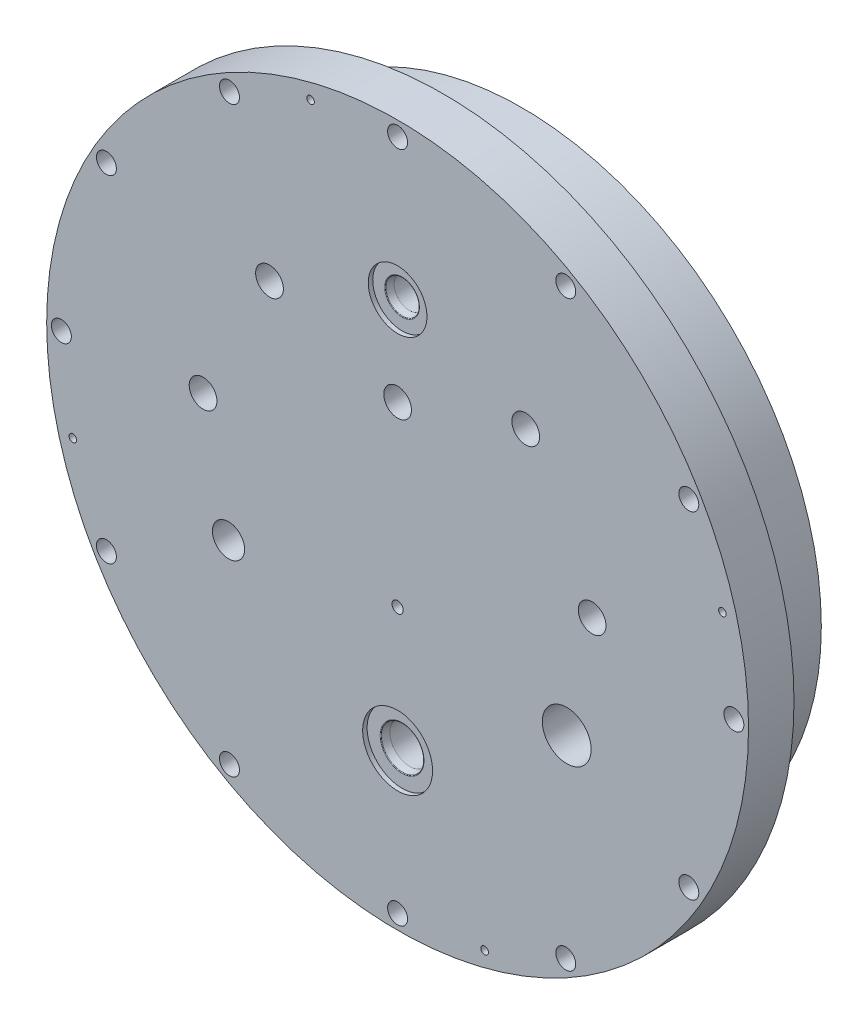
ISO-10303-21;
HEADER;
FILE_DESCRIPTION(('STEP AP214'),'2;1');
FILE_NAME('part.step','',(''),(''),'','','');
FILE_SCHEMA(('AUTOMOTIVE_DESIGN { 1 0 10303 214 1 1 1 1 }'));
ENDSEC;
DATA;
#1=APPLICATION_CONTEXT('core data for automotive mechanical design processes');
#2=APPLICATION_PROTOCOL_DEFINITION('international standard','automotive_design',2000,#1);
#3=PRODUCT_CONTEXT('',#1,'mechanical');
#4=PRODUCT('Part','Part','',(#3));
#5=PRODUCT_RELATED_PRODUCT_CATEGORY('part','',(#4));
#6=PRODUCT_DEFINITION_FORMATION('','',#4);
#7=PRODUCT_DEFINITION_CONTEXT('part definition',#1,'design');
#8=PRODUCT_DEFINITION('design','',#6,#7);
#9=PRODUCT_DEFINITION_SHAPE('','',#8);
#10=(LENGTH_UNIT() NAMED_UNIT(*) SI_UNIT(.MILLI.,.METRE.));
#11=(NAMED_UNIT(*) PLANE_ANGLE_UNIT() SI_UNIT($,.RADIAN.));
#12=(NAMED_UNIT(*) SI_UNIT($,.STERADIAN.) SOLID_ANGLE_UNIT());
#13=UNCERTAINTY_MEASURE_WITH_UNIT(LENGTH_MEASURE(1.E-05),#10,'distance_accuracy_value','');
#14=(GEOMETRIC_REPRESENTATION_CONTEXT(3) GLOBAL_UNCERTAINTY_ASSIGNED_CONTEXT((#13)) GLOBAL_UNIT_ASSIGNED_CONTEXT((#10,
#11,#12)) REPRESENTATION_CONTEXT('',''));
#15=CARTESIAN_POINT('',(0.,0.,0.));
#16=DIRECTION('',(0.,0.,1.));
#17=DIRECTION('',(1.,0.,0.));
#18=AXIS2_PLACEMENT_3D('',#15,#16,#17);
#19=CARTESIAN_POINT('',(0.,-25.4,4.2164));
#20=DIRECTION('',(0.,0.,1.));
#21=DIRECTION('',(1.,0.,0.));
#22=AXIS2_PLACEMENT_3D('',#19,#20,#21);
#23=CONICAL_SURFACE('',#22,2.0193,1.02974425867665);
#24=CARTESIAN_POINT('',(0.,-25.4,4.2164));
#25=DIRECTION('',(0.,0.,1.));
#26=DIRECTION('',(1.,0.,0.));
#27=AXIS2_PLACEMENT_3D('',#24,#25,#26);
#28=CIRCLE('',#27,2.0193);
#29=CARTESIAN_POINT('',(2.0193,-25.4,4.2164));
#30=VERTEX_POINT('',#29);
#31=EDGE_CURVE('E1969',#30,#30,#28,.T.);
#32=ORIENTED_EDGE('',*,*,#31,.T.);
#33=EDGE_LOOP('',(#32));
#34=FACE_BOUND('',#33,.T.);
#35=CARTESIAN_POINT('',(0.,-25.4,3.556));
#36=DIRECTION('',(0.,0.,-1.));
#37=DIRECTION('',(-1.,0.,0.));
#38=AXIS2_PLACEMENT_3D('',#35,#36,#37);
#39=CIRCLE('',#38,0.920209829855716);
#40=CARTESIAN_POINT('',(-0.920209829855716,-25.4,3.556));
#41=VERTEX_POINT('',#40);
#42=EDGE_CURVE('E81',#41,#41,#39,.F.);
#43=ORIENTED_EDGE('',*,*,#42,.F.);
#44=EDGE_LOOP('',(#43));
#45=FACE_BOUND('',#44,.T.);
#46=ADVANCED_FACE('F72',(#34,#45),#23,.F.);
#47=CARTESIAN_POINT('',(0.,0.,0.));
#48=DIRECTION('',(0.,0.,1.));
#49=DIRECTION('',(1.,0.,0.));
#50=AXIS2_PLACEMENT_3D('',#47,#48,#49);
#51=CYLINDRICAL_SURFACE('',#50,125.5395);
#52=CARTESIAN_POINT('',(0.,0.,1.11022302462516E-13));
#53=DIRECTION('',(0.,0.,1.));
#54=DIRECTION('',(1.,0.,0.));
#55=AXIS2_PLACEMENT_3D('',#52,#53,#54);
#56=CIRCLE('',#55,125.5395);
#57=CARTESIAN_POINT('',(125.5395,0.,1.11022302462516E-13));
#58=VERTEX_POINT('',#57);
#59=EDGE_CURVE('E403',#58,#58,#56,.T.);
#60=ORIENTED_EDGE('',*,*,#59,.T.);
#61=EDGE_LOOP('',(#60));
#62=FACE_BOUND('',#61,.T.);
#63=CARTESIAN_POINT('',(0.,0.,16.256));
#64=DIRECTION('',(0.,0.,1.));
#65=DIRECTION('',(1.,0.,0.));
#66=AXIS2_PLACEMENT_3D('',#63,#64,#65);
#67=CIRCLE('',#66,125.5395);
#68=CARTESIAN_POINT('',(125.5395,0.,16.256));
#69=VERTEX_POINT('',#68);
#70=EDGE_CURVE('E397',#69,#69,#67,.T.);
#71=ORIENTED_EDGE('',*,*,#70,.F.);
#72=EDGE_LOOP('',(#71));
#73=FACE_BOUND('',#72,.T.);
#74=ADVANCED_FACE('F647',(#62,#73),#51,.T.);
#75=CARTESIAN_POINT('',(125.5395,0.,0.));
#76=DIRECTION('',(0.,0.,-1.));
#77=DIRECTION('',(-1.,0.,0.));
#78=AXIS2_PLACEMENT_3D('',#75,#76,#77);
#79=PLANE('',#78);
#80=CARTESIAN_POINT('',(31.1311947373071,-116.183200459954,0.));
#81=DIRECTION('',(0.,0.,-1.));
#82=DIRECTION('',(-1.,0.,0.));
#83=AXIS2_PLACEMENT_3D('',#80,#81,#82);
#84=CIRCLE('',#83,1.35254999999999);
#85=CARTESIAN_POINT('',(29.7786447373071,-116.183200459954,0.));
#86=VERTEX_POINT('',#85);
#87=EDGE_CURVE('E269',#86,#86,#84,.T.);
#88=ORIENTED_EDGE('',*,*,#87,.F.);
#89=EDGE_LOOP('',(#88));
#90=FACE_BOUND('',#89,.T.);
#91=CARTESIAN_POINT('',(116.183200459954,31.1311947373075,0.));
#92=DIRECTION('',(0.,0.,-1.));
#93=DIRECTION('',(-1.,0.,0.));
#94=AXIS2_PLACEMENT_3D('',#91,#92,#93);
#95=CIRCLE('',#94,1.35254999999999);
#96=CARTESIAN_POINT('',(114.830650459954,31.1311947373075,0.));
#97=VERTEX_POINT('',#96);
#98=EDGE_CURVE('E277',#97,#97,#95,.T.);
#99=ORIENTED_EDGE('',*,*,#98,.F.);
#100=EDGE_LOOP('',(#99));
#101=FACE_BOUND('',#100,.T.);
#102=CARTESIAN_POINT('',(-31.1311947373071,116.183200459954,0.));
#103=DIRECTION('',(0.,0.,-1.));
#104=DIRECTION('',(-1.,0.,0.));
#105=AXIS2_PLACEMENT_3D('',#102,#103,#104);
#106=CIRCLE('',#105,1.35254999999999);
#107=CARTESIAN_POINT('',(-32.4837447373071,116.183200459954,0.));
#108=VERTEX_POINT('',#107);
#109=EDGE_CURVE('E285',#108,#108,#106,.T.);
#110=ORIENTED_EDGE('',*,*,#109,.F.);
#111=EDGE_LOOP('',(#110));
#112=FACE_BOUND('',#111,.T.);
#113=CARTESIAN_POINT('',(-116.183200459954,-31.1311947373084,0.));
#114=DIRECTION('',(0.,0.,-1.));
#115=DIRECTION('',(-1.,0.,0.));
#116=AXIS2_PLACEMENT_3D('',#113,#114,#115);
#117=CIRCLE('',#116,1.35254999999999);
#118=CARTESIAN_POINT('',(-117.535750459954,-31.1311947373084,0.));
#119=VERTEX_POINT('',#118);
#120=EDGE_CURVE('E293',#119,#119,#117,.T.);
#121=ORIENTED_EDGE('',*,*,#120,.F.);
#122=EDGE_LOOP('',(#121));
#123=FACE_BOUND('',#122,.T.);
#124=CARTESIAN_POINT('',(0.,-120.2817,0.));
#125=DIRECTION('',(0.,0.,-1.));
#126=DIRECTION('',(-1.,0.,0.));
#127=AXIS2_PLACEMENT_3D('',#124,#125,#126);
#128=CIRCLE('',#127,3.56869999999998);
#129=CARTESIAN_POINT('',(-3.56869999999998,-120.2817,0.));
#130=VERTEX_POINT('',#129);
#131=EDGE_CURVE('E301',#130,#130,#128,.T.);
#132=ORIENTED_EDGE('',*,*,#131,.F.);
#133=EDGE_LOOP('',(#132));
#134=FACE_BOUND('',#133,.T.);
#135=CARTESIAN_POINT('',(60.14085,-104.167007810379,0.));
#136=DIRECTION('',(0.,0.,-1.));
#137=DIRECTION('',(-1.,0.,0.));
#138=AXIS2_PLACEMENT_3D('',#135,#136,#137);
#139=CIRCLE('',#138,3.56869999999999);
#140=CARTESIAN_POINT('',(56.57215,-104.167007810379,0.));
#141=VERTEX_POINT('',#140);
#142=EDGE_CURVE('E309',#141,#141,#139,.T.);
#143=ORIENTED_EDGE('',*,*,#142,.F.);
#144=EDGE_LOOP('',(#143));
#145=FACE_BOUND('',#144,.T.);
#146=CARTESIAN_POINT('',(104.167007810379,-60.14085,0.));
#147=DIRECTION('',(0.,0.,-1.));
#148=DIRECTION('',(-1.,0.,0.));
#149=AXIS2_PLACEMENT_3D('',#146,#147,#148);
#150=CIRCLE('',#149,3.56869999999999);
#151=CARTESIAN_POINT('',(100.598307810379,-60.14085,0.));
#152=VERTEX_POINT('',#151);
#153=EDGE_CURVE('E317',#152,#152,#150,.T.);
#154=ORIENTED_EDGE('',*,*,#153,.F.);
#155=EDGE_LOOP('',(#154));
#156=FACE_BOUND('',#155,.T.);
#157=CARTESIAN_POINT('',(120.2817,4.19961310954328E-13,0.));
#158=DIRECTION('',(0.,0.,-1.));
#159=DIRECTION('',(-1.,0.,0.));
#160=AXIS2_PLACEMENT_3D('',#157,#158,#159);
#161=CIRCLE('',#160,3.56869999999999);
#162=CARTESIAN_POINT('',(116.713,4.19961310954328E-13,0.));
#163=VERTEX_POINT('',#162);
#164=EDGE_CURVE('E325',#163,#163,#161,.T.);
#165=ORIENTED_EDGE('',*,*,#164,.F.);
#166=EDGE_LOOP('',(#165));
#167=FACE_BOUND('',#166,.T.);
#168=CARTESIAN_POINT('',(104.167007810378,60.14085,0.));
#169=DIRECTION('',(0.,0.,-1.));
#170=DIRECTION('',(-1.,0.,0.));
#171=AXIS2_PLACEMENT_3D('',#168,#169,#170);
#172=CIRCLE('',#171,3.56869999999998);
#173=CARTESIAN_POINT('',(100.598307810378,60.14085,0.));
#174=VERTEX_POINT('',#173);
#175=EDGE_CURVE('E333',#174,#174,#172,.T.);
#176=ORIENTED_EDGE('',*,*,#175,.F.);
#177=EDGE_LOOP('',(#176));
#178=FACE_BOUND('',#177,.T.);
#179=CARTESIAN_POINT('',(60.14085,104.167007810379,0.));
#180=DIRECTION('',(0.,0.,-1.));
#181=DIRECTION('',(-1.,0.,0.));
#182=AXIS2_PLACEMENT_3D('',#179,#180,#181);
#183=CIRCLE('',#182,3.56869999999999);
#184=CARTESIAN_POINT('',(56.57215,104.167007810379,0.));
#185=VERTEX_POINT('',#184);
#186=EDGE_CURVE('E341',#185,#185,#183,.T.);
#187=ORIENTED_EDGE('',*,*,#186,.F.);
#188=EDGE_LOOP('',(#187));
#189=FACE_BOUND('',#188,.T.);
#190=CARTESIAN_POINT('',(0.,120.2817,0.));
#191=DIRECTION('',(0.,0.,-1.));
#192=DIRECTION('',(-1.,0.,0.));
#193=AXIS2_PLACEMENT_3D('',#190,#191,#192);
#194=CIRCLE('',#193,3.56869999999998);
#195=CARTESIAN_POINT('',(-3.56869999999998,120.2817,0.));
#196=VERTEX_POINT('',#195);
#197=EDGE_CURVE('E349',#196,#196,#194,.T.);
#198=ORIENTED_EDGE('',*,*,#197,.F.);
#199=EDGE_LOOP('',(#198));
#200=FACE_BOUND('',#199,.T.);
#201=CARTESIAN_POINT('',(-60.1408500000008,104.167007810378,0.));
#202=DIRECTION('',(0.,0.,-1.));
#203=DIRECTION('',(-1.,0.,0.));
#204=AXIS2_PLACEMENT_3D('',#201,#202,#203);
#205=CIRCLE('',#204,3.56869999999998);
#206=CARTESIAN_POINT('',(-63.7095500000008,104.167007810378,0.));
#207=VERTEX_POINT('',#206);
#208=EDGE_CURVE('E357',#207,#207,#205,.T.);
#209=ORIENTED_EDGE('',*,*,#208,.F.);
#210=EDGE_LOOP('',(#209));
#211=FACE_BOUND('',#210,.T.);
#212=CARTESIAN_POINT('',(-104.167007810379,60.140849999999,0.));
#213=DIRECTION('',(0.,0.,-1.));
#214=DIRECTION('',(-1.,0.,0.));
#215=AXIS2_PLACEMENT_3D('',#212,#213,#214);
#216=CIRCLE('',#215,3.56869999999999);
#217=CARTESIAN_POINT('',(-107.735707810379,60.140849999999,0.));
#218=VERTEX_POINT('',#217);
#219=EDGE_CURVE('E365',#218,#218,#216,.T.);
#220=ORIENTED_EDGE('',*,*,#219,.F.);
#221=EDGE_LOOP('',(#220));
#222=FACE_BOUND('',#221,.T.);
#223=CARTESIAN_POINT('',(-120.2817,-1.25988393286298E-12,0.));
#224=DIRECTION('',(0.,0.,-1.));
#225=DIRECTION('',(-1.,0.,0.));
#226=AXIS2_PLACEMENT_3D('',#223,#224,#225);
#227=CIRCLE('',#226,3.56869999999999);
#228=CARTESIAN_POINT('',(-123.8504,-1.25988393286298E-12,0.));
#229=VERTEX_POINT('',#228);
#230=EDGE_CURVE('E373',#229,#229,#227,.T.);
#231=ORIENTED_EDGE('',*,*,#230,.F.);
#232=EDGE_LOOP('',(#231));
#233=FACE_BOUND('',#232,.T.);
#234=CARTESIAN_POINT('',(-104.167007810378,-60.1408500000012,0.));
#235=DIRECTION('',(0.,0.,-1.));
#236=DIRECTION('',(-1.,0.,0.));
#237=AXIS2_PLACEMENT_3D('',#234,#235,#236);
#238=CIRCLE('',#237,3.56869999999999);
#239=CARTESIAN_POINT('',(-107.735707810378,-60.1408500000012,0.));
#240=VERTEX_POINT('',#239);
#241=EDGE_CURVE('E381',#240,#240,#238,.T.);
#242=ORIENTED_EDGE('',*,*,#241,.F.);
#243=EDGE_LOOP('',(#242));
#244=FACE_BOUND('',#243,.T.);
#245=CARTESIAN_POINT('',(-60.1408499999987,-104.167007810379,0.));
#246=DIRECTION('',(0.,0.,-1.));
#247=DIRECTION('',(-1.,0.,0.));
#248=AXIS2_PLACEMENT_3D('',#245,#246,#247);
#249=CIRCLE('',#248,3.56869999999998);
#250=CARTESIAN_POINT('',(-63.7095499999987,-104.167007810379,0.));
#251=VERTEX_POINT('',#250);
#252=EDGE_CURVE('E389',#251,#251,#249,.T.);
#253=ORIENTED_EDGE('',*,*,#252,.F.);
#254=EDGE_LOOP('',(#253));
#255=FACE_BOUND('',#254,.T.);
#256=CARTESIAN_POINT('',(0.,0.,0.));
#257=DIRECTION('',(0.,0.,-1.));
#258=DIRECTION('',(-1.,0.,0.));
#259=AXIS2_PLACEMENT_3D('',#256,#257,#258);
#260=CIRCLE('',#259,107.1245);
#261=CARTESIAN_POINT('',(-107.1245,0.,0.));
#262=VERTEX_POINT('',#261);
#263=EDGE_CURVE('E398',#262,#262,#260,.T.);
#264=ORIENTED_EDGE('',*,*,#263,.F.);
#265=EDGE_LOOP('',(#264));
#266=FACE_BOUND('',#265,.T.);
#267=ORIENTED_EDGE('',*,*,#59,.F.);
#268=EDGE_LOOP('',(#267));
#269=FACE_BOUND('',#268,.T.);
#270=ADVANCED_FACE('F655',(#90,#101,#112,#123,#134,#145,#156,#167,#178,#189,#200,#211,#222,#233,
#244,#255,#266,#269),#79,.T.);
#271=CARTESIAN_POINT('',(0.,0.,16.256));
#272=DIRECTION('',(0.,0.,1.));
#273=DIRECTION('',(1.,0.,0.));
#274=AXIS2_PLACEMENT_3D('',#271,#272,#273);
#275=PLANE('',#274);
#276=CARTESIAN_POINT('',(60.4918744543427,-34.9250000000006,16.256));
#277=DIRECTION('',(0.,0.,1.));
#278=DIRECTION('',(1.,0.,0.));
#279=AXIS2_PLACEMENT_3D('',#276,#277,#278);
#280=CIRCLE('',#279,8.73124999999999);
#281=CARTESIAN_POINT('',(69.2231244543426,-34.9250000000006,16.256));
#282=VERTEX_POINT('',#281);
#283=EDGE_CURVE('E1902',#282,#282,#280,.T.);
#284=ORIENTED_EDGE('',*,*,#283,.F.);
#285=EDGE_LOOP('',(#284));
#286=FACE_BOUND('',#285,.T.);
#287=CARTESIAN_POINT('',(-60.4918744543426,-34.9250000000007,16.256));
#288=DIRECTION('',(0.,0.,1.));
#289=DIRECTION('',(1.,0.,0.));
#290=AXIS2_PLACEMENT_3D('',#287,#288,#289);
#291=CIRCLE('',#290,5.75436999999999);
#292=CARTESIAN_POINT('',(-54.7375044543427,-34.9250000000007,16.256));
#293=VERTEX_POINT('',#292);
#294=EDGE_CURVE('E1932',#293,#293,#291,.T.);
#295=ORIENTED_EDGE('',*,*,#294,.F.);
#296=EDGE_LOOP('',(#295));
#297=FACE_BOUND('',#296,.T.);
#298=CARTESIAN_POINT('',(0.,-25.4,16.256));
#299=DIRECTION('',(0.,0.,1.));
#300=DIRECTION('',(1.,0.,0.));
#301=AXIS2_PLACEMENT_3D('',#298,#299,#300);
#302=CIRCLE('',#301,2.01929999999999);
#303=CARTESIAN_POINT('',(2.01929999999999,-25.4,16.256));
#304=VERTEX_POINT('',#303);
#305=EDGE_CURVE('E1965',#304,#304,#302,.T.);
#306=ORIENTED_EDGE('',*,*,#305,.F.);
#307=EDGE_LOOP('',(#306));
#308=FACE_BOUND('',#307,.T.);
#309=CARTESIAN_POINT('',(0.,69.85,16.256));
#310=DIRECTION('',(0.,0.,1.));
#311=DIRECTION('',(0.,-1.,0.));
#312=AXIS2_PLACEMENT_3D('',#309,#310,#311);
#313=CIRCLE('',#312,10.5);
#314=CARTESIAN_POINT('',(0.,59.35,16.256));
#315=VERTEX_POINT('',#314);
#316=EDGE_CURVE('E1999',#315,#315,#313,.T.);
#317=ORIENTED_EDGE('',*,*,#316,.F.);
#318=EDGE_LOOP('',(#317));
#319=FACE_BOUND('',#318,.T.);
#320=CARTESIAN_POINT('',(-69.5841996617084,6.08782863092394,16.256));
#321=DIRECTION('',(0.,0.,1.));
#322=DIRECTION('',(1.,0.,0.));
#323=AXIS2_PLACEMENT_3D('',#320,#321,#322);
#324=CIRCLE('',#323,4.96062);
#325=CARTESIAN_POINT('',(-64.6235796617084,6.08782863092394,16.256));
#326=VERTEX_POINT('',#325);
#327=EDGE_CURVE('E2003',#326,#326,#324,.T.);
#328=ORIENTED_EDGE('',*,*,#327,.F.);
#329=EDGE_LOOP('',(#328));
#330=FACE_BOUND('',#329,.T.);
#331=CARTESIAN_POINT('',(69.5841996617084,6.08782863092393,16.256));
#332=DIRECTION('',(0.,0.,1.));
#333=DIRECTION('',(1.,0.,0.));
#334=AXIS2_PLACEMENT_3D('',#331,#332,#333);
#335=CIRCLE('',#334,4.96062);
#336=CARTESIAN_POINT('',(74.5448196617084,6.08782863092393,16.256));
#337=VERTEX_POINT('',#336);
#338=EDGE_CURVE('E2007',#337,#337,#335,.T.);
#339=ORIENTED_EDGE('',*,*,#338,.F.);
#340=EDGE_LOOP('',(#339));
#341=FACE_BOUND('',#340,.T.);
#342=CARTESIAN_POINT('',(45.8257231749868,52.7164641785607,16.256));
#343=DIRECTION('',(0.,0.,1.));
#344=DIRECTION('',(1.,0.,0.));
#345=AXIS2_PLACEMENT_3D('',#342,#343,#344);
#346=CIRCLE('',#345,4.96061999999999);
#347=CARTESIAN_POINT('',(50.7863431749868,52.7164641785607,16.256));
#348=VERTEX_POINT('',#347);
#349=EDGE_CURVE('E2011',#348,#348,#346,.T.);
#350=ORIENTED_EDGE('',*,*,#349,.F.);
#351=EDGE_LOOP('',(#350));
#352=FACE_BOUND('',#351,.T.);
#353=CARTESIAN_POINT('',(-45.8257231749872,52.7164641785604,16.256));
#354=DIRECTION('',(0.,0.,1.));
#355=DIRECTION('',(1.,0.,0.));
#356=AXIS2_PLACEMENT_3D('',#353,#354,#355);
#357=CIRCLE('',#356,4.96061999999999);
#358=CARTESIAN_POINT('',(-40.8651031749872,52.7164641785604,16.256));
#359=VERTEX_POINT('',#358);
#360=EDGE_CURVE('E2015',#359,#359,#357,.T.);
#361=ORIENTED_EDGE('',*,*,#360,.F.);
#362=EDGE_LOOP('',(#361));
#363=FACE_BOUND('',#362,.T.);
#364=CARTESIAN_POINT('',(0.,38.1,16.256));
#365=DIRECTION('',(0.,0.,1.));
#366=DIRECTION('',(1.,0.,0.));
#367=AXIS2_PLACEMENT_3D('',#364,#365,#366);
#368=CIRCLE('',#367,4.96061999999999);
#369=CARTESIAN_POINT('',(4.96061999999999,38.1,16.256));
#370=VERTEX_POINT('',#369);
#371=EDGE_CURVE('E2019',#370,#370,#368,.T.);
#372=ORIENTED_EDGE('',*,*,#371,.F.);
#373=EDGE_LOOP('',(#372));
#374=FACE_BOUND('',#373,.T.);
#375=CARTESIAN_POINT('',(0.,-69.85,16.256));
#376=DIRECTION('',(0.,0.,1.));
#377=DIRECTION('',(1.,0.,0.));
#378=AXIS2_PLACEMENT_3D('',#375,#376,#377);
#379=CIRCLE('',#378,12.5);
#380=CARTESIAN_POINT('',(12.5,-69.85,16.256));
#381=VERTEX_POINT('',#380);
#382=EDGE_CURVE('E2023',#381,#381,#379,.T.);
#383=ORIENTED_EDGE('',*,*,#382,.F.);
#384=EDGE_LOOP('',(#383));
#385=FACE_BOUND('',#384,.T.);
#386=CARTESIAN_POINT('',(31.1311947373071,-116.183200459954,16.256));
#387=DIRECTION('',(0.,0.,1.));
#388=DIRECTION('',(1.,0.,0.));
#389=AXIS2_PLACEMENT_3D('',#386,#387,#388);
#390=CIRCLE('',#389,1.35254999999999);
#391=CARTESIAN_POINT('',(32.4837447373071,-116.183200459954,16.256));
#392=VERTEX_POINT('',#391);
#393=EDGE_CURVE('E265',#392,#392,#390,.T.);
#394=ORIENTED_EDGE('',*,*,#393,.F.);
#395=EDGE_LOOP('',(#394));
#396=FACE_BOUND('',#395,.T.);
#397=CARTESIAN_POINT('',(116.183200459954,31.1311947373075,16.256));
#398=DIRECTION('',(0.,0.,1.));
#399=DIRECTION('',(1.,0.,0.));
#400=AXIS2_PLACEMENT_3D('',#397,#398,#399);
#401=CIRCLE('',#400,1.35254999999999);
#402=CARTESIAN_POINT('',(117.535750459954,31.1311947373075,16.256));
#403=VERTEX_POINT('',#402);
#404=EDGE_CURVE('E273',#403,#403,#401,.T.);
#405=ORIENTED_EDGE('',*,*,#404,.F.);
#406=EDGE_LOOP('',(#405));
#407=FACE_BOUND('',#406,.T.);
#408=CARTESIAN_POINT('',(-31.1311947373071,116.183200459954,16.256));
#409=DIRECTION('',(0.,0.,1.));
#410=DIRECTION('',(1.,0.,0.));
#411=AXIS2_PLACEMENT_3D('',#408,#409,#410);
#412=CIRCLE('',#411,1.35254999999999);
#413=CARTESIAN_POINT('',(-29.7786447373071,116.183200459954,16.256));
#414=VERTEX_POINT('',#413);
#415=EDGE_CURVE('E281',#414,#414,#412,.T.);
#416=ORIENTED_EDGE('',*,*,#415,.F.);
#417=EDGE_LOOP('',(#416));
#418=FACE_BOUND('',#417,.T.);
#419=CARTESIAN_POINT('',(-116.183200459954,-31.1311947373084,16.256));
#420=DIRECTION('',(0.,0.,1.));
#421=DIRECTION('',(1.,0.,0.));
#422=AXIS2_PLACEMENT_3D('',#419,#420,#421);
#423=CIRCLE('',#422,1.35254999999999);
#424=CARTESIAN_POINT('',(-114.830650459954,-31.1311947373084,16.256));
#425=VERTEX_POINT('',#424);
#426=EDGE_CURVE('E289',#425,#425,#423,.T.);
#427=ORIENTED_EDGE('',*,*,#426,.F.);
#428=EDGE_LOOP('',(#427));
#429=FACE_BOUND('',#428,.T.);
#430=CARTESIAN_POINT('',(0.,-120.2817,16.256));
#431=DIRECTION('',(0.,0.,1.));
#432=DIRECTION('',(1.,0.,0.));
#433=AXIS2_PLACEMENT_3D('',#430,#431,#432);
#434=CIRCLE('',#433,3.56869999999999);
#435=CARTESIAN_POINT('',(3.56869999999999,-120.2817,16.256));
#436=VERTEX_POINT('',#435);
#437=EDGE_CURVE('E297',#436,#436,#434,.T.);
#438=ORIENTED_EDGE('',*,*,#437,.F.);
#439=EDGE_LOOP('',(#438));
#440=FACE_BOUND('',#439,.T.);
#441=CARTESIAN_POINT('',(60.14085,-104.167007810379,16.256));
#442=DIRECTION('',(0.,0.,1.));
#443=DIRECTION('',(1.,0.,0.));
#444=AXIS2_PLACEMENT_3D('',#441,#442,#443);
#445=CIRCLE('',#444,3.56869999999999);
#446=CARTESIAN_POINT('',(63.70955,-104.167007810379,16.256));
#447=VERTEX_POINT('',#446);
#448=EDGE_CURVE('E305',#447,#447,#445,.T.);
#449=ORIENTED_EDGE('',*,*,#448,.F.);
#450=EDGE_LOOP('',(#449));
#451=FACE_BOUND('',#450,.T.);
#452=CARTESIAN_POINT('',(104.167007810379,-60.14085,16.256));
#453=DIRECTION('',(0.,0.,1.));
#454=DIRECTION('',(1.,0.,0.));
#455=AXIS2_PLACEMENT_3D('',#452,#453,#454);
#456=CIRCLE('',#455,3.56869999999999);
#457=CARTESIAN_POINT('',(107.735707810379,-60.14085,16.256));
#458=VERTEX_POINT('',#457);
#459=EDGE_CURVE('E313',#458,#458,#456,.T.);
#460=ORIENTED_EDGE('',*,*,#459,.F.);
#461=EDGE_LOOP('',(#460));
#462=FACE_BOUND('',#461,.T.);
#463=CARTESIAN_POINT('',(120.2817,4.19961310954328E-13,16.256));
#464=DIRECTION('',(0.,0.,1.));
#465=DIRECTION('',(1.,0.,0.));
#466=AXIS2_PLACEMENT_3D('',#463,#464,#465);
#467=CIRCLE('',#466,3.56869999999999);
#468=CARTESIAN_POINT('',(123.8504,4.19961310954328E-13,16.256));
#469=VERTEX_POINT('',#468);
#470=EDGE_CURVE('E321',#469,#469,#467,.T.);
#471=ORIENTED_EDGE('',*,*,#470,.F.);
#472=EDGE_LOOP('',(#471));
#473=FACE_BOUND('',#472,.T.);
#474=CARTESIAN_POINT('',(104.167007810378,60.14085,16.256));
#475=DIRECTION('',(0.,0.,1.));
#476=DIRECTION('',(1.,0.,0.));
#477=AXIS2_PLACEMENT_3D('',#474,#475,#476);
#478=CIRCLE('',#477,3.56869999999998);
#479=CARTESIAN_POINT('',(107.735707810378,60.14085,16.256));
#480=VERTEX_POINT('',#479);
#481=EDGE_CURVE('E329',#480,#480,#478,.T.);
#482=ORIENTED_EDGE('',*,*,#481,.F.);
#483=EDGE_LOOP('',(#482));
#484=FACE_BOUND('',#483,.T.);
#485=CARTESIAN_POINT('',(60.14085,104.167007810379,16.256));
#486=DIRECTION('',(0.,0.,1.));
#487=DIRECTION('',(1.,0.,0.));
#488=AXIS2_PLACEMENT_3D('',#485,#486,#487);
#489=CIRCLE('',#488,3.56869999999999);
#490=CARTESIAN_POINT('',(63.70955,104.167007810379,16.256));
#491=VERTEX_POINT('',#490);
#492=EDGE_CURVE('E337',#491,#491,#489,.T.);
#493=ORIENTED_EDGE('',*,*,#492,.F.);
#494=EDGE_LOOP('',(#493));
#495=FACE_BOUND('',#494,.T.);
#496=CARTESIAN_POINT('',(0.,120.2817,16.256));
#497=DIRECTION('',(0.,0.,1.));
#498=DIRECTION('',(1.,0.,0.));
#499=AXIS2_PLACEMENT_3D('',#496,#497,#498);
#500=CIRCLE('',#499,3.56869999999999);
#501=CARTESIAN_POINT('',(3.56869999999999,120.2817,16.256));
#502=VERTEX_POINT('',#501);
#503=EDGE_CURVE('E345',#502,#502,#500,.T.);
#504=ORIENTED_EDGE('',*,*,#503,.F.);
#505=EDGE_LOOP('',(#504));
#506=FACE_BOUND('',#505,.T.);
#507=CARTESIAN_POINT('',(-60.1408500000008,104.167007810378,16.256));
#508=DIRECTION('',(0.,0.,1.));
#509=DIRECTION('',(1.,0.,0.));
#510=AXIS2_PLACEMENT_3D('',#507,#508,#509);
#511=CIRCLE('',#510,3.56869999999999);
#512=CARTESIAN_POINT('',(-56.5721500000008,104.167007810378,16.256));
#513=VERTEX_POINT('',#512);
#514=EDGE_CURVE('E353',#513,#513,#511,.T.);
#515=ORIENTED_EDGE('',*,*,#514,.F.);
#516=EDGE_LOOP('',(#515));
#517=FACE_BOUND('',#516,.T.);
#518=CARTESIAN_POINT('',(-104.167007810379,60.140849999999,16.256));
#519=DIRECTION('',(0.,0.,1.));
#520=DIRECTION('',(1.,0.,0.));
#521=AXIS2_PLACEMENT_3D('',#518,#519,#520);
#522=CIRCLE('',#521,3.56869999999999);
#523=CARTESIAN_POINT('',(-100.598307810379,60.140849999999,16.256));
#524=VERTEX_POINT('',#523);
#525=EDGE_CURVE('E361',#524,#524,#522,.T.);
#526=ORIENTED_EDGE('',*,*,#525,.F.);
#527=EDGE_LOOP('',(#526));
#528=FACE_BOUND('',#527,.T.);
#529=CARTESIAN_POINT('',(-120.2817,-1.25988393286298E-12,16.256));
#530=DIRECTION('',(0.,0.,1.));
#531=DIRECTION('',(1.,0.,0.));
#532=AXIS2_PLACEMENT_3D('',#529,#530,#531);
#533=CIRCLE('',#532,3.56869999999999);
#534=CARTESIAN_POINT('',(-116.713,-1.25988393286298E-12,16.256));
#535=VERTEX_POINT('',#534);
#536=EDGE_CURVE('E369',#535,#535,#533,.T.);
#537=ORIENTED_EDGE('',*,*,#536,.F.);
#538=EDGE_LOOP('',(#537));
#539=FACE_BOUND('',#538,.T.);
#540=CARTESIAN_POINT('',(-104.167007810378,-60.1408500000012,16.256));
#541=DIRECTION('',(0.,0.,1.));
#542=DIRECTION('',(1.,0.,0.));
#543=AXIS2_PLACEMENT_3D('',#540,#541,#542);
#544=CIRCLE('',#543,3.56869999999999);
#545=CARTESIAN_POINT('',(-100.598307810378,-60.1408500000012,16.256));
#546=VERTEX_POINT('',#545);
#547=EDGE_CURVE('E377',#546,#546,#544,.T.);
#548=ORIENTED_EDGE('',*,*,#547,.F.);
#549=EDGE_LOOP('',(#548));
#550=FACE_BOUND('',#549,.T.);
#551=CARTESIAN_POINT('',(-60.1408499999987,-104.167007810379,16.256));
#552=DIRECTION('',(0.,0.,1.));
#553=DIRECTION('',(1.,0.,0.));
#554=AXIS2_PLACEMENT_3D('',#551,#552,#553);
#555=CIRCLE('',#554,3.56869999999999);
#556=CARTESIAN_POINT('',(-56.5721499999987,-104.167007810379,16.256));
#557=VERTEX_POINT('',#556);
#558=EDGE_CURVE('E385',#557,#557,#555,.T.);
#559=ORIENTED_EDGE('',*,*,#558,.F.);
#560=EDGE_LOOP('',(#559));
#561=FACE_BOUND('',#560,.T.);
#562=ORIENTED_EDGE('',*,*,#70,.T.);
#563=EDGE_LOOP('',(#562));
#564=FACE_BOUND('',#563,.T.);
#565=ADVANCED_FACE('F1417',(#286,#297,#308,#319,#330,#341,#352,#363,#374,#385,#396,#407,#418,
#429,#440,#451,#462,#473,#484,#495,#506,#517,#528,#539,#550,#561,#564),#275,.T.);
#566=CARTESIAN_POINT('',(0.,0.,-28.194));
#567=DIRECTION('',(0.,0.,1.));
#568=DIRECTION('',(1.,0.,0.));
#569=AXIS2_PLACEMENT_3D('',#566,#567,#568);
#570=CYLINDRICAL_SURFACE('',#569,107.1245);
#571=CARTESIAN_POINT('',(0.,0.,-28.194));
#572=DIRECTION('',(0.,0.,-1.));
#573=DIRECTION('',(-1.,0.,0.));
#574=AXIS2_PLACEMENT_3D('',#571,#572,#573);
#575=CIRCLE('',#574,107.1245);
#576=CARTESIAN_POINT('',(-107.1245,0.,-28.194));
#577=VERTEX_POINT('',#576);
#578=EDGE_CURVE('E393',#577,#577,#575,.T.);
#579=ORIENTED_EDGE('',*,*,#578,.F.);
#580=EDGE_LOOP('',(#579));
#581=FACE_BOUND('',#580,.T.);
#582=ORIENTED_EDGE('',*,*,#263,.T.);
#583=EDGE_LOOP('',(#582));
#584=FACE_BOUND('',#583,.T.);
#585=ADVANCED_FACE('F1083',(#581,#584),#570,.T.);
#586=CARTESIAN_POINT('',(0.,0.,-28.194));
#587=DIRECTION('',(0.,0.,-1.));
#588=DIRECTION('',(-1.,0.,0.));
#589=AXIS2_PLACEMENT_3D('',#586,#587,#588);
#590=PLANE('',#589);
#591=DIRECTION('',(1.,0.,0.));
#592=VECTOR('',#591,1.);
#593=CARTESIAN_POINT('',(68.579088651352,30.48,-28.194));
#594=LINE('',#593,#592);
#595=CARTESIAN_POINT('',(-68.579088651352,30.48,-28.194));
#596=VERTEX_POINT('',#595);
#597=CARTESIAN_POINT('',(68.579088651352,30.48,-28.194));
#598=VERTEX_POINT('',#597);
#599=EDGE_CURVE('E461',#596,#598,#594,.T.);
#600=ORIENTED_EDGE('',*,*,#599,.T.);
#601=CARTESIAN_POINT('',(68.579088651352,44.45,-28.194));
#602=DIRECTION('',(0.,0.,-1.));
#603=DIRECTION('',(-1.,0.,0.));
#604=AXIS2_PLACEMENT_3D('',#601,#602,#603);
#605=CIRCLE('',#604,13.97);
#606=CARTESIAN_POINT('',(80.3020097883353,52.0482905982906,-28.194));
#607=VERTEX_POINT('',#606);
#608=EDGE_CURVE('E470',#598,#607,#605,.F.);
#609=ORIENTED_EDGE('',*,*,#608,.T.);
#610=CARTESIAN_POINT('',(0.,0.,-28.194));
#611=DIRECTION('',(0.,0.,-1.));
#612=DIRECTION('',(-1.,0.,0.));
#613=AXIS2_PLACEMENT_3D('',#610,#611,#612);
#614=CIRCLE('',#613,95.6945);
#615=CARTESIAN_POINT('',(-80.3020097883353,52.0482905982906,-28.194));
#616=VERTEX_POINT('',#615);
#617=EDGE_CURVE('E467',#607,#616,#614,.F.);
#618=ORIENTED_EDGE('',*,*,#617,.T.);
#619=CARTESIAN_POINT('',(-68.579088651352,44.45,-28.194));
#620=DIRECTION('',(0.,0.,-1.));
#621=DIRECTION('',(-1.,0.,0.));
#622=AXIS2_PLACEMENT_3D('',#619,#620,#621);
#623=CIRCLE('',#622,13.97);
#624=EDGE_CURVE('E464',#616,#596,#623,.F.);
#625=ORIENTED_EDGE('',*,*,#624,.T.);
#626=EDGE_LOOP('',(#600,#609,#618,#625));
#627=FACE_BOUND('',#626,.T.);
#628=DIRECTION('',(-1.,0.,0.));
#629=VECTOR('',#628,1.);
#630=CARTESIAN_POINT('',(-81.7245,13.97,-28.194));
#631=LINE('',#630,#629);
#632=CARTESIAN_POINT('',(81.7245,13.97,-28.194));
#633=VERTEX_POINT('',#632);
#634=CARTESIAN_POINT('',(-81.7245,13.97,-28.194));
#635=VERTEX_POINT('',#634);
#636=EDGE_CURVE('E448',#633,#635,#631,.T.);
#637=ORIENTED_EDGE('',*,*,#636,.T.);
#638=CARTESIAN_POINT('',(-81.7245,0.,-28.194));
#639=DIRECTION('',(0.,0.,-1.));
#640=DIRECTION('',(-1.,0.,0.));
#641=AXIS2_PLACEMENT_3D('',#638,#639,#640);
#642=CIRCLE('',#641,13.97);
#643=CARTESIAN_POINT('',(-95.6945,0.,-28.194));
#644=VERTEX_POINT('',#643);
#645=EDGE_CURVE('E457',#635,#644,#642,.F.);
#646=ORIENTED_EDGE('',*,*,#645,.T.);
#647=CARTESIAN_POINT('',(0.,0.,-28.194));
#648=DIRECTION('',(0.,0.,-1.));
#649=DIRECTION('',(-1.,0.,0.));
#650=AXIS2_PLACEMENT_3D('',#647,#648,#649);
#651=CIRCLE('',#650,95.6945);
#652=CARTESIAN_POINT('',(95.6945,0.,-28.194));
#653=VERTEX_POINT('',#652);
#654=EDGE_CURVE('E454',#644,#653,#651,.F.);
#655=ORIENTED_EDGE('',*,*,#654,.T.);
#656=CARTESIAN_POINT('',(81.7245,0.,-28.194));
#657=DIRECTION('',(0.,0.,-1.));
#658=DIRECTION('',(-1.,0.,0.));
#659=AXIS2_PLACEMENT_3D('',#656,#657,#658);
#660=CIRCLE('',#659,13.97);
#661=EDGE_CURVE('E451',#653,#633,#660,.F.);
#662=ORIENTED_EDGE('',*,*,#661,.T.);
#663=EDGE_LOOP('',(#637,#646,#655,#662));
#664=FACE_BOUND('',#663,.T.);
#665=CARTESIAN_POINT('',(0.,19.05,-28.194));
#666=DIRECTION('',(0.,0.,-1.));
#667=DIRECTION('',(-1.,0.,0.));
#668=AXIS2_PLACEMENT_3D('',#665,#666,#667);
#669=CIRCLE('',#668,2.55269999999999);
#670=CARTESIAN_POINT('',(-2.5527,19.05,-28.194));
#671=VERTEX_POINT('',#670);
#672=EDGE_CURVE('E240',#671,#671,#669,.T.);
#673=ORIENTED_EDGE('',*,*,#672,.F.);
#674=EDGE_LOOP('',(#673));
#675=FACE_BOUND('',#674,.T.);
#676=CARTESIAN_POINT('',(-76.2,19.05,-28.194));
#677=DIRECTION('',(0.,0.,-1.));
#678=DIRECTION('',(-1.,0.,0.));
#679=AXIS2_PLACEMENT_3D('',#676,#677,#678);
#680=CIRCLE('',#679,2.55269999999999);
#681=CARTESIAN_POINT('',(-78.7527,19.05,-28.194));
#682=VERTEX_POINT('',#681);
#683=EDGE_CURVE('E239',#682,#682,#680,.T.);
#684=ORIENTED_EDGE('',*,*,#683,.F.);
#685=EDGE_LOOP('',(#684));
#686=FACE_BOUND('',#685,.T.);
#687=CARTESIAN_POINT('',(76.2,19.05,-28.194));
#688=DIRECTION('',(0.,0.,-1.));
#689=DIRECTION('',(-1.,0.,0.));
#690=AXIS2_PLACEMENT_3D('',#687,#688,#689);
#691=CIRCLE('',#690,2.55269999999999);
#692=CARTESIAN_POINT('',(73.6473,19.05,-28.194));
#693=VERTEX_POINT('',#692);
#694=EDGE_CURVE('E257',#693,#693,#691,.T.);
#695=ORIENTED_EDGE('',*,*,#694,.F.);
#696=EDGE_LOOP('',(#695));
#697=FACE_BOUND('',#696,.T.);
#698=ORIENTED_EDGE('',*,*,#578,.T.);
#699=EDGE_LOOP('',(#698));
#700=FACE_BOUND('',#699,.T.);
#701=ADVANCED_FACE('F1078',(#627,#664,#675,#686,#697,#700),#590,.T.);
#702=CARTESIAN_POINT('',(-60.1408499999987,-104.167007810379,16.256));
#703=DIRECTION('',(0.,0.,1.));
#704=DIRECTION('',(1.,0.,0.));
#705=AXIS2_PLACEMENT_3D('',#702,#703,#704);
#706=CYLINDRICAL_SURFACE('',#705,3.56869999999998);
#707=ORIENTED_EDGE('',*,*,#252,.T.);
#708=EDGE_LOOP('',(#707));
#709=FACE_BOUND('',#708,.T.);
#710=ORIENTED_EDGE('',*,*,#558,.T.);
#711=EDGE_LOOP('',(#710));
#712=FACE_BOUND('',#711,.T.);
#713=ADVANCED_FACE('F1082',(#709,#712),#706,.F.);
#714=CARTESIAN_POINT('',(-104.167007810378,-60.1408500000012,16.256));
#715=DIRECTION('',(0.,0.,1.));
#716=DIRECTION('',(1.,0.,0.));
#717=AXIS2_PLACEMENT_3D('',#714,#715,#716);
#718=CYLINDRICAL_SURFACE('',#717,3.56869999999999);
#719=ORIENTED_EDGE('',*,*,#241,.T.);
#720=EDGE_LOOP('',(#719));
#721=FACE_BOUND('',#720,.T.);
#722=ORIENTED_EDGE('',*,*,#547,.T.);
#723=EDGE_LOOP('',(#722));
#724=FACE_BOUND('',#723,.T.);
#725=ADVANCED_FACE('F1508',(#721,#724),#718,.F.);
#726=CARTESIAN_POINT('',(-120.2817,-1.25988393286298E-12,16.256));
#727=DIRECTION('',(0.,0.,1.));
#728=DIRECTION('',(1.,0.,0.));
#729=AXIS2_PLACEMENT_3D('',#726,#727,#728);
#730=CYLINDRICAL_SURFACE('',#729,3.56869999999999);
#731=ORIENTED_EDGE('',*,*,#230,.T.);
#732=EDGE_LOOP('',(#731));
#733=FACE_BOUND('',#732,.T.);
#734=ORIENTED_EDGE('',*,*,#536,.T.);
#735=EDGE_LOOP('',(#734));
#736=FACE_BOUND('',#735,.T.);
#737=ADVANCED_FACE('F1499',(#733,#736),#730,.F.);
#738=CARTESIAN_POINT('',(-104.167007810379,60.140849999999,16.256));
#739=DIRECTION('',(0.,0.,1.));
#740=DIRECTION('',(1.,0.,0.));
#741=AXIS2_PLACEMENT_3D('',#738,#739,#740);
#742=CYLINDRICAL_SURFACE('',#741,3.56869999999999);
#743=ORIENTED_EDGE('',*,*,#219,.T.);
#744=EDGE_LOOP('',(#743));
#745=FACE_BOUND('',#744,.T.);
#746=ORIENTED_EDGE('',*,*,#525,.T.);
#747=EDGE_LOOP('',(#746));
#748=FACE_BOUND('',#747,.T.);
#749=ADVANCED_FACE('F1490',(#745,#748),#742,.F.);
#750=CARTESIAN_POINT('',(-60.1408500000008,104.167007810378,16.256));
#751=DIRECTION('',(0.,0.,1.));
#752=DIRECTION('',(1.,0.,0.));
#753=AXIS2_PLACEMENT_3D('',#750,#751,#752);
#754=CYLINDRICAL_SURFACE('',#753,3.56869999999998);
#755=ORIENTED_EDGE('',*,*,#208,.T.);
#756=EDGE_LOOP('',(#755));
#757=FACE_BOUND('',#756,.T.);
#758=ORIENTED_EDGE('',*,*,#514,.T.);
#759=EDGE_LOOP('',(#758));
#760=FACE_BOUND('',#759,.T.);
#761=ADVANCED_FACE('F1481',(#757,#760),#754,.F.);
#762=CARTESIAN_POINT('',(0.,120.2817,16.256));
#763=DIRECTION('',(0.,0.,1.));
#764=DIRECTION('',(1.,0.,0.));
#765=AXIS2_PLACEMENT_3D('',#762,#763,#764);
#766=CYLINDRICAL_SURFACE('',#765,3.56869999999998);
#767=ORIENTED_EDGE('',*,*,#197,.T.);
#768=EDGE_LOOP('',(#767));
#769=FACE_BOUND('',#768,.T.);
#770=ORIENTED_EDGE('',*,*,#503,.T.);
#771=EDGE_LOOP('',(#770));
#772=FACE_BOUND('',#771,.T.);
#773=ADVANCED_FACE('F1472',(#769,#772),#766,.F.);
#774=CARTESIAN_POINT('',(60.14085,104.167007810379,16.256));
#775=DIRECTION('',(0.,0.,1.));
#776=DIRECTION('',(1.,0.,0.));
#777=AXIS2_PLACEMENT_3D('',#774,#775,#776);
#778=CYLINDRICAL_SURFACE('',#777,3.56869999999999);
#779=ORIENTED_EDGE('',*,*,#186,.T.);
#780=EDGE_LOOP('',(#779));
#781=FACE_BOUND('',#780,.T.);
#782=ORIENTED_EDGE('',*,*,#492,.T.);
#783=EDGE_LOOP('',(#782));
#784=FACE_BOUND('',#783,.T.);
#785=ADVANCED_FACE('F1463',(#781,#784),#778,.F.);
#786=CARTESIAN_POINT('',(104.167007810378,60.14085,16.256));
#787=DIRECTION('',(0.,0.,1.));
#788=DIRECTION('',(1.,0.,0.));
#789=AXIS2_PLACEMENT_3D('',#786,#787,#788);
#790=CYLINDRICAL_SURFACE('',#789,3.56869999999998);
#791=ORIENTED_EDGE('',*,*,#175,.T.);
#792=EDGE_LOOP('',(#791));
#793=FACE_BOUND('',#792,.T.);
#794=ORIENTED_EDGE('',*,*,#481,.T.);
#795=EDGE_LOOP('',(#794));
#796=FACE_BOUND('',#795,.T.);
#797=ADVANCED_FACE('F1454',(#793,#796),#790,.F.);
#798=CARTESIAN_POINT('',(120.2817,4.19961310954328E-13,16.256));
#799=DIRECTION('',(0.,0.,1.));
#800=DIRECTION('',(1.,0.,0.));
#801=AXIS2_PLACEMENT_3D('',#798,#799,#800);
#802=CYLINDRICAL_SURFACE('',#801,3.56869999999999);
#803=ORIENTED_EDGE('',*,*,#164,.T.);
#804=EDGE_LOOP('',(#803));
#805=FACE_BOUND('',#804,.T.);
#806=ORIENTED_EDGE('',*,*,#470,.T.);
#807=EDGE_LOOP('',(#806));
#808=FACE_BOUND('',#807,.T.);
#809=ADVANCED_FACE('F1445',(#805,#808),#802,.F.);
#810=CARTESIAN_POINT('',(104.167007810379,-60.14085,16.256));
#811=DIRECTION('',(0.,0.,1.));
#812=DIRECTION('',(1.,0.,0.));
#813=AXIS2_PLACEMENT_3D('',#810,#811,#812);
#814=CYLINDRICAL_SURFACE('',#813,3.56869999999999);
#815=ORIENTED_EDGE('',*,*,#153,.T.);
#816=EDGE_LOOP('',(#815));
#817=FACE_BOUND('',#816,.T.);
#818=ORIENTED_EDGE('',*,*,#459,.T.);
#819=EDGE_LOOP('',(#818));
#820=FACE_BOUND('',#819,.T.);
#821=ADVANCED_FACE('F1436',(#817,#820),#814,.F.);
#822=CARTESIAN_POINT('',(60.14085,-104.167007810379,16.256));
#823=DIRECTION('',(0.,0.,1.));
#824=DIRECTION('',(1.,0.,0.));
#825=AXIS2_PLACEMENT_3D('',#822,#823,#824);
#826=CYLINDRICAL_SURFACE('',#825,3.56869999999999);
#827=ORIENTED_EDGE('',*,*,#142,.T.);
#828=EDGE_LOOP('',(#827));
#829=FACE_BOUND('',#828,.T.);
#830=ORIENTED_EDGE('',*,*,#448,.T.);
#831=EDGE_LOOP('',(#830));
#832=FACE_BOUND('',#831,.T.);
#833=ADVANCED_FACE('F1427',(#829,#832),#826,.F.);
#834=CARTESIAN_POINT('',(0.,-120.2817,16.256));
#835=DIRECTION('',(0.,0.,1.));
#836=DIRECTION('',(1.,0.,0.));
#837=AXIS2_PLACEMENT_3D('',#834,#835,#836);
#838=CYLINDRICAL_SURFACE('',#837,3.56869999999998);
#839=ORIENTED_EDGE('',*,*,#131,.T.);
#840=EDGE_LOOP('',(#839));
#841=FACE_BOUND('',#840,.T.);
#842=ORIENTED_EDGE('',*,*,#437,.T.);
#843=EDGE_LOOP('',(#842));
#844=FACE_BOUND('',#843,.T.);
#845=ADVANCED_FACE('F1405',(#841,#844),#838,.F.);
#846=CARTESIAN_POINT('',(-116.183200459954,-31.1311947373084,16.256));
#847=DIRECTION('',(0.,0.,1.));
#848=DIRECTION('',(1.,0.,0.));
#849=AXIS2_PLACEMENT_3D('',#846,#847,#848);
#850=CYLINDRICAL_SURFACE('',#849,1.35254999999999);
#851=ORIENTED_EDGE('',*,*,#120,.T.);
#852=EDGE_LOOP('',(#851));
#853=FACE_BOUND('',#852,.T.);
#854=ORIENTED_EDGE('',*,*,#426,.T.);
#855=EDGE_LOOP('',(#854));
#856=FACE_BOUND('',#855,.T.);
#857=ADVANCED_FACE('F1393',(#853,#856),#850,.F.);
#858=CARTESIAN_POINT('',(-31.1311947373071,116.183200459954,16.256));
#859=DIRECTION('',(0.,0.,1.));
#860=DIRECTION('',(1.,0.,0.));
#861=AXIS2_PLACEMENT_3D('',#858,#859,#860);
#862=CYLINDRICAL_SURFACE('',#861,1.35254999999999);
#863=ORIENTED_EDGE('',*,*,#109,.T.);
#864=EDGE_LOOP('',(#863));
#865=FACE_BOUND('',#864,.T.);
#866=ORIENTED_EDGE('',*,*,#415,.T.);
#867=EDGE_LOOP('',(#866));
#868=FACE_BOUND('',#867,.T.);
#869=ADVANCED_FACE('F1380',(#865,#868),#862,.F.);
#870=CARTESIAN_POINT('',(116.183200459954,31.1311947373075,16.256));
#871=DIRECTION('',(0.,0.,1.));
#872=DIRECTION('',(1.,0.,0.));
#873=AXIS2_PLACEMENT_3D('',#870,#871,#872);
#874=CYLINDRICAL_SURFACE('',#873,1.35254999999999);
#875=ORIENTED_EDGE('',*,*,#98,.T.);
#876=EDGE_LOOP('',(#875));
#877=FACE_BOUND('',#876,.T.);
#878=ORIENTED_EDGE('',*,*,#404,.T.);
#879=EDGE_LOOP('',(#878));
#880=FACE_BOUND('',#879,.T.);
#881=ADVANCED_FACE('F1367',(#877,#880),#874,.F.);
#882=CARTESIAN_POINT('',(31.1311947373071,-116.183200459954,16.256));
#883=DIRECTION('',(0.,0.,1.));
#884=DIRECTION('',(1.,0.,0.));
#885=AXIS2_PLACEMENT_3D('',#882,#883,#884);
#886=CYLINDRICAL_SURFACE('',#885,1.35254999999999);
#887=ORIENTED_EDGE('',*,*,#87,.T.);
#888=EDGE_LOOP('',(#887));
#889=FACE_BOUND('',#888,.T.);
#890=ORIENTED_EDGE('',*,*,#393,.T.);
#891=EDGE_LOOP('',(#890));
#892=FACE_BOUND('',#891,.T.);
#893=ADVANCED_FACE('F1356',(#889,#892),#886,.F.);
#894=CARTESIAN_POINT('',(76.2,19.05,2.7686));
#895=DIRECTION('',(0.,0.,-1.));
#896=DIRECTION('',(-1.,0.,0.));
#897=AXIS2_PLACEMENT_3D('',#894,#895,#896);
#898=CONICAL_SURFACE('',#897,2.55269999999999,1.02974425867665);
#899=CARTESIAN_POINT('',(76.2,19.05,4.30241690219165));
#900=VERTEX_POINT('',#899);
#901=VERTEX_LOOP('',#900);
#902=FACE_BOUND('',#901,.T.);
#903=CARTESIAN_POINT('',(76.2,19.05,2.7686));
#904=DIRECTION('',(0.,0.,-1.));
#905=DIRECTION('',(-1.,0.,0.));
#906=AXIS2_PLACEMENT_3D('',#903,#904,#905);
#907=CIRCLE('',#906,2.55269999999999);
#908=CARTESIAN_POINT('',(73.6473,19.05,2.7686));
#909=VERTEX_POINT('',#908);
#910=EDGE_CURVE('E261',#909,#909,#907,.T.);
#911=ORIENTED_EDGE('',*,*,#910,.T.);
#912=EDGE_LOOP('',(#911));
#913=FACE_BOUND('',#912,.T.);
#914=ADVANCED_FACE('F1345',(#902,#913),#898,.F.);
#915=CARTESIAN_POINT('',(76.2,19.05,-28.194));
#916=DIRECTION('',(0.,0.,-1.));
#917=DIRECTION('',(-1.,0.,0.));
#918=AXIS2_PLACEMENT_3D('',#915,#916,#917);
#919=CYLINDRICAL_SURFACE('',#918,2.55269999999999);
#920=ORIENTED_EDGE('',*,*,#910,.F.);
#921=EDGE_LOOP('',(#920));
#922=FACE_BOUND('',#921,.T.);
#923=ORIENTED_EDGE('',*,*,#694,.T.);
#924=EDGE_LOOP('',(#923));
#925=FACE_BOUND('',#924,.T.);
#926=ADVANCED_FACE('F1335',(#922,#925),#919,.F.);
#927=CARTESIAN_POINT('',(-76.2,19.05,2.7686));
#928=DIRECTION('',(0.,0.,-1.));
#929=DIRECTION('',(-1.,0.,0.));
#930=AXIS2_PLACEMENT_3D('',#927,#928,#929);
#931=CONICAL_SURFACE('',#930,2.55269999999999,1.02974425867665);
#932=CARTESIAN_POINT('',(-76.2,19.05,4.30241690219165));
#933=VERTEX_POINT('',#932);
#934=VERTEX_LOOP('',#933);
#935=FACE_BOUND('',#934,.T.);
#936=CARTESIAN_POINT('',(-76.2,19.05,2.7686));
#937=DIRECTION('',(0.,0.,-1.));
#938=DIRECTION('',(-1.,0.,0.));
#939=AXIS2_PLACEMENT_3D('',#936,#937,#938);
#940=CIRCLE('',#939,2.55269999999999);
#941=CARTESIAN_POINT('',(-78.7527,19.05,2.7686));
#942=VERTEX_POINT('',#941);
#943=EDGE_CURVE('E247',#942,#942,#940,.T.);
#944=ORIENTED_EDGE('',*,*,#943,.T.);
#945=EDGE_LOOP('',(#944));
#946=FACE_BOUND('',#945,.T.);
#947=ADVANCED_FACE('F1324',(#935,#946),#931,.F.);
#948=CARTESIAN_POINT('',(-76.2,19.05,-28.194));
#949=DIRECTION('',(0.,0.,-1.));
#950=DIRECTION('',(-1.,0.,0.));
#951=AXIS2_PLACEMENT_3D('',#948,#949,#950);
#952=CYLINDRICAL_SURFACE('',#951,2.55269999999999);
#953=ORIENTED_EDGE('',*,*,#943,.F.);
#954=EDGE_LOOP('',(#953));
#955=FACE_BOUND('',#954,.T.);
#956=ORIENTED_EDGE('',*,*,#683,.T.);
#957=EDGE_LOOP('',(#956));
#958=FACE_BOUND('',#957,.T.);
#959=ADVANCED_FACE('F232',(#955,#958),#952,.F.);
#960=CARTESIAN_POINT('',(0.,19.05,2.7686));
#961=DIRECTION('',(0.,0.,-1.));
#962=DIRECTION('',(-1.,0.,0.));
#963=AXIS2_PLACEMENT_3D('',#960,#961,#962);
#964=CONICAL_SURFACE('',#963,2.55269999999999,1.02974425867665);
#965=CARTESIAN_POINT('',(0.,19.05,4.30241690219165));
#966=VERTEX_POINT('',#965);
#967=VERTEX_LOOP('',#966);
#968=FACE_BOUND('',#967,.T.);
#969=CARTESIAN_POINT('',(0.,19.05,2.7686));
#970=DIRECTION('',(0.,0.,-1.));
#971=DIRECTION('',(-1.,0.,0.));
#972=AXIS2_PLACEMENT_3D('',#969,#970,#971);
#973=CIRCLE('',#972,2.55269999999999);
#974=CARTESIAN_POINT('',(-2.5527,19.05,2.7686));
#975=VERTEX_POINT('',#974);
#976=EDGE_CURVE('E236',#975,#975,#973,.T.);
#977=ORIENTED_EDGE('',*,*,#976,.T.);
#978=EDGE_LOOP('',(#977));
#979=FACE_BOUND('',#978,.T.);
#980=ADVANCED_FACE('F228',(#968,#979),#964,.F.);
#981=CARTESIAN_POINT('',(0.,19.05,-28.194));
#982=DIRECTION('',(0.,0.,-1.));
#983=DIRECTION('',(-1.,0.,0.));
#984=AXIS2_PLACEMENT_3D('',#981,#982,#983);
#985=CYLINDRICAL_SURFACE('',#984,2.55269999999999);
#986=ORIENTED_EDGE('',*,*,#976,.F.);
#987=EDGE_LOOP('',(#986));
#988=FACE_BOUND('',#987,.T.);
#989=ORIENTED_EDGE('',*,*,#672,.T.);
#990=EDGE_LOOP('',(#989));
#991=FACE_BOUND('',#990,.T.);
#992=ADVANCED_FACE('F231',(#988,#991),#985,.F.);
#993=CARTESIAN_POINT('',(-60.4918744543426,-34.9250000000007,0.457199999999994));
#994=DIRECTION('',(0.,0.,-1.));
#995=DIRECTION('',(-1.,0.,0.));
#996=AXIS2_PLACEMENT_3D('',#993,#994,#995);
#997=CONICAL_SURFACE('',#996,6.54811999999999,1.02974425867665);
#998=CARTESIAN_POINT('',(-60.4918744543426,-34.9250000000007,0.934133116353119));
#999=DIRECTION('',(0.,0.,-1.));
#1000=DIRECTION('',(-1.,0.,0.));
#1001=AXIS2_PLACEMENT_3D('',#998,#999,#1000);
#1002=CIRCLE('',#1001,5.75436999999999);
#1003=CARTESIAN_POINT('',(-66.2462444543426,-34.9250000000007,0.934133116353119));
#1004=VERTEX_POINT('',#1003);
#1005=EDGE_CURVE('E632',#1004,#1004,#1002,.F.);
#1006=ORIENTED_EDGE('',*,*,#1005,.T.);
#1007=EDGE_LOOP('',(#1006));
#1008=FACE_BOUND('',#1007,.T.);
#1009=CARTESIAN_POINT('',(-60.4918744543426,-34.9250000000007,0.457199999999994));
#1010=DIRECTION('',(0.,0.,-1.));
#1011=DIRECTION('',(-1.,0.,0.));
#1012=AXIS2_PLACEMENT_3D('',#1009,#1010,#1011);
#1013=CIRCLE('',#1012,6.54811999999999);
#1014=CARTESIAN_POINT('',(-67.0399944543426,-34.9250000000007,0.457199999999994));
#1015=VERTEX_POINT('',#1014);
#1016=EDGE_CURVE('E251',#1015,#1015,#1013,.T.);
#1017=ORIENTED_EDGE('',*,*,#1016,.T.);
#1018=EDGE_LOOP('',(#1017));
#1019=FACE_BOUND('',#1018,.T.);
#1020=ADVANCED_FACE('F1129',(#1008,#1019),#997,.F.);
#1021=CARTESIAN_POINT('',(-60.4918744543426,-34.9250000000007,-28.194));
#1022=DIRECTION('',(0.,0.,-1.));
#1023=DIRECTION('',(-1.,0.,0.));
#1024=AXIS2_PLACEMENT_3D('',#1021,#1022,#1023);
#1025=CYLINDRICAL_SURFACE('',#1024,6.54811999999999);
#1026=CARTESIAN_POINT('',(-60.4918744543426,-34.9250000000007,-2.794));
#1027=DIRECTION('',(0.,0.,1.));
#1028=DIRECTION('',(1.,0.,0.));
#1029=AXIS2_PLACEMENT_3D('',#1026,#1027,#1028);
#1030=CIRCLE('',#1029,6.54811999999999);
#1031=CARTESIAN_POINT('',(-53.9437544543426,-34.9250000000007,-2.794));
#1032=VERTEX_POINT('',#1031);
#1033=EDGE_CURVE('E1961',#1032,#1032,#1030,.F.);
#1034=ORIENTED_EDGE('',*,*,#1033,.T.);
#1035=EDGE_LOOP('',(#1034));
#1036=FACE_BOUND('',#1035,.T.);
#1037=ORIENTED_EDGE('',*,*,#1016,.F.);
#1038=EDGE_LOOP('',(#1037));
#1039=FACE_BOUND('',#1038,.T.);
#1040=ADVANCED_FACE('F1118',(#1036,#1039),#1025,.F.);
#1041=CARTESIAN_POINT('',(0.,-69.85,16.256));
#1042=DIRECTION('',(0.,0.,1.));
#1043=DIRECTION('',(1.,0.,0.));
#1044=AXIS2_PLACEMENT_3D('',#1041,#1042,#1043);
#1045=CYLINDRICAL_SURFACE('',#1044,6.54811999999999);
#1046=CARTESIAN_POINT('',(0.,-69.85,-2.794));
#1047=DIRECTION('',(0.,0.,1.));
#1048=DIRECTION('',(1.,0.,0.));
#1049=AXIS2_PLACEMENT_3D('',#1046,#1047,#1048);
#1050=CIRCLE('',#1049,6.54811999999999);
#1051=CARTESIAN_POINT('',(6.54811999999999,-69.85,-2.794));
#1052=VERTEX_POINT('',#1051);
#1053=EDGE_CURVE('E1957',#1052,#1052,#1050,.F.);
#1054=ORIENTED_EDGE('',*,*,#1053,.T.);
#1055=EDGE_LOOP('',(#1054));
#1056=FACE_BOUND('',#1055,.T.);
#1057=CARTESIAN_POINT('',(0.,-69.85,1.956));
#1058=DIRECTION('',(0.,0.,1.));
#1059=DIRECTION('',(1.,0.,0.));
#1060=AXIS2_PLACEMENT_3D('',#1057,#1058,#1059);
#1061=CIRCLE('',#1060,6.54812);
#1062=CARTESIAN_POINT('',(6.54812,-69.85,1.956));
#1063=VERTEX_POINT('',#1062);
#1064=EDGE_CURVE('E2051',#1063,#1063,#1061,.T.);
#1065=ORIENTED_EDGE('',*,*,#1064,.T.);
#1066=EDGE_LOOP('',(#1065));
#1067=FACE_BOUND('',#1066,.T.);
#1068=ADVANCED_FACE('F1113',(#1056,#1067),#1045,.F.);
#1069=CARTESIAN_POINT('',(6.42571256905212,-68.5898041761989,1.956));
#1070=DIRECTION('',(0.,0.,-1.));
#1071=DIRECTION('',(-1.,0.,0.));
#1072=AXIS2_PLACEMENT_3D('',#1069,#1070,#1071);
#1073=PLANE('',#1072);
#1074=ORIENTED_EDGE('',*,*,#1064,.F.);
#1075=EDGE_LOOP('',(#1074));
#1076=FACE_BOUND('',#1075,.T.);
#1077=CARTESIAN_POINT('',(0.,-69.85,1.956));
#1078=DIRECTION('',(0.,0.,1.));
#1079=DIRECTION('',(1.,0.,0.));
#1080=AXIS2_PLACEMENT_3D('',#1077,#1078,#1079);
#1081=CIRCLE('',#1080,7.14375);
#1082=CARTESIAN_POINT('',(7.14375,-69.85,1.956));
#1083=VERTEX_POINT('',#1082);
#1084=EDGE_CURVE('E2047',#1083,#1083,#1081,.T.);
#1085=ORIENTED_EDGE('',*,*,#1084,.T.);
#1086=EDGE_LOOP('',(#1085));
#1087=FACE_BOUND('',#1086,.T.);
#1088=ADVANCED_FACE('F1117',(#1076,#1087),#1073,.F.);
#1089=CARTESIAN_POINT('',(0.,-69.85,16.256));
#1090=DIRECTION('',(0.,0.,1.));
#1091=DIRECTION('',(1.,0.,0.));
#1092=AXIS2_PLACEMENT_3D('',#1089,#1090,#1091);
#1093=CYLINDRICAL_SURFACE('',#1092,7.14375);
#1094=ORIENTED_EDGE('',*,*,#1084,.F.);
#1095=EDGE_LOOP('',(#1094));
#1096=FACE_BOUND('',#1095,.T.);
#1097=CARTESIAN_POINT('',(0.,-69.85,12.0293378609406));
#1098=DIRECTION('',(0.,0.,1.));
#1099=DIRECTION('',(1.,0.,0.));
#1100=AXIS2_PLACEMENT_3D('',#1097,#1098,#1099);
#1101=CIRCLE('',#1100,7.14375);
#1102=CARTESIAN_POINT('',(7.14375,-69.85,12.0293378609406));
#1103=VERTEX_POINT('',#1102);
#1104=EDGE_CURVE('E2043',#1103,#1103,#1101,.T.);
#1105=ORIENTED_EDGE('',*,*,#1104,.T.);
#1106=EDGE_LOOP('',(#1105));
#1107=FACE_BOUND('',#1106,.T.);
#1108=ADVANCED_FACE('F1269',(#1096,#1107),#1093,.F.);
#1109=CARTESIAN_POINT('',(0.,-69.85,11.956));
#1110=DIRECTION('',(0.,0.,1.));
#1111=DIRECTION('',(1.,0.,0.));
#1112=AXIS2_PLACEMENT_3D('',#1109,#1110,#1111);
#1113=CONICAL_SURFACE('',#1112,7.07041213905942,0.785398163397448);
#1114=ORIENTED_EDGE('',*,*,#1104,.F.);
#1115=EDGE_LOOP('',(#1114));
#1116=FACE_BOUND('',#1115,.T.);
#1117=CARTESIAN_POINT('',(0.,-69.85,11.956));
#1118=DIRECTION('',(0.,0.,1.));
#1119=DIRECTION('',(1.,0.,0.));
#1120=AXIS2_PLACEMENT_3D('',#1117,#1118,#1119);
#1121=CIRCLE('',#1120,7.07041213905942);
#1122=CARTESIAN_POINT('',(7.07041213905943,-69.85,11.956));
#1123=VERTEX_POINT('',#1122);
#1124=EDGE_CURVE('E2039',#1123,#1123,#1121,.T.);
#1125=ORIENTED_EDGE('',*,*,#1124,.T.);
#1126=EDGE_LOOP('',(#1125));
#1127=FACE_BOUND('',#1126,.T.);
#1128=ADVANCED_FACE('F1256',(#1116,#1127),#1113,.T.);
#1129=CARTESIAN_POINT('',(0.,-69.85,14.4548095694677));
#1130=DIRECTION('',(0.,0.,1.));
#1131=DIRECTION('',(1.,0.,0.));
#1132=AXIS2_PLACEMENT_3D('',#1129,#1130,#1131);
#1133=CONICAL_SURFACE('',#1132,7.60155050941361,0.209439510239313);
#1134=ORIENTED_EDGE('',*,*,#1124,.F.);
#1135=EDGE_LOOP('',(#1134));
#1136=FACE_BOUND('',#1135,.T.);
#1137=CARTESIAN_POINT('',(0.,-69.85,14.4548095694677));
#1138=DIRECTION('',(0.,0.,1.));
#1139=DIRECTION('',(1.,0.,0.));
#1140=AXIS2_PLACEMENT_3D('',#1137,#1138,#1139);
#1141=CIRCLE('',#1140,7.60155050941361);
#1142=CARTESIAN_POINT('',(7.60155050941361,-69.85,14.4548095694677));
#1143=VERTEX_POINT('',#1142);
#1144=EDGE_CURVE('E2035',#1143,#1143,#1141,.T.);
#1145=ORIENTED_EDGE('',*,*,#1144,.T.);
#1146=EDGE_LOOP('',(#1145));
#1147=FACE_BOUND('',#1146,.T.);
#1148=ADVANCED_FACE('F1243',(#1136,#1147),#1133,.F.);
#1149=CARTESIAN_POINT('',(0.,-69.85,14.402));
#1150=DIRECTION('',(0.,0.,1.));
#1151=DIRECTION('',(1.,0.,0.));
#1152=AXIS2_PLACEMENT_3D('',#1149,#1150,#1151);
#1153=TOROIDAL_SURFACE('',#1152,7.85,0.254000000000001);
#1154=ORIENTED_EDGE('',*,*,#1144,.F.);
#1155=EDGE_LOOP('',(#1154));
#1156=FACE_BOUND('',#1155,.T.);
#1157=CARTESIAN_POINT('',(0.,-69.85,14.656));
#1158=DIRECTION('',(0.,0.,1.));
#1159=DIRECTION('',(1.,0.,0.));
#1160=AXIS2_PLACEMENT_3D('',#1157,#1158,#1159);
#1161=CIRCLE('',#1160,7.85);
#1162=CARTESIAN_POINT('',(7.85,-69.85,14.656));
#1163=VERTEX_POINT('',#1162);
#1164=EDGE_CURVE('E2031',#1163,#1163,#1161,.T.);
#1165=ORIENTED_EDGE('',*,*,#1164,.T.);
#1166=EDGE_LOOP('',(#1165));
#1167=FACE_BOUND('',#1166,.T.);
#1168=ADVANCED_FACE('F1230',(#1156,#1167),#1153,.T.);
#1169=CARTESIAN_POINT('',(7.70325584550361,-68.3392553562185,14.656));
#1170=DIRECTION('',(0.,0.,-1.));
#1171=DIRECTION('',(-1.,0.,0.));
#1172=AXIS2_PLACEMENT_3D('',#1169,#1170,#1171);
#1173=PLANE('',#1172);
#1174=ORIENTED_EDGE('',*,*,#1164,.F.);
#1175=EDGE_LOOP('',(#1174));
#1176=FACE_BOUND('',#1175,.T.);
#1177=CARTESIAN_POINT('',(0.,-69.85,14.656));
#1178=DIRECTION('',(0.,0.,1.));
#1179=DIRECTION('',(1.,0.,0.));
#1180=AXIS2_PLACEMENT_3D('',#1177,#1178,#1179);
#1181=CIRCLE('',#1180,12.5);
#1182=CARTESIAN_POINT('',(12.5,-69.85,14.656));
#1183=VERTEX_POINT('',#1182);
#1184=EDGE_CURVE('E2027',#1183,#1183,#1181,.T.);
#1185=ORIENTED_EDGE('',*,*,#1184,.T.);
#1186=EDGE_LOOP('',(#1185));
#1187=FACE_BOUND('',#1186,.T.);
#1188=ADVANCED_FACE('F1214',(#1176,#1187),#1173,.F.);
#1189=CARTESIAN_POINT('',(0.,-69.85,16.256));
#1190=DIRECTION('',(0.,0.,1.));
#1191=DIRECTION('',(1.,0.,0.));
#1192=AXIS2_PLACEMENT_3D('',#1189,#1190,#1191);
#1193=CYLINDRICAL_SURFACE('',#1192,12.5);
#1194=ORIENTED_EDGE('',*,*,#1184,.F.);
#1195=EDGE_LOOP('',(#1194));
#1196=FACE_BOUND('',#1195,.T.);
#1197=ORIENTED_EDGE('',*,*,#382,.T.);
#1198=EDGE_LOOP('',(#1197));
#1199=FACE_BOUND('',#1198,.T.);
#1200=ADVANCED_FACE('F1008',(#1196,#1199),#1193,.F.);
#1201=CARTESIAN_POINT('',(0.,38.1,16.256));
#1202=DIRECTION('',(0.,0.,1.));
#1203=DIRECTION('',(1.,0.,0.));
#1204=AXIS2_PLACEMENT_3D('',#1201,#1202,#1203);
#1205=CYLINDRICAL_SURFACE('',#1204,4.96061999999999);
#1206=CARTESIAN_POINT('',(0.,38.1,-2.794));
#1207=DIRECTION('',(0.,0.,1.));
#1208=DIRECTION('',(1.,0.,0.));
#1209=AXIS2_PLACEMENT_3D('',#1206,#1207,#1208);
#1210=CIRCLE('',#1209,4.96061999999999);
#1211=CARTESIAN_POINT('',(3.81144667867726,34.925,-2.794));
#1212=VERTEX_POINT('',#1211);
#1213=CARTESIAN_POINT('',(-3.81144667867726,34.925,-2.794));
#1214=VERTEX_POINT('',#1213);
#1215=EDGE_CURVE('E1951',#1212,#1214,#1210,.F.);
#1216=ORIENTED_EDGE('',*,*,#1215,.T.);
#1217=EDGE_CURVE('E1950',#1214,#1212,#1210,.F.);
#1218=ORIENTED_EDGE('',*,*,#1217,.T.);
#1219=EDGE_LOOP('',(#1216,#1218));
#1220=FACE_BOUND('',#1219,.T.);
#1221=ORIENTED_EDGE('',*,*,#371,.T.);
#1222=EDGE_LOOP('',(#1221));
#1223=FACE_BOUND('',#1222,.T.);
#1224=ADVANCED_FACE('F1004',(#1220,#1223),#1205,.F.);
#1225=CARTESIAN_POINT('',(-45.8257231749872,52.7164641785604,16.256));
#1226=DIRECTION('',(0.,0.,1.));
#1227=DIRECTION('',(1.,0.,0.));
#1228=AXIS2_PLACEMENT_3D('',#1225,#1226,#1227);
#1229=CYLINDRICAL_SURFACE('',#1228,4.96061999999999);
#1230=CARTESIAN_POINT('',(-45.8257231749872,52.7164641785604,-2.794));
#1231=DIRECTION('',(0.,0.,1.));
#1232=DIRECTION('',(1.,0.,0.));
#1233=AXIS2_PLACEMENT_3D('',#1230,#1231,#1232);
#1234=CIRCLE('',#1233,4.96061999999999);
#1235=CARTESIAN_POINT('',(-40.8651031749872,52.7164641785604,-2.794));
#1236=VERTEX_POINT('',#1235);
#1237=EDGE_CURVE('E1946',#1236,#1236,#1234,.F.);
#1238=ORIENTED_EDGE('',*,*,#1237,.T.);
#1239=EDGE_LOOP('',(#1238));
#1240=FACE_BOUND('',#1239,.T.);
#1241=ORIENTED_EDGE('',*,*,#360,.T.);
#1242=EDGE_LOOP('',(#1241));
#1243=FACE_BOUND('',#1242,.T.);
#1244=ADVANCED_FACE('F1007',(#1240,#1243),#1229,.F.);
#1245=CARTESIAN_POINT('',(45.8257231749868,52.7164641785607,16.256));
#1246=DIRECTION('',(0.,0.,1.));
#1247=DIRECTION('',(1.,0.,0.));
#1248=AXIS2_PLACEMENT_3D('',#1245,#1246,#1247);
#1249=CYLINDRICAL_SURFACE('',#1248,4.96061999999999);
#1250=CARTESIAN_POINT('',(45.8257231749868,52.7164641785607,-2.794));
#1251=DIRECTION('',(0.,0.,1.));
#1252=DIRECTION('',(1.,0.,0.));
#1253=AXIS2_PLACEMENT_3D('',#1250,#1251,#1252);
#1254=CIRCLE('',#1253,4.96061999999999);
#1255=CARTESIAN_POINT('',(50.7863431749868,52.7164641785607,-2.794));
#1256=VERTEX_POINT('',#1255);
#1257=EDGE_CURVE('E414',#1256,#1256,#1254,.F.);
#1258=ORIENTED_EDGE('',*,*,#1257,.T.);
#1259=EDGE_LOOP('',(#1258));
#1260=FACE_BOUND('',#1259,.T.);
#1261=ORIENTED_EDGE('',*,*,#349,.T.);
#1262=EDGE_LOOP('',(#1261));
#1263=FACE_BOUND('',#1262,.T.);
#1264=ADVANCED_FACE('F998',(#1260,#1263),#1249,.F.);
#1265=CARTESIAN_POINT('',(69.5841996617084,6.08782863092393,16.256));
#1266=DIRECTION('',(0.,0.,1.));
#1267=DIRECTION('',(1.,0.,0.));
#1268=AXIS2_PLACEMENT_3D('',#1265,#1266,#1267);
#1269=CYLINDRICAL_SURFACE('',#1268,4.96061999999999);
#1270=CARTESIAN_POINT('',(69.5841996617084,6.08782863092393,-2.794));
#1271=DIRECTION('',(0.,0.,1.));
#1272=DIRECTION('',(1.,0.,0.));
#1273=AXIS2_PLACEMENT_3D('',#1270,#1271,#1272);
#1274=CIRCLE('',#1273,4.96061999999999);
#1275=CARTESIAN_POINT('',(66.0073849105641,9.52500000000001,-2.794));
#1276=VERTEX_POINT('',#1275);
#1277=CARTESIAN_POINT('',(73.1610144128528,9.525,-2.794));
#1278=VERTEX_POINT('',#1277);
#1279=EDGE_CURVE('E862',#1276,#1278,#1274,.F.);
#1280=ORIENTED_EDGE('',*,*,#1279,.T.);
#1281=EDGE_CURVE('E420',#1278,#1276,#1274,.F.);
#1282=ORIENTED_EDGE('',*,*,#1281,.T.);
#1283=EDGE_LOOP('',(#1280,#1282));
#1284=FACE_BOUND('',#1283,.T.);
#1285=ORIENTED_EDGE('',*,*,#338,.T.);
#1286=EDGE_LOOP('',(#1285));
#1287=FACE_BOUND('',#1286,.T.);
#1288=ADVANCED_FACE('F700',(#1284,#1287),#1269,.F.);
#1289=CARTESIAN_POINT('',(-69.5841996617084,6.08782863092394,16.256));
#1290=DIRECTION('',(0.,0.,1.));
#1291=DIRECTION('',(1.,0.,0.));
#1292=AXIS2_PLACEMENT_3D('',#1289,#1290,#1291);
#1293=CYLINDRICAL_SURFACE('',#1292,4.96061999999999);
#1294=CARTESIAN_POINT('',(-69.5841996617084,6.08782863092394,-2.794));
#1295=DIRECTION('',(0.,0.,1.));
#1296=DIRECTION('',(1.,0.,0.));
#1297=AXIS2_PLACEMENT_3D('',#1294,#1295,#1296);
#1298=CIRCLE('',#1297,4.96061999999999);
#1299=CARTESIAN_POINT('',(-73.1610144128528,9.52500000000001,-2.794));
#1300=VERTEX_POINT('',#1299);
#1301=CARTESIAN_POINT('',(-66.0073849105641,9.525,-2.794));
#1302=VERTEX_POINT('',#1301);
#1303=EDGE_CURVE('E416',#1300,#1302,#1298,.F.);
#1304=ORIENTED_EDGE('',*,*,#1303,.T.);
#1305=EDGE_CURVE('E421',#1302,#1300,#1298,.F.);
#1306=ORIENTED_EDGE('',*,*,#1305,.T.);
#1307=EDGE_LOOP('',(#1304,#1306));
#1308=FACE_BOUND('',#1307,.T.);
#1309=ORIENTED_EDGE('',*,*,#327,.T.);
#1310=EDGE_LOOP('',(#1309));
#1311=FACE_BOUND('',#1310,.T.);
#1312=ADVANCED_FACE('F692',(#1308,#1311),#1293,.F.);
#1313=CARTESIAN_POINT('',(0.,69.85,16.256));
#1314=DIRECTION('',(0.,0.,1.));
#1315=DIRECTION('',(0.,-1.,0.));
#1316=AXIS2_PLACEMENT_3D('',#1313,#1314,#1315);
#1317=CYLINDRICAL_SURFACE('',#1316,10.5);
#1318=CARTESIAN_POINT('',(0.,69.85,14.656));
#1319=DIRECTION('',(0.,0.,1.));
#1320=DIRECTION('',(0.,-1.,0.));
#1321=AXIS2_PLACEMENT_3D('',#1318,#1319,#1320);
#1322=CIRCLE('',#1321,10.5);
#1323=CARTESIAN_POINT('',(0.,59.35,14.656));
#1324=VERTEX_POINT('',#1323);
#1325=EDGE_CURVE('E1995',#1324,#1324,#1322,.T.);
#1326=ORIENTED_EDGE('',*,*,#1325,.F.);
#1327=EDGE_LOOP('',(#1326));
#1328=FACE_BOUND('',#1327,.T.);
#1329=ORIENTED_EDGE('',*,*,#316,.T.);
#1330=EDGE_LOOP('',(#1329));
#1331=FACE_BOUND('',#1330,.T.);
#1332=ADVANCED_FACE('F688',(#1328,#1331),#1317,.F.);
#1333=CARTESIAN_POINT('',(3.00201562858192,64.3966957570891,14.656));
#1334=DIRECTION('',(0.,0.,-1.));
#1335=DIRECTION('',(0.,1.,0.));
#1336=AXIS2_PLACEMENT_3D('',#1333,#1334,#1335);
#1337=PLANE('',#1336);
#1338=CARTESIAN_POINT('',(0.,69.85,14.656));
#1339=DIRECTION('',(0.,0.,1.));
#1340=DIRECTION('',(0.,-1.,0.));
#1341=AXIS2_PLACEMENT_3D('',#1338,#1339,#1340);
#1342=CIRCLE('',#1341,6.225);
#1343=CARTESIAN_POINT('',(0.,63.625,14.656));
#1344=VERTEX_POINT('',#1343);
#1345=EDGE_CURVE('E1991',#1344,#1344,#1342,.T.);
#1346=ORIENTED_EDGE('',*,*,#1345,.F.);
#1347=EDGE_LOOP('',(#1346));
#1348=FACE_BOUND('',#1347,.T.);
#1349=ORIENTED_EDGE('',*,*,#1325,.T.);
#1350=EDGE_LOOP('',(#1349));
#1351=FACE_BOUND('',#1350,.T.);
#1352=ADVANCED_FACE('F684',(#1348,#1351),#1337,.F.);
#1353=CARTESIAN_POINT('',(0.,69.85,14.402));
#1354=DIRECTION('',(0.,0.,1.));
#1355=DIRECTION('',(0.,-1.,0.));
#1356=AXIS2_PLACEMENT_3D('',#1353,#1354,#1355);
#1357=TOROIDAL_SURFACE('',#1356,6.225,0.254000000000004);
#1358=CARTESIAN_POINT('',(0.,69.85,14.4548095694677));
#1359=DIRECTION('',(0.,0.,1.));
#1360=DIRECTION('',(0.,-1.,0.));
#1361=AXIS2_PLACEMENT_3D('',#1358,#1359,#1360);
#1362=CIRCLE('',#1361,5.97655050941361);
#1363=CARTESIAN_POINT('',(0.,63.8734494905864,14.4548095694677));
#1364=VERTEX_POINT('',#1363);
#1365=EDGE_CURVE('E1987',#1364,#1364,#1362,.T.);
#1366=ORIENTED_EDGE('',*,*,#1365,.F.);
#1367=EDGE_LOOP('',(#1366));
#1368=FACE_BOUND('',#1367,.T.);
#1369=ORIENTED_EDGE('',*,*,#1345,.T.);
#1370=EDGE_LOOP('',(#1369));
#1371=FACE_BOUND('',#1370,.T.);
#1372=ADVANCED_FACE('F680',(#1368,#1371),#1357,.T.);
#1373=CARTESIAN_POINT('',(0.,69.85,14.4548095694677));
#1374=DIRECTION('',(0.,0.,1.));
#1375=DIRECTION('',(0.,-1.,0.));
#1376=AXIS2_PLACEMENT_3D('',#1373,#1374,#1375);
#1377=CONICAL_SURFACE('',#1376,5.97655050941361,0.209439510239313);
#1378=CARTESIAN_POINT('',(0.,69.85,12.056));
#1379=DIRECTION('',(0.,0.,1.));
#1380=DIRECTION('',(0.,-1.,0.));
#1381=AXIS2_PLACEMENT_3D('',#1378,#1379,#1380);
#1382=CIRCLE('',#1381,5.46666779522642);
#1383=CARTESIAN_POINT('',(0.,64.3833322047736,12.056));
#1384=VERTEX_POINT('',#1383);
#1385=EDGE_CURVE('E1983',#1384,#1384,#1382,.T.);
#1386=ORIENTED_EDGE('',*,*,#1385,.F.);
#1387=EDGE_LOOP('',(#1386));
#1388=FACE_BOUND('',#1387,.T.);
#1389=ORIENTED_EDGE('',*,*,#1365,.T.);
#1390=EDGE_LOOP('',(#1389));
#1391=FACE_BOUND('',#1390,.T.);
#1392=ADVANCED_FACE('F676',(#1388,#1391),#1377,.F.);
#1393=CARTESIAN_POINT('',(0.,69.85,12.056));
#1394=DIRECTION('',(0.,0.,1.));
#1395=DIRECTION('',(0.,-1.,0.));
#1396=AXIS2_PLACEMENT_3D('',#1393,#1394,#1395);
#1397=CONICAL_SURFACE('',#1396,5.46666779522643,0.785398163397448);
#1398=CARTESIAN_POINT('',(0.,69.85,12.1455822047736));
#1399=DIRECTION('',(0.,0.,1.));
#1400=DIRECTION('',(0.,-1.,0.));
#1401=AXIS2_PLACEMENT_3D('',#1398,#1399,#1400);
#1402=CIRCLE('',#1401,5.55625);
#1403=CARTESIAN_POINT('',(0.,64.29375,12.1455822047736));
#1404=VERTEX_POINT('',#1403);
#1405=EDGE_CURVE('E1979',#1404,#1404,#1402,.T.);
#1406=ORIENTED_EDGE('',*,*,#1405,.F.);
#1407=EDGE_LOOP('',(#1406));
#1408=FACE_BOUND('',#1407,.T.);
#1409=ORIENTED_EDGE('',*,*,#1385,.T.);
#1410=EDGE_LOOP('',(#1409));
#1411=FACE_BOUND('',#1410,.T.);
#1412=ADVANCED_FACE('F672',(#1408,#1411),#1397,.T.);
#1413=CARTESIAN_POINT('',(0.,69.85,16.256));
#1414=DIRECTION('',(0.,0.,1.));
#1415=DIRECTION('',(0.,-1.,0.));
#1416=AXIS2_PLACEMENT_3D('',#1413,#1414,#1415);
#1417=CYLINDRICAL_SURFACE('',#1416,5.55625);
#1418=CARTESIAN_POINT('',(0.,69.85,3.15600000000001));
#1419=DIRECTION('',(0.,0.,1.));
#1420=DIRECTION('',(0.,-1.,0.));
#1421=AXIS2_PLACEMENT_3D('',#1418,#1419,#1420);
#1422=CIRCLE('',#1421,5.55625);
#1423=CARTESIAN_POINT('',(0.,64.29375,3.15600000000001));
#1424=VERTEX_POINT('',#1423);
#1425=EDGE_CURVE('E1975',#1424,#1424,#1422,.T.);
#1426=ORIENTED_EDGE('',*,*,#1425,.F.);
#1427=EDGE_LOOP('',(#1426));
#1428=FACE_BOUND('',#1427,.T.);
#1429=ORIENTED_EDGE('',*,*,#1405,.T.);
#1430=EDGE_LOOP('',(#1429));
#1431=FACE_BOUND('',#1430,.T.);
#1432=ADVANCED_FACE('F668',(#1428,#1431),#1417,.F.);
#1433=CARTESIAN_POINT('',(2.39226646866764,65.5043341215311,3.15600000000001));
#1434=DIRECTION('',(0.,0.,-1.));
#1435=DIRECTION('',(0.,1.,0.));
#1436=AXIS2_PLACEMENT_3D('',#1433,#1434,#1435);
#1437=PLANE('',#1436);
#1438=CARTESIAN_POINT('',(0.,69.85,3.15600000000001));
#1439=DIRECTION('',(0.,0.,1.));
#1440=DIRECTION('',(0.,-1.,0.));
#1441=AXIS2_PLACEMENT_3D('',#1438,#1439,#1440);
#1442=CIRCLE('',#1441,4.96062);
#1443=CARTESIAN_POINT('',(0.,64.88938,3.15600000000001));
#1444=VERTEX_POINT('',#1443);
#1445=EDGE_CURVE('E1971',#1444,#1444,#1442,.T.);
#1446=ORIENTED_EDGE('',*,*,#1445,.F.);
#1447=EDGE_LOOP('',(#1446));
#1448=FACE_BOUND('',#1447,.T.);
#1449=ORIENTED_EDGE('',*,*,#1425,.T.);
#1450=EDGE_LOOP('',(#1449));
#1451=FACE_BOUND('',#1450,.T.);
#1452=ADVANCED_FACE('F664',(#1448,#1451),#1437,.F.);
#1453=CARTESIAN_POINT('',(0.,69.85,16.256));
#1454=DIRECTION('',(0.,0.,1.));
#1455=DIRECTION('',(1.,0.,0.));
#1456=AXIS2_PLACEMENT_3D('',#1453,#1454,#1455);
#1457=CYLINDRICAL_SURFACE('',#1456,4.96061999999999);
#1458=CARTESIAN_POINT('',(0.,69.85,-2.794));
#1459=DIRECTION('',(0.,0.,1.));
#1460=DIRECTION('',(1.,0.,0.));
#1461=AXIS2_PLACEMENT_3D('',#1458,#1459,#1460);
#1462=CIRCLE('',#1461,4.96061999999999);
#1463=CARTESIAN_POINT('',(4.96061999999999,69.85,-2.794));
#1464=VERTEX_POINT('',#1463);
#1465=EDGE_CURVE('E410',#1464,#1464,#1462,.F.);
#1466=ORIENTED_EDGE('',*,*,#1465,.T.);
#1467=EDGE_LOOP('',(#1466));
#1468=FACE_BOUND('',#1467,.T.);
#1469=ORIENTED_EDGE('',*,*,#1445,.T.);
#1470=EDGE_LOOP('',(#1469));
#1471=FACE_BOUND('',#1470,.T.);
#1472=ADVANCED_FACE('F667',(#1468,#1471),#1457,.F.);
#1473=CARTESIAN_POINT('',(0.,-25.4,16.256));
#1474=DIRECTION('',(0.,0.,1.));
#1475=DIRECTION('',(1.,0.,0.));
#1476=AXIS2_PLACEMENT_3D('',#1473,#1474,#1475);
#1477=CYLINDRICAL_SURFACE('',#1476,2.01929999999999);
#1478=ORIENTED_EDGE('',*,*,#31,.F.);
#1479=EDGE_LOOP('',(#1478));
#1480=FACE_BOUND('',#1479,.T.);
#1481=ORIENTED_EDGE('',*,*,#305,.T.);
#1482=EDGE_LOOP('',(#1481));
#1483=FACE_BOUND('',#1482,.T.);
#1484=ADVANCED_FACE('F662',(#1480,#1483),#1477,.F.);
#1485=CARTESIAN_POINT('',(0.,0.,-2.794));
#1486=DIRECTION('',(0.,0.,1.));
#1487=DIRECTION('',(1.,0.,0.));
#1488=AXIS2_PLACEMENT_3D('',#1485,#1486,#1487);
#1489=PLANE('',#1488);
#1490=ORIENTED_EDGE('',*,*,#1217,.F.);
#1491=DIRECTION('',(-1.,0.,0.));
#1492=VECTOR('',#1491,1.);
#1493=CARTESIAN_POINT('',(-68.579088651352,34.925,-2.794));
#1494=LINE('',#1493,#1492);
#1495=CARTESIAN_POINT('',(-68.579088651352,34.925,-2.794));
#1496=VERTEX_POINT('',#1495);
#1497=EDGE_CURVE('E574',#1214,#1496,#1494,.T.);
#1498=ORIENTED_EDGE('',*,*,#1497,.T.);
#1499=CARTESIAN_POINT('',(-68.579088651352,44.45,-2.794));
#1500=DIRECTION('',(0.,0.,1.));
#1501=DIRECTION('',(1.,0.,0.));
#1502=AXIS2_PLACEMENT_3D('',#1499,#1500,#1501);
#1503=CIRCLE('',#1502,9.525);
#1504=CARTESIAN_POINT('',(-76.5719894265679,49.6306526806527,-2.794));
#1505=VERTEX_POINT('',#1504);
#1506=EDGE_CURVE('E570',#1496,#1505,#1503,.F.);
#1507=ORIENTED_EDGE('',*,*,#1506,.T.);
#1508=CARTESIAN_POINT('',(0.,0.,-2.794));
#1509=DIRECTION('',(0.,0.,1.));
#1510=DIRECTION('',(1.,0.,0.));
#1511=AXIS2_PLACEMENT_3D('',#1508,#1509,#1510);
#1512=CIRCLE('',#1511,91.2495);
#1513=CARTESIAN_POINT('',(76.5719894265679,49.6306526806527,-2.794));
#1514=VERTEX_POINT('',#1513);
#1515=EDGE_CURVE('E561',#1505,#1514,#1512,.F.);
#1516=ORIENTED_EDGE('',*,*,#1515,.T.);
#1517=CARTESIAN_POINT('',(68.579088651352,44.45,-2.794));
#1518=DIRECTION('',(0.,0.,1.));
#1519=DIRECTION('',(1.,0.,0.));
#1520=AXIS2_PLACEMENT_3D('',#1517,#1518,#1519);
#1521=CIRCLE('',#1520,9.525);
#1522=CARTESIAN_POINT('',(68.579088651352,34.925,-2.794));
#1523=VERTEX_POINT('',#1522);
#1524=EDGE_CURVE('E564',#1514,#1523,#1521,.F.);
#1525=ORIENTED_EDGE('',*,*,#1524,.T.);
#1526=DIRECTION('',(-1.,0.,0.));
#1527=VECTOR('',#1526,1.);
#1528=CARTESIAN_POINT('',(-68.579088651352,34.925,-2.794));
#1529=LINE('',#1528,#1527);
#1530=EDGE_CURVE('E567',#1523,#1212,#1529,.T.);
#1531=ORIENTED_EDGE('',*,*,#1530,.T.);
#1532=EDGE_LOOP('',(#1490,#1498,#1507,#1516,#1525,#1531));
#1533=FACE_BOUND('',#1532,.T.);
#1534=ORIENTED_EDGE('',*,*,#1237,.F.);
#1535=EDGE_LOOP('',(#1534));
#1536=FACE_BOUND('',#1535,.T.);
#1537=ORIENTED_EDGE('',*,*,#1465,.F.);
#1538=EDGE_LOOP('',(#1537));
#1539=FACE_BOUND('',#1538,.T.);
#1540=ORIENTED_EDGE('',*,*,#1257,.F.);
#1541=EDGE_LOOP('',(#1540));
#1542=FACE_BOUND('',#1541,.T.);
#1543=ADVANCED_FACE('F976',(#1533,#1536,#1539,#1542),#1489,.F.);
#1544=CARTESIAN_POINT('',(88.9265072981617,31.75,233.372566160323));
#1545=DIRECTION('',(0.,-1.,0.));
#1546=DIRECTION('',(0.,0.,-1.));
#1547=AXIS2_PLACEMENT_3D('',#1544,#1545,#1546);
#1548=PLANE('',#1547);
#1549=DIRECTION('',(0.,0.,1.));
#1550=VECTOR('',#1549,1.);
#1551=CARTESIAN_POINT('',(-68.579088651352,31.75,-2.79399999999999));
#1552=LINE('',#1551,#1550);
#1553=CARTESIAN_POINT('',(-68.579088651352,31.75,-26.924));
#1554=VERTEX_POINT('',#1553);
#1555=CARTESIAN_POINT('',(-68.579088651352,31.75,-5.969));
#1556=VERTEX_POINT('',#1555);
#1557=EDGE_CURVE('E431',#1554,#1556,#1552,.T.);
#1558=ORIENTED_EDGE('',*,*,#1557,.T.);
#1559=DIRECTION('',(-1.,0.,0.));
#1560=VECTOR('',#1559,1.);
#1561=CARTESIAN_POINT('',(68.579088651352,31.75,-5.969));
#1562=LINE('',#1561,#1560);
#1563=CARTESIAN_POINT('',(-3.81144667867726,31.75,-5.969));
#1564=VERTEX_POINT('',#1563);
#1565=EDGE_CURVE('E593',#1556,#1564,#1562,.F.);
#1566=ORIENTED_EDGE('',*,*,#1565,.T.);
#1567=CARTESIAN_POINT('',(4.2108968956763,35.4777684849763,-2.794));
#1568=CARTESIAN_POINT('',(4.02377739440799,31.75,-2.16204990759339));
#1569=CARTESIAN_POINT('',(5.09855722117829,31.75,-5.79185442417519));
#1570=CARTESIAN_POINT('',(4.18286360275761,35.4328195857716,-2.794));
#1571=CARTESIAN_POINT('',(4.0338677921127,31.75,-2.21622258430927));
#1572=CARTESIAN_POINT('',(4.97719046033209,31.75,-5.82781779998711));
#1573=CARTESIAN_POINT('',(4.15233742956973,35.3853406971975,-2.794));
#1574=CARTESIAN_POINT('',(4.03556877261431,31.75,-2.27454611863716));
#1575=CARTESIAN_POINT('',(4.85417968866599,31.75,-5.8579019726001));
#1576=CARTESIAN_POINT('',(4.08515653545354,35.2852202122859,-2.794));
#1577=CARTESIAN_POINT('',(4.02065295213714,31.75,-2.39570484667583));
#1578=CARTESIAN_POINT('',(4.60574669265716,31.75,-5.90705833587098));
#1579=CARTESIAN_POINT('',(4.04849150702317,35.2325699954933,-2.794));
#1580=CARTESIAN_POINT('',(4.00434129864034,31.75,-2.45839036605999));
#1581=CARTESIAN_POINT('',(4.48032073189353,31.75,-5.92611176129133));
#1582=CARTESIAN_POINT('',(3.96832116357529,35.122627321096,-2.794));
#1583=CARTESIAN_POINT('',(3.95305958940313,31.75,-2.58458661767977));
#1584=CARTESIAN_POINT('',(4.22942752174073,31.75,-5.95371758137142));
#1585=CARTESIAN_POINT('',(3.92487685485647,35.0653782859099,-2.794));
#1586=CARTESIAN_POINT('',(3.91862636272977,31.75,-2.6479772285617));
#1587=CARTESIAN_POINT('',(4.10396974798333,31.75,-5.96235815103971));
#1588=CARTESIAN_POINT('',(3.85348411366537,34.9759226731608,-2.794));
#1589=CARTESIAN_POINT('',(3.85296572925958,31.75,-2.74238770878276));
#1590=CARTESIAN_POINT('',(3.91569763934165,31.75,-5.96836136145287));
#1591=CARTESIAN_POINT('',(3.82866864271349,34.9455299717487,-2.794));
#1592=CARTESIAN_POINT('',(3.82899711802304,31.75,-2.77348920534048));
#1593=CARTESIAN_POINT('',(3.85297059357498,31.75,-5.96920468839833));
#1594=CARTESIAN_POINT('',(3.77677466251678,34.8835803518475,-2.794));
#1595=CARTESIAN_POINT('',(3.77661907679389,31.75,-2.83503248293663));
#1596=CARTESIAN_POINT('',(3.72753502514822,31.75,-5.96871198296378));
#1597=CARTESIAN_POINT('',(3.74969653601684,34.8520236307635,-2.794));
#1598=CARTESIAN_POINT('',(3.74825907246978,31.75,-2.865473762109));
#1599=CARTESIAN_POINT('',(3.66482650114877,31.75,-5.96737631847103));
#1600=CARTESIAN_POINT('',(3.66665229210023,34.757802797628,-2.794));
#1601=CARTESIAN_POINT('',(3.65906906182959,31.75,-2.95302164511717));
#1602=CARTESIAN_POINT('',(3.48097431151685,31.75,-5.96046188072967));
#1603=CARTESIAN_POINT('',(3.60731698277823,34.6936007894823,-2.794));
#1604=CARTESIAN_POINT('',(3.59211837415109,31.75,-3.00928200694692));
#1605=CARTESIAN_POINT('',(3.35993046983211,31.75,-5.95208599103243));
#1606=CARTESIAN_POINT('',(3.47791631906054,34.561583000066,-2.794));
#1607=CARTESIAN_POINT('',(3.44256098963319,31.75,-3.11667645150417));
#1608=CARTESIAN_POINT('',(3.11846004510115,31.75,-5.92880170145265));
#1609=CARTESIAN_POINT('',(3.40784716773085,34.4937659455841,-2.794));
#1610=CARTESIAN_POINT('',(3.36027594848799,31.75,-3.16787928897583));
#1611=CARTESIAN_POINT('',(2.99803369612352,31.75,-5.91389098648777));
#1612=CARTESIAN_POINT('',(3.25513675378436,34.3553396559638,-2.794));
#1613=CARTESIAN_POINT('',(3.18086934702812,31.75,-3.26403722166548));
#1614=CARTESIAN_POINT('',(2.75772139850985,31.75,-5.87875616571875));
#1615=CARTESIAN_POINT('',(3.17246981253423,34.2847249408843,-2.794));
#1616=CARTESIAN_POINT('',(3.08400248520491,31.75,-3.30908996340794));
#1617=CARTESIAN_POINT('',(2.63783708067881,31.75,-5.85852114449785));
#1618=CARTESIAN_POINT('',(2.99286963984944,34.1422709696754,-2.794));
#1619=CARTESIAN_POINT('',(2.87660828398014,31.75,-3.39207651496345));
#1620=CARTESIAN_POINT('',(2.39881349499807,31.75,-5.81418269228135));
#1621=CARTESIAN_POINT('',(2.89593755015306,34.0704318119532,-2.794));
#1622=CARTESIAN_POINT('',(2.7663086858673,31.75,-3.43014666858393));
#1623=CARTESIAN_POINT('',(2.27967416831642,31.75,-5.79007957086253));
#1624=CARTESIAN_POINT('',(2.68641135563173,33.9278376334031,-2.794));
#1625=CARTESIAN_POINT('',(2.53351191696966,31.75,-3.49875845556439));
#1626=CARTESIAN_POINT('',(2.04233021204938,31.75,-5.73973208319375));
#1627=CARTESIAN_POINT('',(2.57387777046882,33.8570795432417,-2.794));
#1628=CARTESIAN_POINT('',(2.41120950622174,31.75,-3.52947329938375));
#1629=CARTESIAN_POINT('',(1.9241237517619,31.75,-5.71349614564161));
#1630=CARTESIAN_POINT('',(2.33136569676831,33.7191399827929,-2.794));
#1631=CARTESIAN_POINT('',(2.15507623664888,31.75,-3.58369643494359));
#1632=CARTESIAN_POINT('',(1.68778359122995,31.75,-5.6606687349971));
#1633=CARTESIAN_POINT('',(2.20138593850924,33.651958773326,-2.794));
#1634=CARTESIAN_POINT('',(2.02127209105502,31.75,-3.60735031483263));
#1635=CARTESIAN_POINT('',(1.56964989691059,31.75,-5.63407723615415));
#1636=CARTESIAN_POINT('',(1.92352758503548,33.5249546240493,-2.794));
#1637=CARTESIAN_POINT('',(1.74357735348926,31.75,-3.64790567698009));
#1638=CARTESIAN_POINT('',(1.33325926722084,31.75,-5.5827604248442));
#1639=CARTESIAN_POINT('',(1.77569221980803,33.4651145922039,-2.794));
#1640=CARTESIAN_POINT('',(1.59960104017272,31.75,-3.6649528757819));
#1641=CARTESIAN_POINT('',(1.21500329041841,31.75,-5.55803083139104));
#1642=CARTESIAN_POINT('',(1.46251312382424,33.3569842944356,-2.794));
#1643=CARTESIAN_POINT('',(1.30273599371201,31.75,-3.69315215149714));
#1644=CARTESIAN_POINT('',(0.977662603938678,31.75,-5.51277521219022));
#1645=CARTESIAN_POINT('',(1.29716971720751,33.3086938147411,-2.794));
#1646=CARTESIAN_POINT('',(1.14955788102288,31.75,-3.70440873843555));
#1647=CARTESIAN_POINT('',(0.858577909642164,31.75,-5.4922491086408));
#1648=CARTESIAN_POINT('',(0.947029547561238,33.2272184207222,-2.794));
#1649=CARTESIAN_POINT('',(0.832062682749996,31.75,-3.72216933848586));
#1650=CARTESIAN_POINT('',(0.616021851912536,31.75,-5.45737771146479));
#1651=CARTESIAN_POINT('',(0.761814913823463,33.1944992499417,-2.794));
#1652=CARTESIAN_POINT('',(0.666997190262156,31.75,-3.72860848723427));
#1653=CARTESIAN_POINT('',(0.492521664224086,31.75,-5.44322360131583));
#1654=CARTESIAN_POINT('',(0.382517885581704,33.1504763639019,-2.794));
#1655=CARTESIAN_POINT('',(0.333330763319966,31.75,-3.73702328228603));
#1656=CARTESIAN_POINT('',(0.244819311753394,31.75,-5.42413827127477));
#1657=CARTESIAN_POINT('',(0.188438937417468,33.1391643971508,-2.794));
#1658=CARTESIAN_POINT('',(0.164021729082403,31.75,-3.73903879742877));
#1659=CARTESIAN_POINT('',(0.120617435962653,31.75,-5.41920349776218));
#1660=CARTESIAN_POINT('',(-0.199703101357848,33.1396019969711,-2.794));
#1661=CARTESIAN_POINT('',(-0.173833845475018,31.75,-3.7389590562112));
#1662=CARTESIAN_POINT('',(-0.127826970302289,31.75,-5.41939400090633));
#1663=CARTESIAN_POINT('',(-0.393766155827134,33.1513606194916,-2.794));
#1664=CARTESIAN_POINT('',(-0.343165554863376,31.75,-3.7368618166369));
#1665=CARTESIAN_POINT('',(-0.252069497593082,31.75,-5.42452322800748));
#1666=CARTESIAN_POINT('',(-0.772868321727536,33.1962301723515,-2.794));
#1667=CARTESIAN_POINT('',(-0.6767994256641,31.75,-3.72826927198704));
#1668=CARTESIAN_POINT('',(-0.499840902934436,31.75,-5.44397236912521));
#1669=CARTESIAN_POINT('',(-0.957903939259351,33.2293493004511,-2.794));
#1670=CARTESIAN_POINT('',(-0.841807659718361,31.75,-3.72173328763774));
#1671=CARTESIAN_POINT('',(-0.623369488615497,31.75,-5.45829581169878));
#1672=CARTESIAN_POINT('',(-1.31358600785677,33.3129419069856,-2.794));
#1673=CARTESIAN_POINT('',(-1.16462854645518,31.75,-3.70344834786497));
#1674=CARTESIAN_POINT('',(-0.870148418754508,31.75,-5.49406084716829));
#1675=CARTESIAN_POINT('',(-1.48413298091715,33.3635249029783,-2.794));
#1676=CARTESIAN_POINT('',(-1.32290896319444,31.75,-3.69158709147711));
#1677=CARTESIAN_POINT('',(-0.993391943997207,31.75,-5.51554733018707));
#1678=CARTESIAN_POINT('',(-1.80635739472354,33.4767915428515,-2.794));
#1679=CARTESIAN_POINT('',(-1.62919896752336,31.75,-3.66172359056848));
#1680=CARTESIAN_POINT('',(-1.23901407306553,31.75,-5.56287727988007));
#1681=CARTESIAN_POINT('',(-1.95803360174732,33.5394759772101,-2.794));
#1682=CARTESIAN_POINT('',(-1.7775172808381,31.75,-3.64360321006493));
#1683=CARTESIAN_POINT('',(-1.36139261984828,31.75,-5.58872103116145));
#1684=CARTESIAN_POINT('',(-2.2420932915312,33.6722017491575,-2.794));
#1685=CARTESIAN_POINT('',(-2.06283933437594,31.75,-3.60041297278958));
#1686=CARTESIAN_POINT('',(-1.60588035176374,31.75,-5.64213523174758));
#1687=CARTESIAN_POINT('',(-2.37445850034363,33.7422499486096,-2.794));
#1688=CARTESIAN_POINT('',(-2.19994199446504,31.75,-3.57518985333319));
#1689=CARTESIAN_POINT('',(-1.72798917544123,31.75,-5.66970728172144));
#1690=CARTESIAN_POINT('',(-2.62070029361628,33.885737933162,-2.794));
#1691=CARTESIAN_POINT('',(-2.46176592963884,31.75,-3.51731658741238));
#1692=CARTESIAN_POINT('',(-1.97233904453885,31.75,-5.72420142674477));
#1693=CARTESIAN_POINT('',(-2.73457955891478,33.9591772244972,-2.794));
#1694=CARTESIAN_POINT('',(-2.58644125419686,31.75,-3.48450504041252));
#1695=CARTESIAN_POINT('',(-2.0945800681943,31.75,-5.75112361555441));
#1696=CARTESIAN_POINT('',(-2.90944302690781,34.0812899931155,-2.794));
#1697=CARTESIAN_POINT('',(-2.78149985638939,31.75,-3.42409134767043));
#1698=CARTESIAN_POINT('',(-2.29764439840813,31.75,-5.79353965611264));
#1699=CARTESIAN_POINT('',(-2.97518155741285,34.1298273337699,-2.794));
#1700=CARTESIAN_POINT('',(-2.85618618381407,31.75,-3.39837585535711));
#1701=CARTESIAN_POINT('',(-2.37830777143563,31.75,-5.809788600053));
#1702=CARTESIAN_POINT('',(-3.09997142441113,34.2264796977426,-2.794));
#1703=CARTESIAN_POINT('',(-2.99953772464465,31.75,-3.34376887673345));
#1704=CARTESIAN_POINT('',(-2.53993948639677,31.75,-5.84063257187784));
#1705=CARTESIAN_POINT('',(-3.15902383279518,34.2745947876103,-2.794));
#1706=CARTESIAN_POINT('',(-3.06813799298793,31.75,-3.31483478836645));
#1707=CARTESIAN_POINT('',(-2.62090777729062,31.75,-5.85522786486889));
#1708=CARTESIAN_POINT('',(-3.27082788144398,34.3697444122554,-2.794));
#1709=CARTESIAN_POINT('',(-3.19881481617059,31.75,-3.25405924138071));
#1710=CARTESIAN_POINT('',(-2.78292908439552,31.75,-5.88225793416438));
#1711=CARTESIAN_POINT('',(-3.32360008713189,34.4167820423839,-2.794));
#1712=CARTESIAN_POINT('',(-3.26083527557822,31.75,-3.2221885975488));
#1713=CARTESIAN_POINT('',(-2.86398089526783,31.75,-5.89469982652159));
#1714=CARTESIAN_POINT('',(-3.42361670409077,34.5095621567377,-2.794));
#1715=CARTESIAN_POINT('',(-3.37832820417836,31.75,-3.15572131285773));
#1716=CARTESIAN_POINT('',(-3.02643072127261,31.75,-5.91706469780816));
#1717=CARTESIAN_POINT('',(-3.47086105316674,34.5553046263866,-2.794));
#1718=CARTESIAN_POINT('',(-3.43370932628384,31.75,-3.1210931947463));
#1719=CARTESIAN_POINT('',(-3.10782874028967,31.75,-5.92698764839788));
#1720=CARTESIAN_POINT('',(-3.60427757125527,34.6893122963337,-2.794));
#1721=CARTESIAN_POINT('',(-3.58962554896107,31.75,-3.01361099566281));
#1722=CARTESIAN_POINT('',(-3.3509991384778,31.75,-5.95223478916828));
#1723=CARTESIAN_POINT('',(-3.68314893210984,34.7752514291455,-2.794));
#1724=CARTESIAN_POINT('',(-3.67859710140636,31.75,-2.93779756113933));
#1725=CARTESIAN_POINT('',(-3.51325072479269,31.75,-5.96330214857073));
#1726=CARTESIAN_POINT('',(-3.82501433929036,34.9394970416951,-2.794));
#1727=CARTESIAN_POINT('',(-3.82819487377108,31.75,-2.78057204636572));
#1728=CARTESIAN_POINT('',(-3.83832793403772,31.75,-5.97132595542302));
#1729=CARTESIAN_POINT('',(-3.88799448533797,35.0177968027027,-2.794));
#1730=CARTESIAN_POINT('',(-3.88794715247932,31.75,-2.69912680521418));
#1731=CARTESIAN_POINT('',(-4.00115393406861,31.75,-5.96827009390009));
#1732=CARTESIAN_POINT('',(-3.98249335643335,35.141724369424,-2.794));
#1733=CARTESIAN_POINT('',(-3.96283814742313,31.75,-2.56316834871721));
#1734=CARTESIAN_POINT('',(-4.27241399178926,31.75,-5.9495024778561));
#1735=CARTESIAN_POINT('',(-4.01755427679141,35.1896419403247,-2.794));
#1736=CARTESIAN_POINT('',(-3.98607284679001,31.75,-2.50827262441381));
#1737=CARTESIAN_POINT('',(-4.38116318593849,31.75,-5.9382728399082));
#1738=CARTESIAN_POINT('',(-4.08261734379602,35.2816389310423,-2.794));
#1739=CARTESIAN_POINT('',(-4.0190941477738,31.75,-2.40015832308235));
#1740=CARTESIAN_POINT('',(-4.59747385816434,31.75,-5.90790649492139));
#1741=CARTESIAN_POINT('',(-4.11262385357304,35.3257216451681,-2.794));
#1742=CARTESIAN_POINT('',(-4.02865809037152,31.75,-2.34701559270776));
#1743=CARTESIAN_POINT('',(-4.70503628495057,31.75,-5.88877665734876));
#1744=CARTESIAN_POINT('',(-4.16935455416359,35.4116927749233,-2.794));
#1745=CARTESIAN_POINT('',(-4.03479983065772,31.75,-2.24236503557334));
#1746=CARTESIAN_POINT('',(-4.9223747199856,31.75,-5.84127658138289));
#1747=CARTESIAN_POINT('',(-4.19591249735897,35.4534359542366,-2.794));
#1748=CARTESIAN_POINT('',(-4.03064414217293,31.75,-2.19114653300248));
#1749=CARTESIAN_POINT('',(-5.03208145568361,31.75,-5.81258537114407));
#1750=CARTESIAN_POINT('',(-4.24504800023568,35.5330058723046,-2.794));
#1751=CARTESIAN_POINT('',(-4.00908402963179,31.75,-2.09470201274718));
#1752=CARTESIAN_POINT('',(-5.24882408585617,31.75,-5.74580845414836));
#1753=CARTESIAN_POINT('',(-4.2676176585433,35.570824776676,-2.794));
#1754=CARTESIAN_POINT('',(-3.9914612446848,31.75,-2.04964223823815));
#1755=CARTESIAN_POINT('',(-5.35585432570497,31.75,-5.70770444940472));
#1756=CARTESIAN_POINT('',(-4.28848465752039,35.6066788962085,-2.794));
#1757=CARTESIAN_POINT('',(-3.96792627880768,31.75,-2.00913017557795));
#1758=CARTESIAN_POINT('',(-5.46096480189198,31.75,-5.66475411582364));
#1759=(BOUNDED_SURFACE() B_SPLINE_SURFACE(3,2,((#1567,#1568,#1569),(#1570,#1571,#1572),(#1573,
#1574,#1575),(#1576,#1577,#1578),(#1579,#1580,#1581),(#1582,#1583,#1584),(#1585,#1586,#1587),
(#1588,#1589,#1590),(#1591,#1592,#1593),(#1594,#1595,#1596),(#1597,#1598,#1599),(#1600,#1601,
#1602),(#1603,#1604,#1605),(#1606,#1607,#1608),(#1609,#1610,#1611),(#1612,#1613,#1614),(#1615,
#1616,#1617),(#1618,#1619,#1620),(#1621,#1622,#1623),(#1624,#1625,#1626),(#1627,#1628,#1629),
(#1630,#1631,#1632),(#1633,#1634,#1635),(#1636,#1637,#1638),(#1639,#1640,#1641),(#1642,#1643,
#1644),(#1645,#1646,#1647),(#1648,#1649,#1650),(#1651,#1652,#1653),(#1654,#1655,#1656),(#1657,
#1658,#1659),(#1660,#1661,#1662),(#1663,#1664,#1665),(#1666,#1667,#1668),(#1669,#1670,#1671),
(#1672,#1673,#1674),(#1675,#1676,#1677),(#1678,#1679,#1680),(#1681,#1682,#1683),(#1684,#1685,
#1686),(#1687,#1688,#1689),(#1690,#1691,#1692),(#1693,#1694,#1695),(#1696,#1697,#1698),(#1699,
#1700,#1701),(#1702,#1703,#1704),(#1705,#1706,#1707),(#1708,#1709,#1710),(#1711,#1712,#1713),
(#1714,#1715,#1716),(#1717,#1718,#1719),(#1720,#1721,#1722),(#1723,#1724,#1725),(#1726,#1727,
#1728),(#1729,#1730,#1731),(#1732,#1733,#1734),(#1735,#1736,#1737),(#1738,#1739,#1740),(#1741,
#1742,#1743),(#1744,#1745,#1746),(#1747,#1748,#1749),(#1750,#1751,#1752),(#1753,#1754,#1755),
(#1756,#1757,#1758)),.UNSPECIFIED.,.F.,.F.,.F.) B_SPLINE_SURFACE_WITH_KNOTS((4,2,2,2,2,2,2,2,2,
2,2,2,2,2,2,2,2,2,2,2,2,2,2,2,2,2,2,2,2,2,2,4),(3,3),(0.,0.379464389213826,0.759572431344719,
1.136438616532,1.32460471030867,1.51273903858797,1.8765077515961,2.24040544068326,
2.60505505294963,2.96967549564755,3.33291918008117,3.69618931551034,4.0585969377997,
4.4209978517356,4.79364619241,5.16615086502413,5.53880178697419,5.91159581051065,
6.28677145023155,6.66197160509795,7.0375245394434,7.41302296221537,7.65986114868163,
7.90665970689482,8.15262644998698,8.39859596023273,8.88596619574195,9.37376127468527,
9.70148564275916,10.0289256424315,10.3687016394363,10.7091434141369),(0.,1.),
.UNSPECIFIED.) GEOMETRIC_REPRESENTATION_ITEM() RATIONAL_B_SPLINE_SURFACE(((1.,0.64261173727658,
1.),(1.,0.648119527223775,1.),(1.,0.653866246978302,1.),(1.,0.665813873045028,1.),(1.,
0.672015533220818,1.),(1.,0.684775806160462,1.),(1.,0.691330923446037,1.),(1.,0.701421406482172,
1.),(1.,0.704825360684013,1.),(1.,0.711712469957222,1.),(1.,0.715195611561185,1.),(1.,
0.72551807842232,1.),(1.,0.732454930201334,1.),(1.,0.746512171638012,1.),(1.,0.753632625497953,
1.),(1.,0.767959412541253,1.),(1.,0.775165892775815,1.),(1.,0.789503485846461,1.),(1.,
0.796634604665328,1.),(1.,0.810605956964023,1.),(1.,0.817447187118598,1.),(1.,0.830627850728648,
1.),(1.,0.836967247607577,1.),(1.,0.848831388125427,1.),(1.,0.854358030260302,1.),(1.,
0.864266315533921,1.),(1.,0.868647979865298,1.),(1.,0.876003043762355,1.),(1.,0.878933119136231,
1.),(1.,0.882868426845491,1.),(1.,0.883874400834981,1.),(1.,0.883835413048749,1.),(1.,
0.882789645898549,1.),(1.,0.87877812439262,1.),(1.,0.875811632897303,1.),(1.,0.868263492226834,
1.),(1.,0.863671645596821,1.),(1.,0.853282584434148,1.),(1.,0.847485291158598,1.),(1.,
0.835062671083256,1.),(1.,0.828436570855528,1.),(1.,0.814684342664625,1.),(1.,0.807558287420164,
1.),(1.,0.795544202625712,1.),(1.,0.790725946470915,1.),(1.,0.781042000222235,1.),(1.,
0.776176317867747,1.),(1.,0.766462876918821,1.),(1.,0.761615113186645,1.),(1.,0.751961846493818,
1.),(1.,0.74715634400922,1.),(1.,0.732942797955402,1.),(1.,0.72364634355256,1.),(1.,
0.705548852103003,1.),(1.,0.69674825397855,1.),(1.,0.68257066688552,1.),(1.,0.677017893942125,
1.),(1.,0.66623226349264,1.),(1.,0.660999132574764,1.),(1.,0.650678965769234,1.),(1.,
0.645604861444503,1.),(1.,0.635826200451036,1.),(1.,0.631122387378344,1.),(1.,0.626617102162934,1.))) REPRESENTATION_ITEM('') SURFACE());
#1760=CARTESIAN_POINT('',(-5.46096480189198,31.75,-5.66475411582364));
#1761=CARTESIAN_POINT('',(-5.35585432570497,31.75,-5.70770444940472));
#1762=CARTESIAN_POINT('',(-5.24882408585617,31.75,-5.74580845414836));
#1763=CARTESIAN_POINT('',(-5.03208145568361,31.75,-5.81258537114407));
#1764=CARTESIAN_POINT('',(-4.9223747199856,31.75,-5.84127658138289));
#1765=CARTESIAN_POINT('',(-4.70503628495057,31.75,-5.88877665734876));
#1766=CARTESIAN_POINT('',(-4.59747385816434,31.75,-5.90790649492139));
#1767=CARTESIAN_POINT('',(-4.38116318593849,31.75,-5.9382728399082));
#1768=CARTESIAN_POINT('',(-4.27241399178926,31.75,-5.9495024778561));
#1769=CARTESIAN_POINT('',(-4.00115393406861,31.75,-5.96827009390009));
#1770=CARTESIAN_POINT('',(-3.83832793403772,31.75,-5.97132595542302));
#1771=CARTESIAN_POINT('',(-3.51325072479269,31.75,-5.96330214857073));
#1772=CARTESIAN_POINT('',(-3.3509991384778,31.75,-5.95223478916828));
#1773=CARTESIAN_POINT('',(-3.10782874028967,31.75,-5.92698764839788));
#1774=CARTESIAN_POINT('',(-3.02643072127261,31.75,-5.91706469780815));
#1775=CARTESIAN_POINT('',(-2.86398089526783,31.75,-5.89469982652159));
#1776=CARTESIAN_POINT('',(-2.78292908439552,31.75,-5.88225793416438));
#1777=CARTESIAN_POINT('',(-2.62090777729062,31.75,-5.85522786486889));
#1778=CARTESIAN_POINT('',(-2.53993948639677,31.75,-5.84063257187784));
#1779=CARTESIAN_POINT('',(-2.37830777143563,31.75,-5.80978860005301));
#1780=CARTESIAN_POINT('',(-2.29764439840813,31.75,-5.79353965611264));
#1781=CARTESIAN_POINT('',(-2.0945800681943,31.75,-5.75112361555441));
#1782=CARTESIAN_POINT('',(-1.97233904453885,31.75,-5.72420142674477));
#1783=CARTESIAN_POINT('',(-1.72798917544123,31.75,-5.66970728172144));
#1784=CARTESIAN_POINT('',(-1.60588035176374,31.75,-5.64213523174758));
#1785=CARTESIAN_POINT('',(-1.36139261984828,31.75,-5.58872103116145));
#1786=CARTESIAN_POINT('',(-1.23901407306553,31.75,-5.56287727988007));
#1787=CARTESIAN_POINT('',(-0.993391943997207,31.75,-5.51554733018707));
#1788=CARTESIAN_POINT('',(-0.870148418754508,31.75,-5.49406084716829));
#1789=CARTESIAN_POINT('',(-0.623369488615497,31.75,-5.45829581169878));
#1790=CARTESIAN_POINT('',(-0.499840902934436,31.75,-5.44397236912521));
#1791=CARTESIAN_POINT('',(-0.252069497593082,31.75,-5.42452322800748));
#1792=CARTESIAN_POINT('',(-0.127826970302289,31.75,-5.41939400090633));
#1793=CARTESIAN_POINT('',(0.120617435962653,31.75,-5.41920349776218));
#1794=CARTESIAN_POINT('',(0.244819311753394,31.75,-5.42413827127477));
#1795=CARTESIAN_POINT('',(0.492521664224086,31.75,-5.44322360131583));
#1796=CARTESIAN_POINT('',(0.616021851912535,31.75,-5.45737771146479));
#1797=CARTESIAN_POINT('',(0.858577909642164,31.75,-5.4922491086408));
#1798=CARTESIAN_POINT('',(0.977662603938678,31.75,-5.51277521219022));
#1799=CARTESIAN_POINT('',(1.21500329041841,31.75,-5.55803083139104));
#1800=CARTESIAN_POINT('',(1.33325926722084,31.75,-5.5827604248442));
#1801=CARTESIAN_POINT('',(1.56964989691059,31.75,-5.63407723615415));
#1802=CARTESIAN_POINT('',(1.68778359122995,31.75,-5.6606687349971));
#1803=CARTESIAN_POINT('',(1.9241237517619,31.75,-5.7134961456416));
#1804=CARTESIAN_POINT('',(2.04233021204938,31.75,-5.73973208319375));
#1805=CARTESIAN_POINT('',(2.27967416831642,31.75,-5.79007957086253));
#1806=CARTESIAN_POINT('',(2.39881349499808,31.75,-5.81418269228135));
#1807=CARTESIAN_POINT('',(2.63783708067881,31.75,-5.85852114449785));
#1808=CARTESIAN_POINT('',(2.75772139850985,31.75,-5.87875616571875));
#1809=CARTESIAN_POINT('',(2.99803369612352,31.75,-5.91389098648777));
#1810=CARTESIAN_POINT('',(3.11846004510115,31.75,-5.92880170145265));
#1811=CARTESIAN_POINT('',(3.35993046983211,31.75,-5.95208599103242));
#1812=CARTESIAN_POINT('',(3.48097431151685,31.75,-5.96046188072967));
#1813=CARTESIAN_POINT('',(3.66482650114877,31.75,-5.96737631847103));
#1814=CARTESIAN_POINT('',(3.72753502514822,31.75,-5.96871198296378));
#1815=CARTESIAN_POINT('',(3.85297059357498,31.75,-5.96920468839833));
#1816=CARTESIAN_POINT('',(3.91569763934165,31.75,-5.96836136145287));
#1817=CARTESIAN_POINT('',(4.10396974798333,31.75,-5.96235815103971));
#1818=CARTESIAN_POINT('',(4.22942752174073,31.75,-5.95371758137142));
#1819=CARTESIAN_POINT('',(4.48032073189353,31.75,-5.92611176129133));
#1820=CARTESIAN_POINT('',(4.60574669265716,31.75,-5.90705833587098));
#1821=CARTESIAN_POINT('',(4.85417968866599,31.75,-5.8579019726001));
#1822=CARTESIAN_POINT('',(4.97719046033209,31.75,-5.82781779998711));
#1823=CARTESIAN_POINT('',(5.09855722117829,31.75,-5.79185442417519));
#1824=B_SPLINE_CURVE_WITH_KNOTS('',3,(#1760,#1761,#1762,#1763,#1764,#1765,#1766,#1767,#1768,
#1769,#1770,#1771,#1772,#1773,#1774,#1775,#1776,#1777,#1778,#1779,#1780,#1781,#1782,#1783,#1784,
#1785,#1786,#1787,#1788,#1789,#1790,#1791,#1792,#1793,#1794,#1795,#1796,#1797,#1798,#1799,#1800,
#1801,#1802,#1803,#1804,#1805,#1806,#1807,#1808,#1809,#1810,#1811,#1812,#1813,#1814,#1815,#1816,
#1817,#1818,#1819,#1820,#1821,#1822,#1823),.UNSPECIFIED.,.F.,.F.,(4,2,2,2,2,2,2,2,2,2,2,2,2,2,2,
2,2,2,2,2,2,2,2,2,2,2,2,2,2,2,2,4),(0.,0.340441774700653,0.680217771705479,1.00765777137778,
1.33538213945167,1.82317721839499,2.31054745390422,2.55651696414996,2.80248370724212,
3.04928226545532,3.29612045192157,3.67161887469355,4.04717180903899,4.42237196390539,
4.79754760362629,5.17034162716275,5.54299254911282,5.91549722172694,6.28814556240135,
6.65054647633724,7.01295409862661,7.37622423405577,7.73946791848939,8.10408836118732,
8.46873797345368,8.83263566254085,9.19640437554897,9.38453870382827,9.57270479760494,
9.94957098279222,10.3296790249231,10.7091434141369),.UNSPECIFIED.);
#1825=CARTESIAN_POINT('',(3.81144667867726,31.75,-5.969));
#1826=VERTEX_POINT('',#1825);
#1827=EDGE_CURVE('E584',#1564,#1826,#1824,.T.);
#1828=ORIENTED_EDGE('',*,*,#1827,.T.);
#1829=DIRECTION('',(-1.,0.,0.));
#1830=VECTOR('',#1829,1.);
#1831=CARTESIAN_POINT('',(68.579088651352,31.75,-5.969));
#1832=LINE('',#1831,#1830);
#1833=CARTESIAN_POINT('',(68.579088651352,31.75,-5.969));
#1834=VERTEX_POINT('',#1833);
#1835=EDGE_CURVE('E581',#1826,#1834,#1832,.F.);
#1836=ORIENTED_EDGE('',*,*,#1835,.T.);
#1837=DIRECTION('',(0.,0.,1.));
#1838=VECTOR('',#1837,1.);
#1839=CARTESIAN_POINT('',(68.579088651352,31.75,-28.194));
#1840=LINE('',#1839,#1838);
#1841=CARTESIAN_POINT('',(68.579088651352,31.75,-26.924));
#1842=VERTEX_POINT('',#1841);
#1843=EDGE_CURVE('E428',#1834,#1842,#1840,.F.);
#1844=ORIENTED_EDGE('',*,*,#1843,.T.);
#1845=DIRECTION('',(-1.,0.,0.));
#1846=VECTOR('',#1845,1.);
#1847=CARTESIAN_POINT('',(-68.579088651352,31.75,-26.924));
#1848=LINE('',#1847,#1846);
#1849=EDGE_CURVE('E496',#1842,#1554,#1848,.T.);
#1850=ORIENTED_EDGE('',*,*,#1849,.T.);
#1851=EDGE_LOOP('',(#1558,#1566,#1828,#1836,#1844,#1850));
#1852=FACE_BOUND('',#1851,.T.);
#1853=ADVANCED_FACE('F595',(#1852),#1548,.F.);
#1854=CARTESIAN_POINT('',(0.,0.,233.372566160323));
#1855=DIRECTION('',(0.,0.,-1.));
#1856=DIRECTION('',(-1.,0.,0.));
#1857=AXIS2_PLACEMENT_3D('',#1854,#1855,#1856);
#1858=CYLINDRICAL_SURFACE('',#1857,94.4245);
#1859=DIRECTION('',(0.,0.,-1.));
#1860=VECTOR('',#1859,1.);
#1861=CARTESIAN_POINT('',(79.2362896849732,51.3575369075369,233.372566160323));
#1862=LINE('',#1861,#1860);
#1863=CARTESIAN_POINT('',(79.2362896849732,51.3575369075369,-26.924));
#1864=VERTEX_POINT('',#1863);
#1865=CARTESIAN_POINT('',(79.2362896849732,51.3575369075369,-5.969));
#1866=VERTEX_POINT('',#1865);
#1867=EDGE_CURVE('E402',#1864,#1866,#1862,.F.);
#1868=ORIENTED_EDGE('',*,*,#1867,.T.);
#1869=CARTESIAN_POINT('',(0.,0.,-5.969));
#1870=DIRECTION('',(0.,0.,1.));
#1871=DIRECTION('',(1.,0.,0.));
#1872=AXIS2_PLACEMENT_3D('',#1869,#1870,#1871);
#1873=CIRCLE('',#1872,94.4245);
#1874=CARTESIAN_POINT('',(-79.2362896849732,51.3575369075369,-5.969));
#1875=VERTEX_POINT('',#1874);
#1876=EDGE_CURVE('E823',#1866,#1875,#1873,.T.);
#1877=ORIENTED_EDGE('',*,*,#1876,.T.);
#1878=DIRECTION('',(0.,0.,-1.));
#1879=VECTOR('',#1878,1.);
#1880=CARTESIAN_POINT('',(-79.2362896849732,51.3575369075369,233.372566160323));
#1881=LINE('',#1880,#1879);
#1882=CARTESIAN_POINT('',(-79.2362896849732,51.3575369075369,-26.924));
#1883=VERTEX_POINT('',#1882);
#1884=EDGE_CURVE('E425',#1875,#1883,#1881,.T.);
#1885=ORIENTED_EDGE('',*,*,#1884,.T.);
#1886=CARTESIAN_POINT('',(0.,0.,-26.924));
#1887=DIRECTION('',(0.,0.,-1.));
#1888=DIRECTION('',(-1.,0.,0.));
#1889=AXIS2_PLACEMENT_3D('',#1886,#1887,#1888);
#1890=CIRCLE('',#1889,94.4245);
#1891=EDGE_CURVE('E478',#1883,#1864,#1890,.T.);
#1892=ORIENTED_EDGE('',*,*,#1891,.T.);
#1893=EDGE_LOOP('',(#1868,#1877,#1885,#1892));
#1894=FACE_BOUND('',#1893,.T.);
#1895=ADVANCED_FACE('F965',(#1894),#1858,.F.);
#1896=CARTESIAN_POINT('',(0.,0.,-2.794));
#1897=DIRECTION('',(0.,0.,1.));
#1898=DIRECTION('',(1.,0.,0.));
#1899=AXIS2_PLACEMENT_3D('',#1896,#1897,#1898);
#1900=PLANE('',#1899);
#1901=CARTESIAN_POINT('',(0.,-25.4,-2.794));
#1902=DIRECTION('',(0.,0.,1.));
#1903=DIRECTION('',(1.,0.,0.));
#1904=AXIS2_PLACEMENT_3D('',#1901,#1902,#1903);
#1905=CIRCLE('',#1904,3.81);
#1906=CARTESIAN_POINT('',(3.81,-25.4,-2.794));
#1907=VERTEX_POINT('',#1906);
#1908=EDGE_CURVE('E1899',#1907,#1907,#1905,.T.);
#1909=ORIENTED_EDGE('',*,*,#1908,.T.);
#1910=EDGE_LOOP('',(#1909));
#1911=FACE_BOUND('',#1910,.T.);
#1912=CARTESIAN_POINT('',(60.4918744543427,-34.9250000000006,-2.794));
#1913=DIRECTION('',(0.,0.,1.));
#1914=DIRECTION('',(1.,0.,0.));
#1915=AXIS2_PLACEMENT_3D('',#1912,#1913,#1914);
#1916=CIRCLE('',#1915,8.73124999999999);
#1917=CARTESIAN_POINT('',(69.2231244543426,-34.9250000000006,-2.794));
#1918=VERTEX_POINT('',#1917);
#1919=EDGE_CURVE('E1908',#1918,#1918,#1916,.T.);
#1920=ORIENTED_EDGE('',*,*,#1919,.T.);
#1921=EDGE_LOOP('',(#1920));
#1922=FACE_BOUND('',#1921,.T.);
#1923=ORIENTED_EDGE('',*,*,#1033,.F.);
#1924=EDGE_LOOP('',(#1923));
#1925=FACE_BOUND('',#1924,.T.);
#1926=ORIENTED_EDGE('',*,*,#1305,.F.);
#1927=DIRECTION('',(1.,0.,0.));
#1928=VECTOR('',#1927,1.);
#1929=CARTESIAN_POINT('',(81.7245,9.525,-2.794));
#1930=LINE('',#1929,#1928);
#1931=EDGE_CURVE('E548',#1302,#1276,#1930,.T.);
#1932=ORIENTED_EDGE('',*,*,#1931,.T.);
#1933=ORIENTED_EDGE('',*,*,#1281,.F.);
#1934=DIRECTION('',(1.,0.,0.));
#1935=VECTOR('',#1934,1.);
#1936=CARTESIAN_POINT('',(81.7245,9.525,-2.794));
#1937=LINE('',#1936,#1935);
#1938=CARTESIAN_POINT('',(81.7245,9.525,-2.794));
#1939=VERTEX_POINT('',#1938);
#1940=EDGE_CURVE('E502',#1278,#1939,#1937,.T.);
#1941=ORIENTED_EDGE('',*,*,#1940,.T.);
#1942=CARTESIAN_POINT('',(81.7245,0.,-2.794));
#1943=DIRECTION('',(0.,0.,1.));
#1944=DIRECTION('',(1.,0.,0.));
#1945=AXIS2_PLACEMENT_3D('',#1942,#1943,#1944);
#1946=CIRCLE('',#1945,9.525);
#1947=CARTESIAN_POINT('',(91.2495,0.,-2.794));
#1948=VERTEX_POINT('',#1947);
#1949=EDGE_CURVE('E535',#1939,#1948,#1946,.F.);
#1950=ORIENTED_EDGE('',*,*,#1949,.T.);
#1951=CARTESIAN_POINT('',(0.,0.,-2.794));
#1952=DIRECTION('',(0.,0.,1.));
#1953=DIRECTION('',(1.,0.,0.));
#1954=AXIS2_PLACEMENT_3D('',#1951,#1952,#1953);
#1955=CIRCLE('',#1954,91.2495);
#1956=CARTESIAN_POINT('',(-91.2495,0.,-2.794));
#1957=VERTEX_POINT('',#1956);
#1958=EDGE_CURVE('E538',#1948,#1957,#1955,.F.);
#1959=ORIENTED_EDGE('',*,*,#1958,.T.);
#1960=CARTESIAN_POINT('',(-81.7245,0.,-2.794));
#1961=DIRECTION('',(0.,0.,1.));
#1962=DIRECTION('',(1.,0.,0.));
#1963=AXIS2_PLACEMENT_3D('',#1960,#1961,#1962);
#1964=CIRCLE('',#1963,9.525);
#1965=CARTESIAN_POINT('',(-81.7245,9.525,-2.794));
#1966=VERTEX_POINT('',#1965);
#1967=EDGE_CURVE('E541',#1957,#1966,#1964,.F.);
#1968=ORIENTED_EDGE('',*,*,#1967,.T.);
#1969=DIRECTION('',(1.,0.,0.));
#1970=VECTOR('',#1969,1.);
#1971=CARTESIAN_POINT('',(81.7245,9.525,-2.794));
#1972=LINE('',#1971,#1970);
#1973=EDGE_CURVE('E545',#1966,#1300,#1972,.T.);
#1974=ORIENTED_EDGE('',*,*,#1973,.T.);
#1975=EDGE_LOOP('',(#1926,#1932,#1933,#1941,#1950,#1959,#1968,#1974));
#1976=FACE_BOUND('',#1975,.T.);
#1977=ORIENTED_EDGE('',*,*,#1053,.F.);
#1978=EDGE_LOOP('',(#1977));
#1979=FACE_BOUND('',#1978,.T.);
#1980=ADVANCED_FACE('F716',(#1911,#1922,#1925,#1976,#1979),#1900,.F.);
#1981=CARTESIAN_POINT('',(93.5665335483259,12.7,233.372566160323));
#1982=DIRECTION('',(0.,1.,0.));
#1983=DIRECTION('',(0.,0.,1.));
#1984=AXIS2_PLACEMENT_3D('',#1981,#1982,#1983);
#1985=PLANE('',#1984);
#1986=DIRECTION('',(0.,0.,1.));
#1987=VECTOR('',#1986,1.);
#1988=CARTESIAN_POINT('',(81.7245,12.7,-2.79399999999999));
#1989=LINE('',#1988,#1987);
#1990=CARTESIAN_POINT('',(81.7245,12.7,-26.924));
#1991=VERTEX_POINT('',#1990);
#1992=CARTESIAN_POINT('',(81.7245,12.7,-5.969));
#1993=VERTEX_POINT('',#1992);
#1994=EDGE_CURVE('E445',#1991,#1993,#1989,.T.);
#1995=ORIENTED_EDGE('',*,*,#1994,.T.);
#1996=DIRECTION('',(1.,0.,0.));
#1997=VECTOR('',#1996,1.);
#1998=CARTESIAN_POINT('',(-81.7245,12.7,-5.969));
#1999=LINE('',#1998,#1997);
#2000=CARTESIAN_POINT('',(73.1610144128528,12.7,-5.969));
#2001=VERTEX_POINT('',#2000);
#2002=EDGE_CURVE('E88',#1993,#2001,#1999,.F.);
#2003=ORIENTED_EDGE('',*,*,#2002,.T.);
#2004=CARTESIAN_POINT('',(65.4965239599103,8.8982837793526,-2.794));
#2005=CARTESIAN_POINT('',(65.7207024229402,12.7,-2.06207660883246));
#2006=CARTESIAN_POINT('',(64.5849944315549,12.7,-5.77006547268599));
#2007=CARTESIAN_POINT('',(65.5300062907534,8.94690474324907,-2.794));
#2008=CARTESIAN_POINT('',(65.709351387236,12.7,-2.12266018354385));
#2009=CARTESIAN_POINT('',(64.7124789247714,12.7,-5.80914195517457));
#2010=CARTESIAN_POINT('',(65.5665235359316,8.99822981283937,-2.794));
#2011=CARTESIAN_POINT('',(65.7080865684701,12.7,-2.18788011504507));
#2012=CARTESIAN_POINT('',(64.8417729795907,12.7,-5.841907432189));
#2013=CARTESIAN_POINT('',(65.6468826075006,9.10609395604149,-2.794));
#2014=CARTESIAN_POINT('',(65.7271666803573,12.7,-2.32267876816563));
#2015=CARTESIAN_POINT('',(65.1027394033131,12.7,-5.89573525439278));
#2016=CARTESIAN_POINT('',(65.6907215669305,9.16263098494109,-2.794));
#2017=CARTESIAN_POINT('',(65.7470681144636,12.7,-2.39208105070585));
#2018=CARTESIAN_POINT('',(65.2344108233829,12.7,-5.9168021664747));
#2019=CARTESIAN_POINT('',(65.786620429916,9.2802937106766,-2.794));
#2020=CARTESIAN_POINT('',(65.8083973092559,12.7,-2.5309795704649));
#2021=CARTESIAN_POINT('',(65.4979413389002,12.7,-5.94805613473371));
#2022=CARTESIAN_POINT('',(65.8386122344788,9.34137937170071,-2.794));
#2023=CARTESIAN_POINT('',(65.8491846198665,12.7,-2.60037155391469));
#2024=CARTESIAN_POINT('',(65.6297906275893,12.7,-5.95832832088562));
#2025=CARTESIAN_POINT('',(65.9240434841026,9.43638287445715,-2.794));
#2026=CARTESIAN_POINT('',(65.926258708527,12.7,-2.70305114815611));
#2027=CARTESIAN_POINT('',(65.8278050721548,12.7,-5.96668516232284));
#2028=CARTESIAN_POINT('',(65.9537591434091,9.4686111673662,-2.794));
#2029=CARTESIAN_POINT('',(65.9543100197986,12.7,-2.73677420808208));
#2030=CARTESIAN_POINT('',(65.8938459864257,12.7,-5.96829565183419));
#2031=CARTESIAN_POINT('',(66.0158725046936,9.53410601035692,-2.794));
#2032=CARTESIAN_POINT('',(66.0153783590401,12.7,-2.80324567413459));
#2033=CARTESIAN_POINT('',(66.0259284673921,12.7,-5.96933257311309));
#2034=CARTESIAN_POINT('',(66.0482695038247,9.56737228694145,-2.794));
#2035=CARTESIAN_POINT('',(66.0483377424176,12.7,-2.8359985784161));
#2036=CARTESIAN_POINT('',(66.091970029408,12.7,-5.96875957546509));
#2037=CARTESIAN_POINT('',(66.1446645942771,9.66346357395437,-2.794));
#2038=CARTESIAN_POINT('',(66.1486353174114,12.7,-2.9270846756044));
#2039=CARTESIAN_POINT('',(66.2799825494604,12.7,-5.96426293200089));
#2040=CARTESIAN_POINT('',(66.2121665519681,9.72743587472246,-2.794));
#2041=CARTESIAN_POINT('',(66.2219821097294,12.7,-2.98434402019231));
#2042=CARTESIAN_POINT('',(66.4018979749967,12.7,-5.9579102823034));
#2043=CARTESIAN_POINT('',(66.3585003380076,9.85773755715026,-2.794));
#2044=CARTESIAN_POINT('',(66.3841905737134,12.7,-3.09304974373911));
#2045=CARTESIAN_POINT('',(66.645308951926,12.7,-5.93952701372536));
#2046=CARTESIAN_POINT('',(66.4373354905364,9.92406762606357,-2.794));
#2047=CARTESIAN_POINT('',(66.472758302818,12.7,-3.1445956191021));
#2048=CARTESIAN_POINT('',(66.76680436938,12.7,-5.92749472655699));
#2049=CARTESIAN_POINT('',(66.6079688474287,10.0579146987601,-2.794));
#2050=CARTESIAN_POINT('',(66.664345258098,12.7,-3.24095779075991));
#2051=CARTESIAN_POINT('',(67.0095246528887,12.7,-5.89905573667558));
#2052=CARTESIAN_POINT('',(66.6997937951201,10.1254338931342,-2.794));
#2053=CARTESIAN_POINT('',(66.7671605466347,12.7,-3.28589595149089));
#2054=CARTESIAN_POINT('',(67.1307484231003,12.7,-5.88263994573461));
#2055=CARTESIAN_POINT('',(66.8976789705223,10.259716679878,-2.794));
#2056=CARTESIAN_POINT('',(66.9858072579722,12.7,-3.36836746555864));
#2057=CARTESIAN_POINT('',(67.3727517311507,12.7,-5.84693862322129));
#2058=CARTESIAN_POINT('',(67.0037383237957,10.3264803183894,-2.794));
#2059=CARTESIAN_POINT('',(67.1014847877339,12.7,-3.40605500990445));
#2060=CARTESIAN_POINT('',(67.4935312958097,12.7,-5.82765326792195));
#2061=CARTESIAN_POINT('',(67.2308130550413,10.4566241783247,-2.794));
#2062=CARTESIAN_POINT('',(67.3441148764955,12.7,-3.47378181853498));
#2063=CARTESIAN_POINT('',(67.7344475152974,12.7,-5.78794582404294));
#2064=CARTESIAN_POINT('',(67.3517727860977,10.5200157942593,-2.794));
#2065=CARTESIAN_POINT('',(67.4709727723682,12.7,-3.5040036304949));
#2066=CARTESIAN_POINT('',(67.8545849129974,12.7,-5.76752811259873));
#2067=CARTESIAN_POINT('',(67.6094734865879,10.6406771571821,-2.794));
#2068=CARTESIAN_POINT('',(67.734945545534,12.7,-3.55719825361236));
#2069=CARTESIAN_POINT('',(68.0949722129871,12.7,-5.72730834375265));
#2070=CARTESIAN_POINT('',(67.7462152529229,10.6979465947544,-2.794));
#2071=CARTESIAN_POINT('',(67.872145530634,12.7,-3.58031880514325));
#2072=CARTESIAN_POINT('',(68.2152221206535,12.7,-5.70750631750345));
#2073=CARTESIAN_POINT('',(68.0345359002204,10.8026687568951,-2.794));
#2074=CARTESIAN_POINT('',(68.1548306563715,12.7,-3.61973433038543));
#2075=CARTESIAN_POINT('',(68.4558089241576,12.7,-5.67051839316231));
#2076=CARTESIAN_POINT('',(68.1860741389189,10.8501473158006,-2.794));
#2077=CARTESIAN_POINT('',(68.300522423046,12.7,-3.63617283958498));
#2078=CARTESIAN_POINT('',(68.576144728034,12.7,-5.65332564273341));
#2079=CARTESIAN_POINT('',(68.5021123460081,10.9317343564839,-2.794));
#2080=CARTESIAN_POINT('',(68.5984956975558,12.7,-3.66291388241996));
#2081=CARTESIAN_POINT('',(68.8173810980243,12.7,-5.62341929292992));
#2082=CARTESIAN_POINT('',(68.6666109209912,10.965844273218,-2.794));
#2083=CARTESIAN_POINT('',(68.7511701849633,12.7,-3.67331233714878));
#2084=CARTESIAN_POINT('',(68.9382816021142,12.7,-5.61070521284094));
#2085=CARTESIAN_POINT('',(69.0078268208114,11.0179265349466,-2.794));
#2086=CARTESIAN_POINT('',(69.0636064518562,12.7,-3.68869486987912));
#2087=CARTESIAN_POINT('',(69.1830252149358,12.7,-5.59118809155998));
#2088=CARTESIAN_POINT('',(69.184723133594,11.0355612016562,-2.794));
#2089=CARTESIAN_POINT('',(69.2240310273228,12.7,-3.69362810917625));
#2090=CARTESIAN_POINT('',(69.306878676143,12.7,-5.5845088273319));
#2091=CARTESIAN_POINT('',(69.5413951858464,11.0514728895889,-2.794));
#2092=CARTESIAN_POINT('',(69.5456612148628,12.7,-3.69807379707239));
#2093=CARTESIAN_POINT('',(69.5547629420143,12.7,-5.57848510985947));
#2094=CARTESIAN_POINT('',(69.7211706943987,11.0497514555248,-2.794));
#2095=CARTESIAN_POINT('',(69.7075277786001,12.7,-3.6976050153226));
#2096=CARTESIAN_POINT('',(69.6787937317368,12.7,-5.57914007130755));
#2097=CARTESIAN_POINT('',(70.0769397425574,11.0271414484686,-2.794));
#2098=CARTESIAN_POINT('',(70.028827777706,12.7,-3.69125306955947));
#2099=CARTESIAN_POINT('',(69.9268086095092,12.7,-5.58769134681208));
#2100=CARTESIAN_POINT('',(70.2529261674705,11.0062195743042,-2.794));
#2101=CARTESIAN_POINT('',(70.1889103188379,12.7,-3.68533429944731));
#2102=CARTESIAN_POINT('',(70.0507922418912,12.7,-5.59560024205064));
#2103=CARTESIAN_POINT('',(70.5947724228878,10.9475232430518,-2.794));
#2104=CARTESIAN_POINT('',(70.5033002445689,12.7,-3.66772589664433));
#2105=CARTESIAN_POINT('',(70.298214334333,12.7,-5.61752943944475));
#2106=CARTESIAN_POINT('',(70.760630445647,10.9097457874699,-2.794));
#2107=CARTESIAN_POINT('',(70.6581551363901,12.7,-3.65596555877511));
#2108=CARTESIAN_POINT('',(70.4216526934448,12.7,-5.63155082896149));
#2109=CARTESIAN_POINT('',(71.0791302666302,10.8207444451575,-2.794));
#2110=CARTESIAN_POINT('',(70.9606491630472,12.7,-3.62603260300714));
#2111=CARTESIAN_POINT('',(70.6686905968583,12.7,-5.66397453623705));
#2112=CARTESIAN_POINT('',(71.2316857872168,10.7694403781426,-2.794));
#2113=CARTESIAN_POINT('',(71.1086216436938,12.7,-3.60771174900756));
#2114=CARTESIAN_POINT('',(70.7922865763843,12.7,-5.6824029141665));
#2115=CARTESIAN_POINT('',(71.5205262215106,10.6575567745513,-2.794));
#2116=CARTESIAN_POINT('',(71.3946204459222,12.7,-3.56409737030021));
#2117=CARTESIAN_POINT('',(71.039116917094,12.7,-5.72148018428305));
#2118=CARTESIAN_POINT('',(71.6568107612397,10.5969770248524,-2.794));
#2119=CARTESIAN_POINT('',(71.5328614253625,12.7,-3.53866059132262));
#2120=CARTESIAN_POINT('',(71.1623512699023,12.7,-5.74212912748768));
#2121=CARTESIAN_POINT('',(71.9127701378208,10.4702832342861,-2.794));
#2122=CARTESIAN_POINT('',(71.7979969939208,12.7,-3.48041396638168));
#2123=CARTESIAN_POINT('',(71.4087225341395,12.7,-5.78355936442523));
#2124=CARTESIAN_POINT('',(72.0324546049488,10.4041724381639,-2.794));
#2125=CARTESIAN_POINT('',(71.924952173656,12.7,-3.44744499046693));
#2126=CARTESIAN_POINT('',(71.5318594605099,12.7,-5.80434057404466));
#2127=CARTESIAN_POINT('',(72.2560675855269,10.2694460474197,-2.794));
#2128=CARTESIAN_POINT('',(72.1664150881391,12.7,-3.37399196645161));
#2129=CARTESIAN_POINT('',(71.7784132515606,12.7,-5.84413721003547));
#2130=CARTESIAN_POINT('',(72.3599981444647,10.2008307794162,-2.794));
#2131=CARTESIAN_POINT('',(72.2808416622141,12.7,-3.33333983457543));
#2132=CARTESIAN_POINT('',(71.9018300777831,12.7,-5.86315286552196));
#2133=CARTESIAN_POINT('',(72.5170510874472,10.089278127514,-2.794));
#2134=CARTESIAN_POINT('',(72.4550117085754,12.7,-3.26167192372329));
#2135=CARTESIAN_POINT('',(72.1026358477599,12.7,-5.89121055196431));
#2136=CARTESIAN_POINT('',(72.5745791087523,10.0463911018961,-2.794));
#2137=CARTESIAN_POINT('',(72.5194442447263,12.7,-3.23258143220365));
#2138=CARTESIAN_POINT('',(72.1798746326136,12.7,-5.90131352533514));
#2139=CARTESIAN_POINT('',(72.684402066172,9.9609847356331,-2.794));
#2140=CARTESIAN_POINT('',(72.6427122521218,12.7,-3.17169302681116));
#2141=CARTESIAN_POINT('',(72.3345731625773,12.7,-5.91979176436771));
#2142=CARTESIAN_POINT('',(72.7366961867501,9.91846545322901,-2.794));
#2143=CARTESIAN_POINT('',(72.7014868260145,12.7,-3.13985960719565));
#2144=CARTESIAN_POINT('',(72.4120329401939,12.7,-5.92816676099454));
#2145=CARTESIAN_POINT('',(72.8363112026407,9.83426239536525,-2.794));
#2146=CARTESIAN_POINT('',(72.813001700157,12.7,-3.07377683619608));
#2147=CARTESIAN_POINT('',(72.566985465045,12.7,-5.94281427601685));
#2148=CARTESIAN_POINT('',(72.8836426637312,9.79257700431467,-2.794));
#2149=CARTESIAN_POINT('',(72.8656853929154,12.7,-3.03950195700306));
#2150=CARTESIAN_POINT('',(72.6444777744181,12.7,-5.94909132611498));
#2151=CARTESIAN_POINT('',(72.9738321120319,9.71024019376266,-2.794));
#2152=CARTESIAN_POINT('',(72.9648734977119,12.7,-2.96877131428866));
#2153=CARTESIAN_POINT('',(72.7996133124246,12.7,-5.95923861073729));
#2154=CARTESIAN_POINT('',(73.0166903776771,9.66958871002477,-2.794));
#2155=CARTESIAN_POINT('',(73.0112984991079,12.7,-2.93229189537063));
#2156=CARTESIAN_POINT('',(72.8772565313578,12.7,-5.96310899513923));
#2157=CARTESIAN_POINT('',(73.1381881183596,9.5504471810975,-2.794));
#2158=CARTESIAN_POINT('',(73.1406746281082,12.7,-2.82029852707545));
#2159=CARTESIAN_POINT('',(73.1085649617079,12.7,-5.97058477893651));
#2160=CARTESIAN_POINT('',(73.2108756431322,9.47379251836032,-2.794));
#2161=CARTESIAN_POINT('',(73.2129629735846,12.7,-2.74269196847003));
#2162=CARTESIAN_POINT('',(73.262389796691,12.7,-5.97023677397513));
#2163=CARTESIAN_POINT('',(73.3428862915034,9.32662302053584,-2.794));
#2164=CARTESIAN_POINT('',(73.3308372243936,12.7,-2.58404930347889));
#2165=CARTESIAN_POINT('',(73.5696119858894,12.7,-5.95675290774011));
#2166=CARTESIAN_POINT('',(73.4022033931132,9.25611096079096,-2.794));
#2167=CARTESIAN_POINT('',(73.3756800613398,12.7,-2.50302179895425));
#2168=CARTESIAN_POINT('',(73.7230091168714,12.7,-5.94361129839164));
#2169=CARTESIAN_POINT('',(73.4941011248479,9.14137240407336,-2.794));
#2170=CARTESIAN_POINT('',(73.4284861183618,12.7,-2.36618516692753));
#2171=CARTESIAN_POINT('',(73.9836254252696,12.7,-5.90867745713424));
#2172=CARTESIAN_POINT('',(73.5294460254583,9.09545456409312,-2.794));
#2173=CARTESIAN_POINT('',(73.4431932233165,12.7,-2.30961618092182));
#2174=CARTESIAN_POINT('',(74.0913313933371,12.7,-5.89050068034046));
#2175=CARTESIAN_POINT('',(73.5952105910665,9.00717266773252,-2.794));
#2176=CARTESIAN_POINT('',(73.4585850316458,12.7,-2.19926599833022));
#2177=CARTESIAN_POINT('',(74.3050612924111,12.7,-5.84629369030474));
#2178=CARTESIAN_POINT('',(73.6256335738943,8.96480622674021,-2.794));
#2179=CARTESIAN_POINT('',(73.4590397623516,12.7,-2.14557853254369));
#2180=CARTESIAN_POINT('',(74.4110863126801,12.7,-5.82026880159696));
#2181=CARTESIAN_POINT('',(73.6832004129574,8.8822115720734,-2.794));
#2182=CARTESIAN_POINT('',(73.4461177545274,12.7,-2.04130996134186));
#2183=CARTESIAN_POINT('',(74.6244573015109,12.7,-5.75887609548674));
#2184=CARTESIAN_POINT('',(73.7101916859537,8.84211061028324,-2.794));
#2185=CARTESIAN_POINT('',(73.4320282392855,12.7,-1.99107741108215));
#2186=CARTESIAN_POINT('',(74.7317190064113,12.7,-5.72321239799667));
#2187=CARTESIAN_POINT('',(73.7602190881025,8.76563730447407,-2.794));
#2188=CARTESIAN_POINT('',(73.3902939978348,12.7,-1.89824267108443));
#2189=CARTESIAN_POINT('',(74.9429247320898,12.7,-5.64265625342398));
#2190=CARTESIAN_POINT('',(73.7832482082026,8.7292716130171,-2.794));
#2191=CARTESIAN_POINT('',(73.3624366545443,12.7,-1.85583370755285));
#2192=CARTESIAN_POINT('',(75.0468626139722,12.7,-5.59774775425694));
#2193=CARTESIAN_POINT('',(73.8045615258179,8.69479938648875,-2.794));
#2194=CARTESIAN_POINT('',(73.3287072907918,12.7,-1.81888150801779));
#2195=CARTESIAN_POINT('',(75.1485532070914,12.7,-5.54810208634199));
#2196=(BOUNDED_SURFACE() B_SPLINE_SURFACE(3,2,((#2004,#2005,#2006),(#2007,#2008,#2009),(#2010,
#2011,#2012),(#2013,#2014,#2015),(#2016,#2017,#2018),(#2019,#2020,#2021),(#2022,#2023,#2024),
(#2025,#2026,#2027),(#2028,#2029,#2030),(#2031,#2032,#2033),(#2034,#2035,#2036),(#2037,#2038,
#2039),(#2040,#2041,#2042),(#2043,#2044,#2045),(#2046,#2047,#2048),(#2049,#2050,#2051),(#2052,
#2053,#2054),(#2055,#2056,#2057),(#2058,#2059,#2060),(#2061,#2062,#2063),(#2064,#2065,#2066),
(#2067,#2068,#2069),(#2070,#2071,#2072),(#2073,#2074,#2075),(#2076,#2077,#2078),(#2079,#2080,
#2081),(#2082,#2083,#2084),(#2085,#2086,#2087),(#2088,#2089,#2090),(#2091,#2092,#2093),(#2094,
#2095,#2096),(#2097,#2098,#2099),(#2100,#2101,#2102),(#2103,#2104,#2105),(#2106,#2107,#2108),
(#2109,#2110,#2111),(#2112,#2113,#2114),(#2115,#2116,#2117),(#2118,#2119,#2120),(#2121,#2122,
#2123),(#2124,#2125,#2126),(#2127,#2128,#2129),(#2130,#2131,#2132),(#2133,#2134,#2135),(#2136,
#2137,#2138),(#2139,#2140,#2141),(#2142,#2143,#2144),(#2145,#2146,#2147),(#2148,#2149,#2150),
(#2151,#2152,#2153),(#2154,#2155,#2156),(#2157,#2158,#2159),(#2160,#2161,#2162),(#2163,#2164,
#2165),(#2166,#2167,#2168),(#2169,#2170,#2171),(#2172,#2173,#2174),(#2175,#2176,#2177),(#2178,
#2179,#2180),(#2181,#2182,#2183),(#2184,#2185,#2186),(#2187,#2188,#2189),(#2190,#2191,#2192),
(#2193,#2194,#2195)),.UNSPECIFIED.,.F.,.F.,.F.) B_SPLINE_SURFACE_WITH_KNOTS((4,2,2,2,2,2,2,2,2,
2,2,2,2,2,2,2,2,2,2,2,2,2,2,2,2,2,2,2,2,2,2,4),(3,3),(0.,0.399681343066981,0.799206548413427,
1.19555679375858,1.39370804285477,1.59180751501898,1.95787028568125,2.32404064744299,
2.69097615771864,3.05788913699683,3.423471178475,3.78907168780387,4.15369481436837,
4.51827879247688,4.89018117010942,5.26205386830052,5.63457276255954,6.00715795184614,
6.3820033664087,6.75685739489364,7.1314930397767,7.50608000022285,7.73975451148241,
7.97346537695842,8.20666809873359,8.43985629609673,8.90087293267,9.36209679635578,
9.68952137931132,10.0167243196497,10.355412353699,10.6946935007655),(0.,1.),
.UNSPECIFIED.) GEOMETRIC_REPRESENTATION_ITEM() RATIONAL_B_SPLINE_SURFACE(((1.,0.633486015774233,
1.),(1.,0.639530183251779,1.),(1.,0.645822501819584,1.),(1.,0.658841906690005,1.),(1.,
0.665568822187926,1.),(1.,0.679345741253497,1.),(1.,0.686392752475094,1.),(1.,0.697178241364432,
1.),(1.,0.70080900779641,1.),(1.,0.708129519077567,1.),(1.,0.711819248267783,1.),(1.,
0.722393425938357,1.),(1.,0.729334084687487,1.),(1.,0.743268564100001,1.),(1.,0.750262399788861,
1.),(1.,0.764180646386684,1.),(1.,0.771104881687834,1.),(1.,0.78469711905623,1.),(1.,
0.791365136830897,1.),(1.,0.804209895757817,1.),(1.,0.810388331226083,1.),(1.,0.822028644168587,
1.),(1.,0.827490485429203,1.),(1.,0.83739610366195,1.),(1.,0.841842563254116,1.),(1.,
0.849439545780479,1.),(1.,0.852590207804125,1.),(1.,0.857387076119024,1.),(1.,0.859001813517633,
1.),(1.,0.8604591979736,1.),(1.,0.860301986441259,1.),(1.,0.858229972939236,1.),(1.,
0.856312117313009,1.),(1.,0.850897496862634,1.),(1.,0.847400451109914,1.),(1.,0.839089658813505,
1.),(1.,0.834268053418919,1.),(1.,0.823640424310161,1.),(1.,0.81783437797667,1.),(1.,
0.805544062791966,1.),(1.,0.799060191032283,1.),(1.,0.785671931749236,1.),(1.,0.77876759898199,
1.),(1.,0.767386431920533,1.),(1.,0.762973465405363,1.),(1.,0.754107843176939,1.),(1.,
0.749655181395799,1.),(1.,0.740758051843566,1.),(1.,0.736313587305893,1.),(1.,0.727455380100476,
1.),(1.,0.723041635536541,1.),(1.,0.709987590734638,1.),(1.,0.701431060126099,1.),(1.,
0.684711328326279,1.),(1.,0.676548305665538,1.),(1.,0.66303675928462,1.),(1.,0.657558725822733,
1.),(1.,0.646900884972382,1.),(1.,0.641720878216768,1.),(1.,0.631506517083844,1.),(1.,
0.626483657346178,1.),(1.,0.616797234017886,1.),(1.,0.612134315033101,1.),(1.,0.607667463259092,1.))) REPRESENTATION_ITEM('') SURFACE());
#2197=CARTESIAN_POINT('',(75.1485532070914,12.7,-5.54810208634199));
#2198=CARTESIAN_POINT('',(75.0468626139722,12.7,-5.59774775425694));
#2199=CARTESIAN_POINT('',(74.9429247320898,12.7,-5.64265625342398));
#2200=CARTESIAN_POINT('',(74.7317190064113,12.7,-5.72321239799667));
#2201=CARTESIAN_POINT('',(74.6244573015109,12.7,-5.75887609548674));
#2202=CARTESIAN_POINT('',(74.4110863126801,12.7,-5.82026880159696));
#2203=CARTESIAN_POINT('',(74.3050612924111,12.7,-5.84629369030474));
#2204=CARTESIAN_POINT('',(74.0913313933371,12.7,-5.89050068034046));
#2205=CARTESIAN_POINT('',(73.9836254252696,12.7,-5.90867745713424));
#2206=CARTESIAN_POINT('',(73.7230091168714,12.7,-5.94361129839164));
#2207=CARTESIAN_POINT('',(73.5696119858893,12.7,-5.95675290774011));
#2208=CARTESIAN_POINT('',(73.262389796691,12.7,-5.97023677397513));
#2209=CARTESIAN_POINT('',(73.1085649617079,12.7,-5.97058477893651));
#2210=CARTESIAN_POINT('',(72.8772565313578,12.7,-5.96310899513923));
#2211=CARTESIAN_POINT('',(72.7996133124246,12.7,-5.95923861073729));
#2212=CARTESIAN_POINT('',(72.644477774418,12.7,-5.94909132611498));
#2213=CARTESIAN_POINT('',(72.566985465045,12.7,-5.94281427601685));
#2214=CARTESIAN_POINT('',(72.4120329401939,12.7,-5.92816676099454));
#2215=CARTESIAN_POINT('',(72.3345731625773,12.7,-5.91979176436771));
#2216=CARTESIAN_POINT('',(72.1798746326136,12.7,-5.90131352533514));
#2217=CARTESIAN_POINT('',(72.1026358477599,12.7,-5.89121055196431));
#2218=CARTESIAN_POINT('',(71.9018300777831,12.7,-5.86315286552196));
#2219=CARTESIAN_POINT('',(71.7784132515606,12.7,-5.84413721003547));
#2220=CARTESIAN_POINT('',(71.5318594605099,12.7,-5.80434057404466));
#2221=CARTESIAN_POINT('',(71.4087225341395,12.7,-5.78355936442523));
#2222=CARTESIAN_POINT('',(71.1623512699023,12.7,-5.74212912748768));
#2223=CARTESIAN_POINT('',(71.039116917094,12.7,-5.72148018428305));
#2224=CARTESIAN_POINT('',(70.7922865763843,12.7,-5.6824029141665));
#2225=CARTESIAN_POINT('',(70.6686905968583,12.7,-5.66397453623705));
#2226=CARTESIAN_POINT('',(70.4216526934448,12.7,-5.63155082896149));
#2227=CARTESIAN_POINT('',(70.298214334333,12.7,-5.61752943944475));
#2228=CARTESIAN_POINT('',(70.0507922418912,12.7,-5.59560024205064));
#2229=CARTESIAN_POINT('',(69.9268086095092,12.7,-5.58769134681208));
#2230=CARTESIAN_POINT('',(69.6787937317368,12.7,-5.57914007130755));
#2231=CARTESIAN_POINT('',(69.5547629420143,12.7,-5.57848510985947));
#2232=CARTESIAN_POINT('',(69.306878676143,12.7,-5.5845088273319));
#2233=CARTESIAN_POINT('',(69.1830252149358,12.7,-5.59118809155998));
#2234=CARTESIAN_POINT('',(68.9382816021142,12.7,-5.61070521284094));
#2235=CARTESIAN_POINT('',(68.8173810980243,12.7,-5.62341929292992));
#2236=CARTESIAN_POINT('',(68.5761447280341,12.7,-5.65332564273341));
#2237=CARTESIAN_POINT('',(68.4558089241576,12.7,-5.67051839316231));
#2238=CARTESIAN_POINT('',(68.2152221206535,12.7,-5.70750631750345));
#2239=CARTESIAN_POINT('',(68.0949722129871,12.7,-5.72730834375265));
#2240=CARTESIAN_POINT('',(67.8545849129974,12.7,-5.76752811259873));
#2241=CARTESIAN_POINT('',(67.7344475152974,12.7,-5.78794582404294));
#2242=CARTESIAN_POINT('',(67.4935312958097,12.7,-5.82765326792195));
#2243=CARTESIAN_POINT('',(67.3727517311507,12.7,-5.84693862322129));
#2244=CARTESIAN_POINT('',(67.1307484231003,12.7,-5.88263994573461));
#2245=CARTESIAN_POINT('',(67.0095246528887,12.7,-5.89905573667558));
#2246=CARTESIAN_POINT('',(66.76680436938,12.7,-5.92749472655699));
#2247=CARTESIAN_POINT('',(66.645308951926,12.7,-5.93952701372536));
#2248=CARTESIAN_POINT('',(66.4018979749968,12.7,-5.9579102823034));
#2249=CARTESIAN_POINT('',(66.2799825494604,12.7,-5.96426293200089));
#2250=CARTESIAN_POINT('',(66.091970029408,12.7,-5.96875957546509));
#2251=CARTESIAN_POINT('',(66.0259284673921,12.7,-5.9693325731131));
#2252=CARTESIAN_POINT('',(65.8938459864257,12.7,-5.96829565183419));
#2253=CARTESIAN_POINT('',(65.8278050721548,12.7,-5.96668516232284));
#2254=CARTESIAN_POINT('',(65.6297906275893,12.7,-5.95832832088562));
#2255=CARTESIAN_POINT('',(65.4979413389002,12.7,-5.94805613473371));
#2256=CARTESIAN_POINT('',(65.2344108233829,12.7,-5.9168021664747));
#2257=CARTESIAN_POINT('',(65.1027394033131,12.7,-5.89573525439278));
#2258=CARTESIAN_POINT('',(64.8417729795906,12.7,-5.841907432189));
#2259=CARTESIAN_POINT('',(64.7124789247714,12.7,-5.80914195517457));
#2260=CARTESIAN_POINT('',(64.5849944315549,12.7,-5.77006547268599));
#2261=B_SPLINE_CURVE_WITH_KNOTS('',3,(#2197,#2198,#2199,#2200,#2201,#2202,#2203,#2204,#2205,
#2206,#2207,#2208,#2209,#2210,#2211,#2212,#2213,#2214,#2215,#2216,#2217,#2218,#2219,#2220,#2221,
#2222,#2223,#2224,#2225,#2226,#2227,#2228,#2229,#2230,#2231,#2232,#2233,#2234,#2235,#2236,#2237,
#2238,#2239,#2240,#2241,#2242,#2243,#2244,#2245,#2246,#2247,#2248,#2249,#2250,#2251,#2252,#2253,
#2254,#2255,#2256,#2257,#2258,#2259,#2260),.UNSPECIFIED.,.F.,.F.,(4,2,2,2,2,2,2,2,2,2,2,2,2,2,2,
2,2,2,2,2,2,2,2,2,2,2,2,2,2,2,2,4),(0.,0.339281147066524,0.67796918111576,1.00517212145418,
1.33259670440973,1.7938205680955,2.25483720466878,2.48802540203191,2.72122812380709,
2.95493898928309,3.18861350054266,3.5632004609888,3.93783610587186,4.3126901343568,
4.68753554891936,5.06012073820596,5.43263963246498,5.80451233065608,6.17641470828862,
6.54099868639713,6.90562181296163,7.2712223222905,7.63680436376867,8.00371734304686,
8.37065285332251,8.73682321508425,9.10288598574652,9.30098545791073,9.49913670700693,
9.89548695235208,10.2950121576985,10.6946935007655),.UNSPECIFIED.);
#2262=CARTESIAN_POINT('',(66.0073849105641,12.7,-5.969));
#2263=VERTEX_POINT('',#2262);
#2264=EDGE_CURVE('E92',#2001,#2263,#2261,.T.);
#2265=ORIENTED_EDGE('',*,*,#2264,.T.);
#2266=DIRECTION('',(1.,0.,0.));
#2267=VECTOR('',#2266,1.);
#2268=CARTESIAN_POINT('',(-81.7245,12.7,-5.969));
#2269=LINE('',#2268,#2267);
#2270=CARTESIAN_POINT('',(-66.0073849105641,12.7,-5.969));
#2271=VERTEX_POINT('',#2270);
#2272=EDGE_CURVE('E864',#2263,#2271,#2269,.F.);
#2273=ORIENTED_EDGE('',*,*,#2272,.T.);
#2274=CARTESIAN_POINT('',(-73.6718754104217,8.89828371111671,-2.794));
#2275=CARTESIAN_POINT('',(-73.4476969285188,12.7,-2.06207650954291));
#2276=CARTESIAN_POINT('',(-74.5834048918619,12.7,-5.77006547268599));
#2277=CARTESIAN_POINT('',(-73.6383930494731,8.94690471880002,-2.794));
#2278=CARTESIAN_POINT('',(-73.4590479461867,12.7,-2.1226601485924));
#2279=CARTESIAN_POINT('',(-74.4559203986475,12.7,-5.80914195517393));
#2280=CARTESIAN_POINT('',(-73.6018757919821,8.99822980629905,-2.794));
#2281=CARTESIAN_POINT('',(-73.4603127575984,12.7,-2.18788010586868));
#2282=CARTESIAN_POINT('',(-74.3266263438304,12.7,-5.84190743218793));
#2283=CARTESIAN_POINT('',(-73.5215167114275,9.10609396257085,-2.794));
#2284=CARTESIAN_POINT('',(-73.4412326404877,12.7,-2.3226787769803));
#2285=CARTESIAN_POINT('',(-74.0656599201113,12.7,-5.89573525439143));
#2286=CARTESIAN_POINT('',(-73.4776777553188,9.16263098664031,-2.794));
#2287=CARTESIAN_POINT('',(-73.421331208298,12.7,-2.39208105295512));
#2288=CARTESIAN_POINT('',(-73.9339885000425,12.7,-5.91680216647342));
#2289=CARTESIAN_POINT('',(-73.3817788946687,9.28029370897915,-2.794));
#2290=CARTESIAN_POINT('',(-73.3600020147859,12.7,-2.53097956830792));
#2291=CARTESIAN_POINT('',(-73.6704579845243,12.7,-5.94805613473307));
#2292=CARTESIAN_POINT('',(-73.3297870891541,9.34137937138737,-2.794));
#2293=CARTESIAN_POINT('',(-73.3192147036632,12.7,-2.60037155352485));
#2294=CARTESIAN_POINT('',(-73.5386086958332,12.7,-5.95832832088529));
#2295=CARTESIAN_POINT('',(-73.2443558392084,9.43638287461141,-2.794));
#2296=CARTESIAN_POINT('',(-73.2421406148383,12.7,-2.70305114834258));
#2297=CARTESIAN_POINT('',(-73.3405942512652,12.7,-5.96668516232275));
#2298=CARTESIAN_POINT('',(-73.214640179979,9.46861116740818,-2.794));
#2299=CARTESIAN_POINT('',(-73.2140893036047,12.7,-2.73677420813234));
#2300=CARTESIAN_POINT('',(-73.2745533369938,12.7,-5.96829565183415));
#2301=CARTESIAN_POINT('',(-73.1525268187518,9.53410601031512,-2.794));
#2302=CARTESIAN_POINT('',(-73.1530209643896,12.7,-2.80324567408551));
#2303=CARTESIAN_POINT('',(-73.1424708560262,12.7,-5.96933257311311));
#2304=CARTESIAN_POINT('',(-73.120129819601,9.56737228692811,-2.794));
#2305=CARTESIAN_POINT('',(-73.1200615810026,12.7,-2.83599857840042));
#2306=CARTESIAN_POINT('',(-73.0764292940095,12.7,-5.9687595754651));
#2307=CARTESIAN_POINT('',(-73.0237347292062,9.66346357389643,-2.794));
#2308=CARTESIAN_POINT('',(-73.0197640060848,12.7,-2.92708467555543));
#2309=CARTESIAN_POINT('',(-72.8884167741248,12.7,-5.96426293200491));
#2310=CARTESIAN_POINT('',(-72.9562327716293,9.72743587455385,-2.794));
#2311=CARTESIAN_POINT('',(-72.9464172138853,12.7,-2.9843440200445));
#2312=CARTESIAN_POINT('',(-72.7665013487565,12.7,-5.95791028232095));
#2313=CARTESIAN_POINT('',(-72.8098989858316,9.85773755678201,-2.794));
#2314=CARTESIAN_POINT('',(-72.7842087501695,12.7,-3.09304974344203));
#2315=CARTESIAN_POINT('',(-72.5230903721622,12.7,-5.93952701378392));
#2316=CARTESIAN_POINT('',(-72.7310638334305,9.92406762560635,-2.794));
#2317=CARTESIAN_POINT('',(-72.6956410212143,12.7,-3.14459561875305));
#2318=CARTESIAN_POINT('',(-72.4015949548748,12.7,-5.92749472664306));
#2319=CARTESIAN_POINT('',(-72.5604304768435,10.0579146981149,-2.794));
#2320=CARTESIAN_POINT('',(-72.5040540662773,12.7,-3.24095779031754));
#2321=CARTESIAN_POINT('',(-72.1588746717,12.7,-5.89905573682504));
#2322=CARTESIAN_POINT('',(-72.4686055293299,10.1254338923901,-2.794));
#2323=CARTESIAN_POINT('',(-72.4012387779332,12.7,-3.28589595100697));
#2324=CARTESIAN_POINT('',(-72.0376509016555,12.7,-5.88263994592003));
#2325=CARTESIAN_POINT('',(-72.2707203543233,10.2597166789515,-2.794));
#2326=CARTESIAN_POINT('',(-72.1825920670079,12.7,-3.36836746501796));
#2327=CARTESIAN_POINT('',(-71.7956475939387,12.7,-5.84693862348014));
#2328=CARTESIAN_POINT('',(-72.1646610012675,10.3264803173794,-2.794));
#2329=CARTESIAN_POINT('',(-72.0669145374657,12.7,-3.40605500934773));
#2330=CARTESIAN_POINT('',(-71.6748680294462,12.7,-5.82765326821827));
#2331=CARTESIAN_POINT('',(-71.9375862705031,10.4566241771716,-2.794));
#2332=CARTESIAN_POINT('',(-71.8242844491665,12.7,-3.47378181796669));
#2333=CARTESIAN_POINT('',(-71.4339518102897,12.7,-5.78794582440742));
#2334=CARTESIAN_POINT('',(-71.8166265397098,10.5200157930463,-2.794));
#2335=CARTESIAN_POINT('',(-71.6974265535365,12.7,-3.50400362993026));
#2336=CARTESIAN_POINT('',(-71.3138144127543,12.7,-5.76752811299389));
#2337=CARTESIAN_POINT('',(-71.5589258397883,10.6406771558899,-2.794));
#2338=CARTESIAN_POINT('',(-71.4334537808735,12.7,-3.55719825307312));
#2339=CARTESIAN_POINT('',(-71.0734271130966,12.7,-5.72730834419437));
#2340=CARTESIAN_POINT('',(-71.4221840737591,10.6979465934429,-2.794));
#2341=CARTESIAN_POINT('',(-71.2962537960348,12.7,-3.58031880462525));
#2342=CARTESIAN_POINT('',(-70.9531772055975,12.7,-5.70750631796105));
#2343=CARTESIAN_POINT('',(-71.1338634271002,10.8026687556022,-2.794));
#2344=CARTESIAN_POINT('',(-71.0135686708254,12.7,-3.6197343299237));
#2345=CARTESIAN_POINT('',(-70.7125904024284,12.7,-5.67051839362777));
#2346=CARTESIAN_POINT('',(-70.9823251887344,10.8501473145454,-2.794));
#2347=CARTESIAN_POINT('',(-70.8678769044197,12.7,-3.63617283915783));
#2348=CARTESIAN_POINT('',(-70.5922545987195,12.7,-5.65332564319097));
#2349=CARTESIAN_POINT('',(-70.666286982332,10.9317343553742,-2.794));
#2350=CARTESIAN_POINT('',(-70.5699036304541,12.7,-3.66291388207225));
#2351=CARTESIAN_POINT('',(-70.3510182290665,12.7,-5.6234192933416));
#2352=CARTESIAN_POINT('',(-70.5017884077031,10.9658442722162,-2.794));
#2353=CARTESIAN_POINT('',(-70.4172291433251,12.7,-3.67331233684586));
#2354=CARTESIAN_POINT('',(-70.2301177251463,12.7,-5.61070521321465));
#2355=CARTESIAN_POINT('',(-70.1605725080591,11.017926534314,-2.794));
#2356=CARTESIAN_POINT('',(-70.1047928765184,12.7,-3.68869486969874));
#2357=CARTESIAN_POINT('',(-69.985374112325,12.7,-5.59118809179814));
#2358=CARTESIAN_POINT('',(-69.9836761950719,11.0355612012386,-2.794));
#2359=CARTESIAN_POINT('',(-69.9443683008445,12.7,-3.69362810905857));
#2360=CARTESIAN_POINT('',(-69.861520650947,12.7,-5.58450882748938));
#2361=CARTESIAN_POINT('',(-69.6270041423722,11.0514728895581,-2.794));
#2362=CARTESIAN_POINT('',(-69.6227381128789,12.7,-3.69807379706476));
#2363=CARTESIAN_POINT('',(-69.6136363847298,12.7,-5.57848510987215));
#2364=CARTESIAN_POINT('',(-69.4472286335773,11.0497514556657,-2.794));
#2365=CARTESIAN_POINT('',(-69.4608715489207,12.7,-3.69760501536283));
#2366=CARTESIAN_POINT('',(-69.4896055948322,12.7,-5.57914007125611));
#2367=CARTESIAN_POINT('',(-69.0914595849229,11.0271414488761,-2.794));
#2368=CARTESIAN_POINT('',(-69.1395715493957,12.7,-3.69125306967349));
#2369=CARTESIAN_POINT('',(-69.2415907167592,12.7,-5.58769134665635));
#2370=CARTESIAN_POINT('',(-68.915473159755,11.0062195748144,-2.794));
#2371=CARTESIAN_POINT('',(-68.979489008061,12.7,-3.68533429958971));
#2372=CARTESIAN_POINT('',(-69.1176070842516,12.7,-5.59560024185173));
#2373=CARTESIAN_POINT('',(-68.5736269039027,10.9475232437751,-2.794));
#2374=CARTESIAN_POINT('',(-68.6650990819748,12.7,-3.66772589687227));
#2375=CARTESIAN_POINT('',(-68.8701849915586,12.7,-5.6175294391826));
#2376=CARTESIAN_POINT('',(-68.4077688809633,10.9097457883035,-2.794));
#2377=CARTESIAN_POINT('',(-68.5102441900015,12.7,-3.6559655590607));
#2378=CARTESIAN_POINT('',(-68.746746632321,12.7,-5.63155082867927));
#2379=CARTESIAN_POINT('',(-68.089269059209,10.8207444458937,-2.794));
#2380=CARTESIAN_POINT('',(-68.207750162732,12.7,-3.6260326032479));
#2381=CARTESIAN_POINT('',(-68.4997087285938,12.7,-5.66397453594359));
#2382=CARTESIAN_POINT('',(-67.9367135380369,10.7694403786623,-2.794));
#2383=CARTESIAN_POINT('',(-68.0597776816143,12.7,-3.60771174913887));
#2384=CARTESIAN_POINT('',(-68.3761127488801,12.7,-5.68240291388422));
#2385=CARTESIAN_POINT('',(-67.6478731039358,10.6575567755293,-2.794));
#2386=CARTESIAN_POINT('',(-67.7737788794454,12.7,-3.56409737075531));
#2387=CARTESIAN_POINT('',(-68.1292824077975,12.7,-5.72148018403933));
#2388=CARTESIAN_POINT('',(-67.511588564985,10.5969770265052,-2.794));
#2389=CARTESIAN_POINT('',(-67.6355379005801,12.7,-3.53866059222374));
#2390=CARTESIAN_POINT('',(-68.006048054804,12.7,-5.74212912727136));
#2391=CARTESIAN_POINT('',(-67.2556291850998,10.4702832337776,-2.794));
#2392=CARTESIAN_POINT('',(-67.3704023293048,12.7,-3.48041396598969));
#2393=CARTESIAN_POINT('',(-67.7596767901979,12.7,-5.78355936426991));
#2394=CARTESIAN_POINT('',(-67.1359447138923,10.4041724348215,-2.794));
#2395=CARTESIAN_POINT('',(-67.2434471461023,12.7,-3.44744498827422));
#2396=CARTESIAN_POINT('',(-67.6365398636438,12.7,-5.80434057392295));
#2397=CARTESIAN_POINT('',(-66.9123317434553,10.2694460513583,-2.794));
#2398=CARTESIAN_POINT('',(-67.0019842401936,12.7,-3.37399196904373));
#2399=CARTESIAN_POINT('',(-67.3899860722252,12.7,-5.84413720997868));
#2400=CARTESIAN_POINT('',(-66.8084011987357,10.2008307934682,-2.794));
#2401=CARTESIAN_POINT('',(-66.887557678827,12.7,-3.33333984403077));
#2402=CARTESIAN_POINT('',(-67.2665692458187,12.7,-5.86315286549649));
#2403=CARTESIAN_POINT('',(-66.6513482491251,10.0892781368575,-2.794));
#2404=CARTESIAN_POINT('',(-66.7133876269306,12.7,-3.26167193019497));
#2405=CARTESIAN_POINT('',(-67.0657634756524,12.7,-5.89121055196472));
#2406=CARTESIAN_POINT('',(-66.5938202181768,10.04639110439,-2.794));
#2407=CARTESIAN_POINT('',(-66.6489550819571,12.7,-3.23258143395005));
#2408=CARTESIAN_POINT('',(-66.9885246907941,12.7,-5.90131352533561));
#2409=CARTESIAN_POINT('',(-66.4839972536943,9.96098473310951,-2.794));
#2410=CARTESIAN_POINT('',(-66.5256870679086,12.7,-3.17169302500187));
#2411=CARTESIAN_POINT('',(-66.8338261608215,12.7,-5.91979176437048));
#2412=CARTESIAN_POINT('',(-66.4317031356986,9.9184654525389,-2.794));
#2413=CARTESIAN_POINT('',(-66.4669124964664,12.7,-3.13985960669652));
#2414=CARTESIAN_POINT('',(-66.7563663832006,12.7,-5.92816676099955));
#2415=CARTESIAN_POINT('',(-66.3320881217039,9.83426239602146,-2.794));
#2416=CARTESIAN_POINT('',(-66.3553976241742,12.7,-3.07377683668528));
#2417=CARTESIAN_POINT('',(-66.60141385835,12.7,-5.94281427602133));
#2418=CARTESIAN_POINT('',(-66.2847566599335,9.79257700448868,-2.794));
#2419=CARTESIAN_POINT('',(-66.3027139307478,12.7,-3.03950195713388));
#2420=CARTESIAN_POINT('',(-66.5239215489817,12.7,-5.94909132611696));
#2421=CARTESIAN_POINT('',(-66.1945672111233,9.71024019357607,-2.794));
#2422=CARTESIAN_POINT('',(-66.2035258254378,12.7,-2.96877131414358));
#2423=CARTESIAN_POINT('',(-66.3687860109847,12.7,-5.95923861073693));
#2424=CARTESIAN_POINT('',(-66.1517089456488,9.66958870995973,-2.794));
#2425=CARTESIAN_POINT('',(-66.1571008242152,12.7,-2.93229189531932));
#2426=CARTESIAN_POINT('',(-66.2911427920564,12.7,-5.96310899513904));
#2427=CARTESIAN_POINT('',(-66.0302112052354,9.55044718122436,-2.794));
#2428=CARTESIAN_POINT('',(-66.027724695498,12.7,-2.82029852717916));
#2429=CARTESIAN_POINT('',(-66.0598343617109,12.7,-5.970584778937));
#2430=CARTESIAN_POINT('',(-65.9575236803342,9.47379251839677,-2.794));
#2431=CARTESIAN_POINT('',(-65.9554363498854,12.7,-2.74269196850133));
#2432=CARTESIAN_POINT('',(-65.9060095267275,12.7,-5.9702367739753));
#2433=CARTESIAN_POINT('',(-65.8255130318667,9.3266230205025,-2.794));
#2434=CARTESIAN_POINT('',(-65.8375620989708,12.7,-2.58404930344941));
#2435=CARTESIAN_POINT('',(-65.5987873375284,12.7,-5.95675290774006));
#2436=CARTESIAN_POINT('',(-65.7661959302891,9.25611096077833,-2.794));
#2437=CARTESIAN_POINT('',(-65.7927192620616,12.7,-2.50302179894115));
#2438=CARTESIAN_POINT('',(-65.4453902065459,12.7,-5.94361129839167));
#2439=CARTESIAN_POINT('',(-65.6742981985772,9.1413724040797,-2.794));
#2440=CARTESIAN_POINT('',(-65.7399132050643,12.7,-2.36618516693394));
#2441=CARTESIAN_POINT('',(-65.1847738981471,12.7,-5.90867745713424));
#2442=CARTESIAN_POINT('',(-65.6389532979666,9.09545456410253,-2.794));
#2443=CARTESIAN_POINT('',(-65.7252061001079,12.7,-2.30961618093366));
#2444=CARTESIAN_POINT('',(-65.0770679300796,12.7,-5.89050068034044));
#2445=CARTESIAN_POINT('',(-65.5731887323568,9.00717266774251,-2.794));
#2446=CARTESIAN_POINT('',(-65.7098142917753,12.7,-2.19926599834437));
#2447=CARTESIAN_POINT('',(-64.8633380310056,12.7,-5.8462936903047));
#2448=CARTESIAN_POINT('',(-65.5427657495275,8.9648062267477,-2.794));
#2449=CARTESIAN_POINT('',(-65.7093595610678,12.7,-2.14557853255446));
#2450=CARTESIAN_POINT('',(-64.7573130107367,12.7,-5.82026880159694));
#2451=CARTESIAN_POINT('',(-65.4851989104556,8.88221157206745,-2.794));
#2452=CARTESIAN_POINT('',(-65.7222815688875,12.7,-2.04130996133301));
#2453=CARTESIAN_POINT('',(-64.543942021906,12.7,-5.75887609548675));
#2454=CARTESIAN_POINT('',(-65.4582076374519,8.84211061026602,-2.794));
#2455=CARTESIAN_POINT('',(-65.7363710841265,12.7,-1.99107741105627));
#2456=CARTESIAN_POINT('',(-64.4366803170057,12.7,-5.7232123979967));
#2457=CARTESIAN_POINT('',(-65.4081802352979,8.765637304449,-2.794));
#2458=CARTESIAN_POINT('',(-65.7781053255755,12.7,-1.89824267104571));
#2459=CARTESIAN_POINT('',(-64.2254745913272,12.7,-5.64265625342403));
#2460=CARTESIAN_POINT('',(-65.3851511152,8.72927161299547,-2.794));
#2461=CARTESIAN_POINT('',(-65.8059626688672,12.7,-1.85583370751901));
#2462=CARTESIAN_POINT('',(-64.1215367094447,12.7,-5.59774775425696));
#2463=CARTESIAN_POINT('',(-65.3638377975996,8.6947993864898,-2.794));
#2464=CARTESIAN_POINT('',(-65.8396920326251,12.7,-1.81888150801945));
#2465=CARTESIAN_POINT('',(-64.0198461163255,12.7,-5.54810208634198));
#2466=(BOUNDED_SURFACE() B_SPLINE_SURFACE(3,2,((#2274,#2275,#2276),(#2277,#2278,#2279),(#2280,
#2281,#2282),(#2283,#2284,#2285),(#2286,#2287,#2288),(#2289,#2290,#2291),(#2292,#2293,#2294),
(#2295,#2296,#2297),(#2298,#2299,#2300),(#2301,#2302,#2303),(#2304,#2305,#2306),(#2307,#2308,
#2309),(#2310,#2311,#2312),(#2313,#2314,#2315),(#2316,#2317,#2318),(#2319,#2320,#2321),(#2322,
#2323,#2324),(#2325,#2326,#2327),(#2328,#2329,#2330),(#2331,#2332,#2333),(#2334,#2335,#2336),
(#2337,#2338,#2339),(#2340,#2341,#2342),(#2343,#2344,#2345),(#2346,#2347,#2348),(#2349,#2350,
#2351),(#2352,#2353,#2354),(#2355,#2356,#2357),(#2358,#2359,#2360),(#2361,#2362,#2363),(#2364,
#2365,#2366),(#2367,#2368,#2369),(#2370,#2371,#2372),(#2373,#2374,#2375),(#2376,#2377,#2378),
(#2379,#2380,#2381),(#2382,#2383,#2384),(#2385,#2386,#2387),(#2388,#2389,#2390),(#2391,#2392,
#2393),(#2394,#2395,#2396),(#2397,#2398,#2399),(#2400,#2401,#2402),(#2403,#2404,#2405),(#2406,
#2407,#2408),(#2409,#2410,#2411),(#2412,#2413,#2414),(#2415,#2416,#2417),(#2418,#2419,#2420),
(#2421,#2422,#2423),(#2424,#2425,#2426),(#2427,#2428,#2429),(#2430,#2431,#2432),(#2433,#2434,
#2435),(#2436,#2437,#2438),(#2439,#2440,#2441),(#2442,#2443,#2444),(#2445,#2446,#2447),(#2448,
#2449,#2450),(#2451,#2452,#2453),(#2454,#2455,#2456),(#2457,#2458,#2459),(#2460,#2461,#2462),
(#2463,#2464,#2465)),.UNSPECIFIED.,.F.,.F.,.F.) B_SPLINE_SURFACE_WITH_KNOTS((4,2,2,2,2,2,2,2,2,
2,2,2,2,2,2,2,2,2,2,2,2,2,2,2,2,2,2,2,2,2,2,4),(3,3),(0.,0.399681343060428,0.799206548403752,
1.19555679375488,1.39370804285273,1.59180751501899,1.9578702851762,2.32404064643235,
2.6909761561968,3.05788913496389,3.42347117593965,3.78907168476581,4.15369481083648,
4.51827878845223,4.89018116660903,5.26205386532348,5.63457275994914,6.00715794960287,
6.38200336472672,6.7568573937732,7.13149303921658,7.50608000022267,7.73975451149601,
7.97346537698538,8.20666809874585,8.43985629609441,8.90087293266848,9.36209679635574,
9.68952137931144,10.0167243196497,10.3554123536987,10.6946935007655),(0.,1.),
.UNSPECIFIED.) GEOMETRIC_REPRESENTATION_ITEM() RATIONAL_B_SPLINE_SURFACE(((1.,0.633486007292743,
1.),(1.,0.63953018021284,1.),(1.,0.645822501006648,1.),(1.,0.658841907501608,1.),(1.,
0.665568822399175,1.),(1.,0.679345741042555,1.),(1.,0.686392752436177,1.),(1.,0.697178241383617,
1.),(1.,0.700809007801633,1.),(1.,0.708129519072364,1.),(1.,0.711819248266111,1.),(1.,
0.72239342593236,1.),(1.,0.72933408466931,1.),(1.,0.743268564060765,1.),(1.,0.750262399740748,
1.),(1.,0.764180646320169,1.),(1.,0.771104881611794,1.),(1.,0.784697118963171,1.),(1.,
0.791365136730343,1.),(1.,0.804209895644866,1.),(1.,0.810388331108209,1.),(1.,0.822028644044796,
1.),(1.,0.827490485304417,1.),(1.,0.837396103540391,1.),(1.,0.841842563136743,1.),(1.,
0.849439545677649,1.),(1.,0.852590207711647,1.),(1.,0.85738707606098,1.),(1.,0.859001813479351,
1.),(1.,0.860459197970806,1.),(1.,0.860301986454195,1.),(1.,0.858229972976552,1.),(1.,
0.856312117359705,1.),(1.,0.850897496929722,1.),(1.,0.84740045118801,1.),(1.,0.839089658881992,
1.),(1.,0.834268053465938,1.),(1.,0.823640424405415,1.),(1.,0.817834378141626,1.),(1.,
0.805544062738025,1.),(1.,0.799060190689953,1.),(1.,0.785671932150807,1.),(1.,0.778767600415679,
1.),(1.,0.767386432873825,1.),(1.,0.762973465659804,1.),(1.,0.754107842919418,1.),(1.,
0.749655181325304,1.),(1.,0.740758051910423,1.),(1.,0.736313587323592,1.),(1.,0.727455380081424,
1.),(1.,0.723041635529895,1.),(1.,0.709987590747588,1.),(1.,0.701431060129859,1.),(1.,
0.684711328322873,1.),(1.,0.676548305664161,1.),(1.,0.663036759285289,1.),(1.,0.657558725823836,
1.),(1.,0.64690088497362,1.),(1.,0.641720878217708,1.),(1.,0.631506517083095,1.),(1.,
0.626483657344,1.),(1.,0.616797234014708,1.),(1.,0.612134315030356,1.),(1.,0.607667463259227,1.))) REPRESENTATION_ITEM('') SURFACE());
#2467=CARTESIAN_POINT('',(-64.0198461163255,12.7,-5.54810208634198));
#2468=CARTESIAN_POINT('',(-64.1215367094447,12.7,-5.59774775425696));
#2469=CARTESIAN_POINT('',(-64.2254745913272,12.7,-5.64265625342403));
#2470=CARTESIAN_POINT('',(-64.4366803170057,12.7,-5.7232123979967));
#2471=CARTESIAN_POINT('',(-64.543942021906,12.7,-5.75887609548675));
#2472=CARTESIAN_POINT('',(-64.7573130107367,12.7,-5.82026880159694));
#2473=CARTESIAN_POINT('',(-64.8633380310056,12.7,-5.8462936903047));
#2474=CARTESIAN_POINT('',(-65.0770679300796,12.7,-5.89050068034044));
#2475=CARTESIAN_POINT('',(-65.1847738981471,12.7,-5.90867745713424));
#2476=CARTESIAN_POINT('',(-65.4453902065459,12.7,-5.94361129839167));
#2477=CARTESIAN_POINT('',(-65.5987873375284,12.7,-5.95675290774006));
#2478=CARTESIAN_POINT('',(-65.9060095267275,12.7,-5.9702367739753));
#2479=CARTESIAN_POINT('',(-66.0598343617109,12.7,-5.97058477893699));
#2480=CARTESIAN_POINT('',(-66.2911427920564,12.7,-5.96310899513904));
#2481=CARTESIAN_POINT('',(-66.3687860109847,12.7,-5.95923861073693));
#2482=CARTESIAN_POINT('',(-66.5239215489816,12.7,-5.94909132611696));
#2483=CARTESIAN_POINT('',(-66.60141385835,12.7,-5.94281427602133));
#2484=CARTESIAN_POINT('',(-66.7563663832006,12.7,-5.92816676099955));
#2485=CARTESIAN_POINT('',(-66.8338261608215,12.7,-5.91979176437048));
#2486=CARTESIAN_POINT('',(-66.9885246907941,12.7,-5.90131352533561));
#2487=CARTESIAN_POINT('',(-67.0657634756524,12.7,-5.89121055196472));
#2488=CARTESIAN_POINT('',(-67.2665692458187,12.7,-5.86315286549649));
#2489=CARTESIAN_POINT('',(-67.3899860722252,12.7,-5.84413720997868));
#2490=CARTESIAN_POINT('',(-67.6365398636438,12.7,-5.80434057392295));
#2491=CARTESIAN_POINT('',(-67.7596767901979,12.7,-5.78355936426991));
#2492=CARTESIAN_POINT('',(-68.006048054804,12.7,-5.74212912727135));
#2493=CARTESIAN_POINT('',(-68.1292824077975,12.7,-5.72148018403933));
#2494=CARTESIAN_POINT('',(-68.3761127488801,12.7,-5.68240291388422));
#2495=CARTESIAN_POINT('',(-68.4997087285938,12.7,-5.66397453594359));
#2496=CARTESIAN_POINT('',(-68.746746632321,12.7,-5.63155082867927));
#2497=CARTESIAN_POINT('',(-68.8701849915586,12.7,-5.6175294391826));
#2498=CARTESIAN_POINT('',(-69.1176070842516,12.7,-5.59560024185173));
#2499=CARTESIAN_POINT('',(-69.2415907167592,12.7,-5.58769134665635));
#2500=CARTESIAN_POINT('',(-69.4896055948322,12.7,-5.57914007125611));
#2501=CARTESIAN_POINT('',(-69.6136363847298,12.7,-5.57848510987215));
#2502=CARTESIAN_POINT('',(-69.861520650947,12.7,-5.58450882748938));
#2503=CARTESIAN_POINT('',(-69.985374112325,12.7,-5.59118809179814));
#2504=CARTESIAN_POINT('',(-70.2301177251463,12.7,-5.61070521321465));
#2505=CARTESIAN_POINT('',(-70.3510182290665,12.7,-5.6234192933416));
#2506=CARTESIAN_POINT('',(-70.5922545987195,12.7,-5.65332564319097));
#2507=CARTESIAN_POINT('',(-70.7125904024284,12.7,-5.67051839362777));
#2508=CARTESIAN_POINT('',(-70.9531772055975,12.7,-5.70750631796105));
#2509=CARTESIAN_POINT('',(-71.0734271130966,12.7,-5.72730834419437));
#2510=CARTESIAN_POINT('',(-71.3138144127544,12.7,-5.76752811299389));
#2511=CARTESIAN_POINT('',(-71.4339518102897,12.7,-5.78794582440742));
#2512=CARTESIAN_POINT('',(-71.6748680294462,12.7,-5.82765326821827));
#2513=CARTESIAN_POINT('',(-71.7956475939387,12.7,-5.84693862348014));
#2514=CARTESIAN_POINT('',(-72.0376509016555,12.7,-5.88263994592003));
#2515=CARTESIAN_POINT('',(-72.1588746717,12.7,-5.89905573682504));
#2516=CARTESIAN_POINT('',(-72.4015949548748,12.7,-5.92749472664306));
#2517=CARTESIAN_POINT('',(-72.5230903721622,12.7,-5.93952701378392));
#2518=CARTESIAN_POINT('',(-72.7665013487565,12.7,-5.95791028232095));
#2519=CARTESIAN_POINT('',(-72.8884167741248,12.7,-5.96426293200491));
#2520=CARTESIAN_POINT('',(-73.0764292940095,12.7,-5.9687595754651));
#2521=CARTESIAN_POINT('',(-73.1424708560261,12.7,-5.96933257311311));
#2522=CARTESIAN_POINT('',(-73.2745533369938,12.7,-5.96829565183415));
#2523=CARTESIAN_POINT('',(-73.3405942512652,12.7,-5.96668516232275));
#2524=CARTESIAN_POINT('',(-73.5386086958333,12.7,-5.95832832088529));
#2525=CARTESIAN_POINT('',(-73.6704579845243,12.7,-5.94805613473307));
#2526=CARTESIAN_POINT('',(-73.9339885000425,12.7,-5.91680216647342));
#2527=CARTESIAN_POINT('',(-74.0656599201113,12.7,-5.89573525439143));
#2528=CARTESIAN_POINT('',(-74.3266263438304,12.7,-5.84190743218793));
#2529=CARTESIAN_POINT('',(-74.4559203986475,12.7,-5.80914195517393));
#2530=CARTESIAN_POINT('',(-74.5834048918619,12.7,-5.77006547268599));
#2531=B_SPLINE_CURVE_WITH_KNOTS('',3,(#2467,#2468,#2469,#2470,#2471,#2472,#2473,#2474,#2475,
#2476,#2477,#2478,#2479,#2480,#2481,#2482,#2483,#2484,#2485,#2486,#2487,#2488,#2489,#2490,#2491,
#2492,#2493,#2494,#2495,#2496,#2497,#2498,#2499,#2500,#2501,#2502,#2503,#2504,#2505,#2506,#2507,
#2508,#2509,#2510,#2511,#2512,#2513,#2514,#2515,#2516,#2517,#2518,#2519,#2520,#2521,#2522,#2523,
#2524,#2525,#2526,#2527,#2528,#2529,#2530),.UNSPECIFIED.,.F.,.F.,(4,2,2,2,2,2,2,2,2,2,2,2,2,2,2,
2,2,2,2,2,2,2,2,2,2,2,2,2,2,2,2,4),(0.,0.339281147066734,0.677969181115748,1.00517212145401,
1.33259670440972,1.79382056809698,2.25483720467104,2.4880254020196,2.72122812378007,
2.95493898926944,3.18861350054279,3.56320046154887,3.93783610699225,4.31269013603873,
4.68753555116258,5.06012074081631,5.43263963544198,5.80451233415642,6.17641471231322,
6.54099868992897,6.90562181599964,7.27122232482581,7.63680436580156,8.00371734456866,
8.3706528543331,8.73682321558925,9.10288598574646,9.30098545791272,9.49913670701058,
9.8954869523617,10.295012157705,10.6946935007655),.UNSPECIFIED.);
#2532=CARTESIAN_POINT('',(-73.1610144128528,12.7,-5.969));
#2533=VERTEX_POINT('',#2532);
#2534=EDGE_CURVE('E869',#2271,#2533,#2531,.T.);
#2535=ORIENTED_EDGE('',*,*,#2534,.T.);
#2536=DIRECTION('',(1.,0.,0.));
#2537=VECTOR('',#2536,1.);
#2538=CARTESIAN_POINT('',(-81.7245,12.7,-5.969));
#2539=LINE('',#2538,#2537);
#2540=CARTESIAN_POINT('',(-81.7245,12.7,-5.969));
#2541=VERTEX_POINT('',#2540);
#2542=EDGE_CURVE('E2152',#2533,#2541,#2539,.F.);
#2543=ORIENTED_EDGE('',*,*,#2542,.T.);
#2544=DIRECTION('',(0.,0.,1.));
#2545=VECTOR('',#2544,1.);
#2546=CARTESIAN_POINT('',(-81.7245,12.7,-28.194));
#2547=LINE('',#2546,#2545);
#2548=CARTESIAN_POINT('',(-81.7245,12.7,-26.924));
#2549=VERTEX_POINT('',#2548);
#2550=EDGE_CURVE('E442',#2541,#2549,#2547,.F.);
#2551=ORIENTED_EDGE('',*,*,#2550,.T.);
#2552=DIRECTION('',(1.,0.,0.));
#2553=VECTOR('',#2552,1.);
#2554=CARTESIAN_POINT('',(81.7245,12.7,-26.924));
#2555=LINE('',#2554,#2553);
#2556=EDGE_CURVE('E499',#2549,#1991,#2555,.T.);
#2557=ORIENTED_EDGE('',*,*,#2556,.T.);
#2558=EDGE_LOOP('',(#1995,#2003,#2265,#2273,#2535,#2543,#2551,#2557));
#2559=FACE_BOUND('',#2558,.T.);
#2560=ADVANCED_FACE('F754',(#2559),#1985,.F.);
#2561=CARTESIAN_POINT('',(0.,0.,233.372566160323));
#2562=DIRECTION('',(0.,0.,-1.));
#2563=DIRECTION('',(-1.,0.,0.));
#2564=AXIS2_PLACEMENT_3D('',#2561,#2562,#2563);
#2565=CYLINDRICAL_SURFACE('',#2564,94.4245);
#2566=DIRECTION('',(0.,0.,-1.));
#2567=VECTOR('',#2566,1.);
#2568=CARTESIAN_POINT('',(-94.4245,0.,233.372566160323));
#2569=LINE('',#2568,#2567);
#2570=CARTESIAN_POINT('',(-94.4245,0.,-26.924));
#2571=VERTEX_POINT('',#2570);
#2572=CARTESIAN_POINT('',(-94.4245,0.,-5.969));
#2573=VERTEX_POINT('',#2572);
#2574=EDGE_CURVE('E435',#2571,#2573,#2569,.F.);
#2575=ORIENTED_EDGE('',*,*,#2574,.T.);
#2576=CARTESIAN_POINT('',(0.,0.,-5.969));
#2577=DIRECTION('',(0.,0.,1.));
#2578=DIRECTION('',(1.,0.,0.));
#2579=AXIS2_PLACEMENT_3D('',#2576,#2577,#2578);
#2580=CIRCLE('',#2579,94.4245);
#2581=CARTESIAN_POINT('',(94.4245,0.,-5.969));
#2582=VERTEX_POINT('',#2581);
#2583=EDGE_CURVE('E555',#2573,#2582,#2580,.T.);
#2584=ORIENTED_EDGE('',*,*,#2583,.T.);
#2585=DIRECTION('',(0.,0.,-1.));
#2586=VECTOR('',#2585,1.);
#2587=CARTESIAN_POINT('',(94.4245,0.,233.372566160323));
#2588=LINE('',#2587,#2586);
#2589=CARTESIAN_POINT('',(94.4245,0.,-26.924));
#2590=VERTEX_POINT('',#2589);
#2591=EDGE_CURVE('E439',#2582,#2590,#2588,.T.);
#2592=ORIENTED_EDGE('',*,*,#2591,.T.);
#2593=CARTESIAN_POINT('',(0.,0.,-26.924));
#2594=DIRECTION('',(0.,0.,-1.));
#2595=DIRECTION('',(-1.,0.,0.));
#2596=AXIS2_PLACEMENT_3D('',#2593,#2594,#2595);
#2597=CIRCLE('',#2596,94.4245);
#2598=EDGE_CURVE('E489',#2590,#2571,#2597,.T.);
#2599=ORIENTED_EDGE('',*,*,#2598,.T.);
#2600=EDGE_LOOP('',(#2575,#2584,#2592,#2599));
#2601=FACE_BOUND('',#2600,.T.);
#2602=ADVANCED_FACE('F945',(#2601),#2565,.F.);
#2603=CARTESIAN_POINT('',(-68.579088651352,44.45,233.372566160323));
#2604=DIRECTION('',(0.,0.,-1.));
#2605=DIRECTION('',(-1.,0.,0.));
#2606=AXIS2_PLACEMENT_3D('',#2603,#2604,#2605);
#2607=CYLINDRICAL_SURFACE('',#2606,12.7);
#2608=ORIENTED_EDGE('',*,*,#1884,.F.);
#2609=CARTESIAN_POINT('',(-68.579088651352,44.45,-5.969));
#2610=DIRECTION('',(0.,0.,1.));
#2611=DIRECTION('',(1.,0.,0.));
#2612=AXIS2_PLACEMENT_3D('',#2609,#2610,#2611);
#2613=CIRCLE('',#2612,12.7);
#2614=EDGE_CURVE('E577',#1875,#1556,#2613,.T.);
#2615=ORIENTED_EDGE('',*,*,#2614,.T.);
#2616=ORIENTED_EDGE('',*,*,#1557,.F.);
#2617=CARTESIAN_POINT('',(-68.579088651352,44.45,-26.924));
#2618=DIRECTION('',(0.,0.,-1.));
#2619=DIRECTION('',(-1.,0.,0.));
#2620=AXIS2_PLACEMENT_3D('',#2617,#2618,#2619);
#2621=CIRCLE('',#2620,12.7);
#2622=EDGE_CURVE('E481',#1554,#1883,#2621,.T.);
#2623=ORIENTED_EDGE('',*,*,#2622,.T.);
#2624=EDGE_LOOP('',(#2608,#2615,#2616,#2623));
#2625=FACE_BOUND('',#2624,.T.);
#2626=ADVANCED_FACE('F936',(#2625),#2607,.F.);
#2627=CARTESIAN_POINT('',(68.579088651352,44.45,233.372566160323));
#2628=DIRECTION('',(0.,0.,-1.));
#2629=DIRECTION('',(-1.,0.,0.));
#2630=AXIS2_PLACEMENT_3D('',#2627,#2628,#2629);
#2631=CYLINDRICAL_SURFACE('',#2630,12.7);
#2632=ORIENTED_EDGE('',*,*,#1843,.F.);
#2633=CARTESIAN_POINT('',(68.579088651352,44.45,-5.969));
#2634=DIRECTION('',(0.,0.,1.));
#2635=DIRECTION('',(1.,0.,0.));
#2636=AXIS2_PLACEMENT_3D('',#2633,#2634,#2635);
#2637=CIRCLE('',#2636,12.7);
#2638=EDGE_CURVE('E2155',#1834,#1866,#2637,.T.);
#2639=ORIENTED_EDGE('',*,*,#2638,.T.);
#2640=ORIENTED_EDGE('',*,*,#1867,.F.);
#2641=CARTESIAN_POINT('',(68.579088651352,44.45,-26.924));
#2642=DIRECTION('',(0.,0.,-1.));
#2643=DIRECTION('',(-1.,0.,0.));
#2644=AXIS2_PLACEMENT_3D('',#2641,#2642,#2643);
#2645=CIRCLE('',#2644,12.7);
#2646=EDGE_CURVE('E474',#1864,#1842,#2645,.T.);
#2647=ORIENTED_EDGE('',*,*,#2646,.T.);
#2648=EDGE_LOOP('',(#2632,#2639,#2640,#2647));
#2649=FACE_BOUND('',#2648,.T.);
#2650=ADVANCED_FACE('F927',(#2649),#2631,.F.);
#2651=CARTESIAN_POINT('',(81.7245,0.,233.372566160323));
#2652=DIRECTION('',(0.,0.,-1.));
#2653=DIRECTION('',(-1.,0.,0.));
#2654=AXIS2_PLACEMENT_3D('',#2651,#2652,#2653);
#2655=CYLINDRICAL_SURFACE('',#2654,12.7);
#2656=ORIENTED_EDGE('',*,*,#2591,.F.);
#2657=CARTESIAN_POINT('',(81.7245,0.,-5.969));
#2658=DIRECTION('',(0.,0.,1.));
#2659=DIRECTION('',(1.,0.,0.));
#2660=AXIS2_PLACEMENT_3D('',#2657,#2658,#2659);
#2661=CIRCLE('',#2660,12.7);
#2662=EDGE_CURVE('E558',#2582,#1993,#2661,.T.);
#2663=ORIENTED_EDGE('',*,*,#2662,.T.);
#2664=ORIENTED_EDGE('',*,*,#1994,.F.);
#2665=CARTESIAN_POINT('',(81.7245,0.,-26.924));
#2666=DIRECTION('',(0.,0.,-1.));
#2667=DIRECTION('',(-1.,0.,0.));
#2668=AXIS2_PLACEMENT_3D('',#2665,#2666,#2667);
#2669=CIRCLE('',#2668,12.7);
#2670=EDGE_CURVE('E492',#1991,#2590,#2669,.T.);
#2671=ORIENTED_EDGE('',*,*,#2670,.T.);
#2672=EDGE_LOOP('',(#2656,#2663,#2664,#2671));
#2673=FACE_BOUND('',#2672,.T.);
#2674=ADVANCED_FACE('F917',(#2673),#2655,.F.);
#2675=CARTESIAN_POINT('',(-81.7245,0.,233.372566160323));
#2676=DIRECTION('',(0.,0.,-1.));
#2677=DIRECTION('',(-1.,0.,0.));
#2678=AXIS2_PLACEMENT_3D('',#2675,#2676,#2677);
#2679=CYLINDRICAL_SURFACE('',#2678,12.7);
#2680=ORIENTED_EDGE('',*,*,#2550,.F.);
#2681=CARTESIAN_POINT('',(-81.7245,0.,-5.969));
#2682=DIRECTION('',(0.,0.,1.));
#2683=DIRECTION('',(1.,0.,0.));
#2684=AXIS2_PLACEMENT_3D('',#2681,#2682,#2683);
#2685=CIRCLE('',#2684,12.7);
#2686=EDGE_CURVE('E551',#2541,#2573,#2685,.T.);
#2687=ORIENTED_EDGE('',*,*,#2686,.T.);
#2688=ORIENTED_EDGE('',*,*,#2574,.F.);
#2689=CARTESIAN_POINT('',(-81.7245,0.,-26.924));
#2690=DIRECTION('',(0.,0.,-1.));
#2691=DIRECTION('',(-1.,0.,0.));
#2692=AXIS2_PLACEMENT_3D('',#2689,#2690,#2691);
#2693=CIRCLE('',#2692,12.7);
#2694=EDGE_CURVE('E485',#2571,#2549,#2693,.T.);
#2695=ORIENTED_EDGE('',*,*,#2694,.T.);
#2696=EDGE_LOOP('',(#2680,#2687,#2688,#2695));
#2697=FACE_BOUND('',#2696,.T.);
#2698=ADVANCED_FACE('F912',(#2697),#2679,.F.);
#2699=CARTESIAN_POINT('',(-68.579088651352,44.45,-28.194));
#2700=DIRECTION('',(0.,0.,-1.));
#2701=DIRECTION('',(-1.,0.,0.));
#2702=AXIS2_PLACEMENT_3D('',#2699,#2700,#2701);
#2703=CONICAL_SURFACE('',#2702,13.97,0.785398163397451);
#2704=DIRECTION('',(-0.593368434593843,0.384595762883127,-0.707106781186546));
#2705=VECTOR('',#2704,1.);
#2706=CARTESIAN_POINT('',(-79.2362896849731,51.3575369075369,-26.924));
#2707=LINE('',#2706,#2705);
#2708=EDGE_CURVE('E511',#1883,#616,#2707,.T.);
#2709=ORIENTED_EDGE('',*,*,#2708,.F.);
#2710=ORIENTED_EDGE('',*,*,#2622,.F.);
#2711=DIRECTION('',(0.,0.707106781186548,0.707106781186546));
#2712=VECTOR('',#2711,1.);
#2713=CARTESIAN_POINT('',(-68.579088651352,30.48,-28.194));
#2714=LINE('',#2713,#2712);
#2715=EDGE_CURVE('E415',#596,#1554,#2714,.T.);
#2716=ORIENTED_EDGE('',*,*,#2715,.F.);
#2717=ORIENTED_EDGE('',*,*,#624,.F.);
#2718=EDGE_LOOP('',(#2709,#2710,#2716,#2717));
#2719=FACE_BOUND('',#2718,.T.);
#2720=ADVANCED_FACE('F916',(#2719),#2703,.F.);
#2721=CARTESIAN_POINT('',(88.9265072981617,31.75,-26.924));
#2722=DIRECTION('',(0.,0.707106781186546,-0.707106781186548));
#2723=DIRECTION('',(1.,0.,0.));
#2724=AXIS2_PLACEMENT_3D('',#2721,#2722,#2723);
#2725=PLANE('',#2724);
#2726=ORIENTED_EDGE('',*,*,#2715,.T.);
#2727=ORIENTED_EDGE('',*,*,#1849,.F.);
#2728=DIRECTION('',(0.,0.707106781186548,0.707106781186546));
#2729=VECTOR('',#2728,1.);
#2730=CARTESIAN_POINT('',(68.579088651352,30.48,-28.194));
#2731=LINE('',#2730,#2729);
#2732=EDGE_CURVE('E506',#598,#1842,#2731,.T.);
#2733=ORIENTED_EDGE('',*,*,#2732,.F.);
#2734=ORIENTED_EDGE('',*,*,#599,.F.);
#2735=EDGE_LOOP('',(#2726,#2727,#2733,#2734));
#2736=FACE_BOUND('',#2735,.T.);
#2737=ADVANCED_FACE('F1057',(#2736),#2725,.T.);
#2738=CARTESIAN_POINT('',(0.,0.,-26.924));
#2739=DIRECTION('',(0.,0.,-1.));
#2740=DIRECTION('',(-1.,0.,0.));
#2741=AXIS2_PLACEMENT_3D('',#2738,#2739,#2740);
#2742=CONICAL_SURFACE('',#2741,94.4245,0.785398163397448);
#2743=ORIENTED_EDGE('',*,*,#2708,.T.);
#2744=ORIENTED_EDGE('',*,*,#617,.F.);
#2745=DIRECTION('',(0.593368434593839,0.384595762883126,-0.70710678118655));
#2746=VECTOR('',#2745,1.);
#2747=CARTESIAN_POINT('',(79.2362896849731,51.3575369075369,-26.924));
#2748=LINE('',#2747,#2746);
#2749=EDGE_CURVE('E503',#1864,#607,#2748,.T.);
#2750=ORIENTED_EDGE('',*,*,#2749,.F.);
#2751=ORIENTED_EDGE('',*,*,#1891,.F.);
#2752=EDGE_LOOP('',(#2743,#2744,#2750,#2751));
#2753=FACE_BOUND('',#2752,.T.);
#2754=ADVANCED_FACE('F1048',(#2753),#2742,.F.);
#2755=CARTESIAN_POINT('',(68.579088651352,44.45,-28.194));
#2756=DIRECTION('',(0.,0.,-1.));
#2757=DIRECTION('',(-1.,0.,0.));
#2758=AXIS2_PLACEMENT_3D('',#2755,#2756,#2757);
#2759=CONICAL_SURFACE('',#2758,13.97,0.785398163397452);
#2760=ORIENTED_EDGE('',*,*,#2732,.T.);
#2761=ORIENTED_EDGE('',*,*,#2646,.F.);
#2762=ORIENTED_EDGE('',*,*,#2749,.T.);
#2763=ORIENTED_EDGE('',*,*,#608,.F.);
#2764=EDGE_LOOP('',(#2760,#2761,#2762,#2763));
#2765=FACE_BOUND('',#2764,.T.);
#2766=ADVANCED_FACE('F1040',(#2765),#2759,.F.);
#2767=CARTESIAN_POINT('',(81.7245,0.,-28.194));
#2768=DIRECTION('',(0.,0.,-1.));
#2769=DIRECTION('',(-1.,0.,0.));
#2770=AXIS2_PLACEMENT_3D('',#2767,#2768,#2769);
#2771=CONICAL_SURFACE('',#2770,13.97,0.785398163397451);
#2772=DIRECTION('',(0.707106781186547,0.,-0.707106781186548));
#2773=VECTOR('',#2772,1.);
#2774=CARTESIAN_POINT('',(94.4245,0.,-26.924));
#2775=LINE('',#2774,#2773);
#2776=EDGE_CURVE('E526',#2590,#653,#2775,.T.);
#2777=ORIENTED_EDGE('',*,*,#2776,.F.);
#2778=ORIENTED_EDGE('',*,*,#2670,.F.);
#2779=DIRECTION('',(0.,-0.707106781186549,0.707106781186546));
#2780=VECTOR('',#2779,1.);
#2781=CARTESIAN_POINT('',(81.7245,13.97,-28.194));
#2782=LINE('',#2781,#2780);
#2783=EDGE_CURVE('E507',#633,#1991,#2782,.T.);
#2784=ORIENTED_EDGE('',*,*,#2783,.F.);
#2785=ORIENTED_EDGE('',*,*,#661,.F.);
#2786=EDGE_LOOP('',(#2777,#2778,#2784,#2785));
#2787=FACE_BOUND('',#2786,.T.);
#2788=ADVANCED_FACE('F604',(#2787),#2771,.F.);
#2789=CARTESIAN_POINT('',(93.5665335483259,12.7,-26.924));
#2790=DIRECTION('',(0.,-0.707106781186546,-0.707106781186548));
#2791=DIRECTION('',(-1.,0.,0.));
#2792=AXIS2_PLACEMENT_3D('',#2789,#2790,#2791);
#2793=PLANE('',#2792);
#2794=ORIENTED_EDGE('',*,*,#2783,.T.);
#2795=ORIENTED_EDGE('',*,*,#2556,.F.);
#2796=DIRECTION('',(0.,-0.707106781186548,0.707106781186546));
#2797=VECTOR('',#2796,1.);
#2798=CARTESIAN_POINT('',(-81.7245,13.97,-28.194));
#2799=LINE('',#2798,#2797);
#2800=EDGE_CURVE('E521',#635,#2549,#2799,.T.);
#2801=ORIENTED_EDGE('',*,*,#2800,.F.);
#2802=ORIENTED_EDGE('',*,*,#636,.F.);
#2803=EDGE_LOOP('',(#2794,#2795,#2801,#2802));
#2804=FACE_BOUND('',#2803,.T.);
#2805=ADVANCED_FACE('F1024',(#2804),#2793,.T.);
#2806=CARTESIAN_POINT('',(0.,0.,-26.924));
#2807=DIRECTION('',(0.,0.,-1.));
#2808=DIRECTION('',(-1.,0.,0.));
#2809=AXIS2_PLACEMENT_3D('',#2806,#2807,#2808);
#2810=CONICAL_SURFACE('',#2809,94.4245,0.785398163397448);
#2811=ORIENTED_EDGE('',*,*,#2776,.T.);
#2812=ORIENTED_EDGE('',*,*,#654,.F.);
#2813=DIRECTION('',(-0.707106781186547,0.,-0.707106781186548));
#2814=VECTOR('',#2813,1.);
#2815=CARTESIAN_POINT('',(-94.4245,0.,-26.924));
#2816=LINE('',#2815,#2814);
#2817=EDGE_CURVE('E518',#2571,#644,#2816,.T.);
#2818=ORIENTED_EDGE('',*,*,#2817,.F.);
#2819=ORIENTED_EDGE('',*,*,#2598,.F.);
#2820=EDGE_LOOP('',(#2811,#2812,#2818,#2819));
#2821=FACE_BOUND('',#2820,.T.);
#2822=ADVANCED_FACE('F1015',(#2821),#2810,.F.);
#2823=CARTESIAN_POINT('',(-81.7245,0.,-28.194));
#2824=DIRECTION('',(0.,0.,-1.));
#2825=DIRECTION('',(-1.,0.,0.));
#2826=AXIS2_PLACEMENT_3D('',#2823,#2824,#2825);
#2827=CONICAL_SURFACE('',#2826,13.97,0.78539816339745);
#2828=ORIENTED_EDGE('',*,*,#2800,.T.);
#2829=ORIENTED_EDGE('',*,*,#2694,.F.);
#2830=ORIENTED_EDGE('',*,*,#2817,.T.);
#2831=ORIENTED_EDGE('',*,*,#645,.F.);
#2832=EDGE_LOOP('',(#2828,#2829,#2830,#2831));
#2833=FACE_BOUND('',#2832,.T.);
#2834=ADVANCED_FACE('F749',(#2833),#2827,.F.);
#2835=CARTESIAN_POINT('',(66.0073849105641,9.525,-5.969));
#2836=DIRECTION('',(-1.,0.,0.));
#2837=DIRECTION('',(0.,0.,1.));
#2838=AXIS2_PLACEMENT_3D('',#2835,#2836,#2837);
#2839=CIRCLE('',#2838,3.175);
#2840=EDGE_CURVE('E845',#2263,#1276,#2839,.F.);
#2841=ORIENTED_EDGE('',*,*,#2840,.F.);
#2842=ORIENTED_EDGE('',*,*,#2264,.F.);
#2843=CARTESIAN_POINT('',(73.1610144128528,9.525,-5.969));
#2844=DIRECTION('',(-1.,0.,0.));
#2845=DIRECTION('',(0.,0.,1.));
#2846=AXIS2_PLACEMENT_3D('',#2843,#2844,#2845);
#2847=CIRCLE('',#2846,3.175);
#2848=EDGE_CURVE('E522',#1278,#2001,#2847,.T.);
#2849=ORIENTED_EDGE('',*,*,#2848,.F.);
#2850=ORIENTED_EDGE('',*,*,#1279,.F.);
#2851=EDGE_LOOP('',(#2841,#2842,#2849,#2850));
#2852=FACE_BOUND('',#2851,.T.);
#2853=ADVANCED_FACE('F743',(#2852),#2196,.F.);
#2854=CARTESIAN_POINT('',(0.,9.525,-5.969));
#2855=DIRECTION('',(-1.,0.,0.));
#2856=DIRECTION('',(0.,0.,1.));
#2857=AXIS2_PLACEMENT_3D('',#2854,#2855,#2856);
#2858=CYLINDRICAL_SURFACE('',#2857,3.175);
#2859=ORIENTED_EDGE('',*,*,#2848,.T.);
#2860=ORIENTED_EDGE('',*,*,#2002,.F.);
#2861=CARTESIAN_POINT('',(81.7245,9.525,-5.969));
#2862=DIRECTION('',(-1.,0.,0.));
#2863=DIRECTION('',(0.,0.,1.));
#2864=AXIS2_PLACEMENT_3D('',#2861,#2862,#2863);
#2865=CIRCLE('',#2864,3.175);
#2866=EDGE_CURVE('E728',#1939,#1993,#2865,.T.);
#2867=ORIENTED_EDGE('',*,*,#2866,.F.);
#2868=ORIENTED_EDGE('',*,*,#1940,.F.);
#2869=EDGE_LOOP('',(#2859,#2860,#2867,#2868));
#2870=FACE_BOUND('',#2869,.T.);
#2871=ADVANCED_FACE('F739',(#2870),#2858,.F.);
#2872=CARTESIAN_POINT('',(0.,9.525,-5.969));
#2873=DIRECTION('',(-1.,0.,0.));
#2874=DIRECTION('',(0.,0.,1.));
#2875=AXIS2_PLACEMENT_3D('',#2872,#2873,#2874);
#2876=CYLINDRICAL_SURFACE('',#2875,3.175);
#2877=ORIENTED_EDGE('',*,*,#2840,.T.);
#2878=ORIENTED_EDGE('',*,*,#1931,.F.);
#2879=CARTESIAN_POINT('',(-66.0073849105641,9.525,-5.969));
#2880=DIRECTION('',(1.,0.,0.));
#2881=DIRECTION('',(0.,0.,-1.));
#2882=AXIS2_PLACEMENT_3D('',#2879,#2880,#2881);
#2883=CIRCLE('',#2882,3.175);
#2884=EDGE_CURVE('E720',#2271,#1302,#2883,.T.);
#2885=ORIENTED_EDGE('',*,*,#2884,.F.);
#2886=ORIENTED_EDGE('',*,*,#2272,.F.);
#2887=EDGE_LOOP('',(#2877,#2878,#2885,#2886));
#2888=FACE_BOUND('',#2887,.T.);
#2889=ADVANCED_FACE('F735',(#2888),#2876,.F.);
#2890=CARTESIAN_POINT('',(81.7245,0.,-5.969));
#2891=DIRECTION('',(0.,0.,1.));
#2892=DIRECTION('',(1.,0.,0.));
#2893=AXIS2_PLACEMENT_3D('',#2890,#2891,#2892);
#2894=TOROIDAL_SURFACE('',#2893,9.525,3.175);
#2895=ORIENTED_EDGE('',*,*,#2866,.T.);
#2896=ORIENTED_EDGE('',*,*,#2662,.F.);
#2897=CARTESIAN_POINT('',(91.2495,0.,-5.969));
#2898=DIRECTION('',(0.,1.,0.));
#2899=DIRECTION('',(-1.,0.,0.));
#2900=AXIS2_PLACEMENT_3D('',#2897,#2898,#2899);
#2901=CIRCLE('',#2900,3.175);
#2902=EDGE_CURVE('E828',#1948,#2582,#2901,.T.);
#2903=ORIENTED_EDGE('',*,*,#2902,.F.);
#2904=ORIENTED_EDGE('',*,*,#1949,.F.);
#2905=EDGE_LOOP('',(#2895,#2896,#2903,#2904));
#2906=FACE_BOUND('',#2905,.T.);
#2907=ADVANCED_FACE('F732',(#2906),#2894,.F.);
#2908=ORIENTED_EDGE('',*,*,#2884,.T.);
#2909=ORIENTED_EDGE('',*,*,#1303,.F.);
#2910=CARTESIAN_POINT('',(-73.1610144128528,9.525,-5.969));
#2911=DIRECTION('',(-1.,0.,0.));
#2912=DIRECTION('',(0.,0.,1.));
#2913=AXIS2_PLACEMENT_3D('',#2910,#2911,#2912);
#2914=CIRCLE('',#2913,3.175);
#2915=EDGE_CURVE('E820',#2533,#1300,#2914,.F.);
#2916=ORIENTED_EDGE('',*,*,#2915,.F.);
#2917=ORIENTED_EDGE('',*,*,#2534,.F.);
#2918=EDGE_LOOP('',(#2908,#2909,#2916,#2917));
#2919=FACE_BOUND('',#2918,.T.);
#2920=ADVANCED_FACE('F709',(#2919),#2466,.F.);
#2921=CARTESIAN_POINT('',(0.,0.,-5.969));
#2922=DIRECTION('',(0.,0.,1.));
#2923=DIRECTION('',(1.,0.,0.));
#2924=AXIS2_PLACEMENT_3D('',#2921,#2922,#2923);
#2925=TOROIDAL_SURFACE('',#2924,91.2495,3.175);
#2926=ORIENTED_EDGE('',*,*,#2902,.T.);
#2927=ORIENTED_EDGE('',*,*,#2583,.F.);
#2928=CARTESIAN_POINT('',(-91.2495,0.,-5.969));
#2929=DIRECTION('',(0.,-1.,0.));
#2930=DIRECTION('',(1.,0.,0.));
#2931=AXIS2_PLACEMENT_3D('',#2928,#2929,#2930);
#2932=CIRCLE('',#2931,3.175);
#2933=EDGE_CURVE('E812',#1957,#2573,#2932,.T.);
#2934=ORIENTED_EDGE('',*,*,#2933,.F.);
#2935=ORIENTED_EDGE('',*,*,#1958,.F.);
#2936=EDGE_LOOP('',(#2926,#2927,#2934,#2935));
#2937=FACE_BOUND('',#2936,.T.);
#2938=ADVANCED_FACE('F879',(#2937),#2925,.F.);
#2939=CARTESIAN_POINT('',(0.,9.525,-5.969));
#2940=DIRECTION('',(-1.,0.,0.));
#2941=DIRECTION('',(0.,0.,1.));
#2942=AXIS2_PLACEMENT_3D('',#2939,#2940,#2941);
#2943=CYLINDRICAL_SURFACE('',#2942,3.175);
#2944=ORIENTED_EDGE('',*,*,#2915,.T.);
#2945=ORIENTED_EDGE('',*,*,#1973,.F.);
#2946=CARTESIAN_POINT('',(-81.7245,9.525,-5.969));
#2947=DIRECTION('',(1.,0.,0.));
#2948=DIRECTION('',(0.,0.,-1.));
#2949=AXIS2_PLACEMENT_3D('',#2946,#2947,#2948);
#2950=CIRCLE('',#2949,3.175);
#2951=EDGE_CURVE('E808',#2541,#1966,#2950,.T.);
#2952=ORIENTED_EDGE('',*,*,#2951,.F.);
#2953=ORIENTED_EDGE('',*,*,#2542,.F.);
#2954=EDGE_LOOP('',(#2944,#2945,#2952,#2953));
#2955=FACE_BOUND('',#2954,.T.);
#2956=ADVANCED_FACE('F642',(#2955),#2943,.F.);
#2957=CARTESIAN_POINT('',(-81.7245,0.,-5.969));
#2958=DIRECTION('',(0.,0.,1.));
#2959=DIRECTION('',(1.,0.,0.));
#2960=AXIS2_PLACEMENT_3D('',#2957,#2958,#2959);
#2961=TOROIDAL_SURFACE('',#2960,9.525,3.175);
#2962=ORIENTED_EDGE('',*,*,#2933,.T.);
#2963=ORIENTED_EDGE('',*,*,#2686,.F.);
#2964=ORIENTED_EDGE('',*,*,#2951,.T.);
#2965=ORIENTED_EDGE('',*,*,#1967,.F.);
#2966=EDGE_LOOP('',(#2962,#2963,#2964,#2965));
#2967=FACE_BOUND('',#2966,.T.);
#2968=ADVANCED_FACE('F637',(#2967),#2961,.F.);
#2969=CARTESIAN_POINT('',(0.,34.925,-5.969));
#2970=DIRECTION('',(1.,0.,0.));
#2971=DIRECTION('',(0.,0.,-1.));
#2972=AXIS2_PLACEMENT_3D('',#2969,#2970,#2971);
#2973=CYLINDRICAL_SURFACE('',#2972,3.175);
#2974=CARTESIAN_POINT('',(68.579088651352,34.925,-5.969));
#2975=DIRECTION('',(-1.,0.,0.));
#2976=DIRECTION('',(0.,0.,1.));
#2977=AXIS2_PLACEMENT_3D('',#2974,#2975,#2976);
#2978=CIRCLE('',#2977,3.175);
#2979=EDGE_CURVE('E794',#1834,#1523,#2978,.T.);
#2980=ORIENTED_EDGE('',*,*,#2979,.F.);
#2981=ORIENTED_EDGE('',*,*,#1835,.F.);
#2982=CARTESIAN_POINT('',(3.81144667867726,34.925,-5.969));
#2983=DIRECTION('',(1.,0.,0.));
#2984=DIRECTION('',(0.,1.,0.));
#2985=AXIS2_PLACEMENT_3D('',#2982,#2983,#2984);
#2986=CIRCLE('',#2985,3.175);
#2987=EDGE_CURVE('E801',#1212,#1826,#2986,.T.);
#2988=ORIENTED_EDGE('',*,*,#2987,.F.);
#2989=ORIENTED_EDGE('',*,*,#1530,.F.);
#2990=EDGE_LOOP('',(#2980,#2981,#2988,#2989));
#2991=FACE_BOUND('',#2990,.T.);
#2992=ADVANCED_FACE('F616',(#2991),#2973,.F.);
#2993=ORIENTED_EDGE('',*,*,#2987,.T.);
#2994=ORIENTED_EDGE('',*,*,#1827,.F.);
#2995=CARTESIAN_POINT('',(-3.81144667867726,34.925,-5.969));
#2996=DIRECTION('',(1.,0.,0.));
#2997=DIRECTION('',(0.,0.,-1.));
#2998=AXIS2_PLACEMENT_3D('',#2995,#2996,#2997);
#2999=CIRCLE('',#2998,3.175);
#3000=EDGE_CURVE('E789',#1214,#1564,#2999,.T.);
#3001=ORIENTED_EDGE('',*,*,#3000,.F.);
#3002=ORIENTED_EDGE('',*,*,#1215,.F.);
#3003=EDGE_LOOP('',(#2993,#2994,#3001,#3002));
#3004=FACE_BOUND('',#3003,.T.);
#3005=ADVANCED_FACE('F609',(#3004),#1759,.F.);
#3006=CARTESIAN_POINT('',(68.579088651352,44.45,-5.969));
#3007=DIRECTION('',(0.,0.,1.));
#3008=DIRECTION('',(1.,0.,0.));
#3009=AXIS2_PLACEMENT_3D('',#3006,#3007,#3008);
#3010=TOROIDAL_SURFACE('',#3009,9.525,3.175);
#3011=ORIENTED_EDGE('',*,*,#2979,.T.);
#3012=ORIENTED_EDGE('',*,*,#1524,.F.);
#3013=CARTESIAN_POINT('',(76.5719894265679,49.6306526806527,-5.969));
#3014=DIRECTION('',(0.543900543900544,-0.839149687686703,0.));
#3015=DIRECTION('',(0.839149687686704,0.543900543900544,0.));
#3016=AXIS2_PLACEMENT_3D('',#3013,#3014,#3015);
#3017=CIRCLE('',#3016,3.175);
#3018=EDGE_CURVE('E795',#1866,#1514,#3017,.T.);
#3019=ORIENTED_EDGE('',*,*,#3018,.F.);
#3020=ORIENTED_EDGE('',*,*,#2638,.F.);
#3021=EDGE_LOOP('',(#3011,#3012,#3019,#3020));
#3022=FACE_BOUND('',#3021,.T.);
#3023=ADVANCED_FACE('F615',(#3022),#3010,.F.);
#3024=CARTESIAN_POINT('',(0.,34.925,-5.969));
#3025=DIRECTION('',(1.,0.,0.));
#3026=DIRECTION('',(0.,0.,-1.));
#3027=AXIS2_PLACEMENT_3D('',#3024,#3025,#3026);
#3028=CYLINDRICAL_SURFACE('',#3027,3.175);
#3029=ORIENTED_EDGE('',*,*,#3000,.T.);
#3030=ORIENTED_EDGE('',*,*,#1565,.F.);
#3031=CARTESIAN_POINT('',(-68.579088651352,34.925,-5.969));
#3032=DIRECTION('',(1.,0.,0.));
#3033=DIRECTION('',(0.,0.,-1.));
#3034=AXIS2_PLACEMENT_3D('',#3031,#3032,#3033);
#3035=CIRCLE('',#3034,3.175);
#3036=EDGE_CURVE('E804',#1496,#1556,#3035,.T.);
#3037=ORIENTED_EDGE('',*,*,#3036,.F.);
#3038=ORIENTED_EDGE('',*,*,#1497,.F.);
#3039=EDGE_LOOP('',(#3029,#3030,#3037,#3038));
#3040=FACE_BOUND('',#3039,.T.);
#3041=ADVANCED_FACE('F777',(#3040),#3028,.F.);
#3042=CARTESIAN_POINT('',(0.,0.,-5.969));
#3043=DIRECTION('',(0.,0.,1.));
#3044=DIRECTION('',(1.,0.,0.));
#3045=AXIS2_PLACEMENT_3D('',#3042,#3043,#3044);
#3046=TOROIDAL_SURFACE('',#3045,91.2495,3.175);
#3047=ORIENTED_EDGE('',*,*,#3018,.T.);
#3048=ORIENTED_EDGE('',*,*,#1515,.F.);
#3049=CARTESIAN_POINT('',(-76.5719894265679,49.6306526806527,-5.969));
#3050=DIRECTION('',(0.543900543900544,0.839149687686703,0.));
#3051=DIRECTION('',(-0.839149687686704,0.543900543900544,0.));
#3052=AXIS2_PLACEMENT_3D('',#3049,#3050,#3051);
#3053=CIRCLE('',#3052,3.175);
#3054=EDGE_CURVE('E765',#1875,#1505,#3053,.T.);
#3055=ORIENTED_EDGE('',*,*,#3054,.F.);
#3056=ORIENTED_EDGE('',*,*,#1876,.F.);
#3057=EDGE_LOOP('',(#3047,#3048,#3055,#3056));
#3058=FACE_BOUND('',#3057,.T.);
#3059=ADVANCED_FACE('F774',(#3058),#3046,.F.);
#3060=CARTESIAN_POINT('',(-68.579088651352,44.45,-5.969));
#3061=DIRECTION('',(0.,0.,1.));
#3062=DIRECTION('',(1.,0.,0.));
#3063=AXIS2_PLACEMENT_3D('',#3060,#3061,#3062);
#3064=TOROIDAL_SURFACE('',#3063,9.525,3.175);
#3065=ORIENTED_EDGE('',*,*,#3036,.T.);
#3066=ORIENTED_EDGE('',*,*,#2614,.F.);
#3067=ORIENTED_EDGE('',*,*,#3054,.T.);
#3068=ORIENTED_EDGE('',*,*,#1506,.F.);
#3069=EDGE_LOOP('',(#3065,#3066,#3067,#3068));
#3070=FACE_BOUND('',#3069,.T.);
#3071=ADVANCED_FACE('F770',(#3070),#3064,.F.);
#3072=CARTESIAN_POINT('',(-60.4918744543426,-34.9250000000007,16.256));
#3073=DIRECTION('',(0.,0.,1.));
#3074=DIRECTION('',(1.,0.,0.));
#3075=AXIS2_PLACEMENT_3D('',#3072,#3073,#3074);
#3076=CYLINDRICAL_SURFACE('',#3075,5.75436999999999);
#3077=ORIENTED_EDGE('',*,*,#294,.T.);
#3078=EDGE_LOOP('',(#3077));
#3079=FACE_BOUND('',#3078,.T.);
#3080=ORIENTED_EDGE('',*,*,#1005,.F.);
#3081=EDGE_LOOP('',(#3080));
#3082=FACE_BOUND('',#3081,.T.);
#3083=ADVANCED_FACE('F773',(#3079,#3082),#3076,.F.);
#3084=CARTESIAN_POINT('',(60.4918744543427,-34.9250000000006,16.256));
#3085=DIRECTION('',(0.,0.,1.));
#3086=DIRECTION('',(1.,0.,0.));
#3087=AXIS2_PLACEMENT_3D('',#3084,#3085,#3086);
#3088=CYLINDRICAL_SURFACE('',#3087,8.73124999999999);
#3089=ORIENTED_EDGE('',*,*,#283,.T.);
#3090=EDGE_LOOP('',(#3089));
#3091=FACE_BOUND('',#3090,.T.);
#3092=ORIENTED_EDGE('',*,*,#1919,.F.);
#3093=EDGE_LOOP('',(#3092));
#3094=FACE_BOUND('',#3093,.T.);
#3095=ADVANCED_FACE('F1733',(#3091,#3094),#3088,.F.);
#3096=CARTESIAN_POINT('',(0.,-25.4,-4.064));
#3097=DIRECTION('',(0.,0.,-1.));
#3098=DIRECTION('',(-1.,0.,0.));
#3099=AXIS2_PLACEMENT_3D('',#3096,#3097,#3098);
#3100=PLANE('',#3099);
#3101=CARTESIAN_POINT('',(0.,-25.4,-4.064));
#3102=DIRECTION('',(0.,0.,-1.));
#3103=DIRECTION('',(-1.,0.,0.));
#3104=AXIS2_PLACEMENT_3D('',#3101,#3102,#3103);
#3105=CIRCLE('',#3104,1.61029547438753);
#3106=CARTESIAN_POINT('',(-1.61029547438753,-25.4,-4.064));
#3107=VERTEX_POINT('',#3106);
#3108=EDGE_CURVE('E15',#3107,#3107,#3105,.T.);
#3109=ORIENTED_EDGE('',*,*,#3108,.T.);
#3110=EDGE_LOOP('',(#3109));
#3111=FACE_BOUND('',#3110,.T.);
#3112=ADVANCED_FACE('F1742',(#3111),#3100,.T.);
#3113=CARTESIAN_POINT('',(0.,-25.4,3.556));
#3114=DIRECTION('',(0.,0.,-1.));
#3115=DIRECTION('',(-1.,0.,0.));
#3116=AXIS2_PLACEMENT_3D('',#3113,#3114,#3115);
#3117=PLANE('',#3116);
#3118=ORIENTED_EDGE('',*,*,#42,.T.);
#3119=EDGE_LOOP('',(#3118));
#3120=FACE_BOUND('',#3119,.T.);
#3121=ADVANCED_FACE('F1756',(#3120),#3117,.F.);
#3122=CARTESIAN_POINT('',(0.,-25.4,-1.524));
#3123=DIRECTION('',(0.,0.,1.));
#3124=DIRECTION('',(1.,0.,0.));
#3125=AXIS2_PLACEMENT_3D('',#3122,#3123,#3124);
#3126=DEGENERATE_TOROIDAL_SURFACE('',#3125,1.61029547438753,2.54,.T.);
#3127=ORIENTED_EDGE('',*,*,#1908,.F.);
#3128=EDGE_LOOP('',(#3127));
#3129=FACE_BOUND('',#3128,.T.);
#3130=ORIENTED_EDGE('',*,*,#3108,.F.);
#3131=EDGE_LOOP('',(#3130));
#3132=FACE_BOUND('',#3131,.T.);
#3133=ADVANCED_FACE('F74',(#3129,#3132),#3126,.T.);
#3134=CLOSED_SHELL('',(#46,#74,#270,#565,#585,#701,#713,#725,#737,#749,#761,#773,#785,#797,#809,
#821,#833,#845,#857,#869,#881,#893,#914,#926,#947,#959,#980,#992,#1020,#1040,#1068,#1088,#1108,
#1128,#1148,#1168,#1188,#1200,#1224,#1244,#1264,#1288,#1312,#1332,#1352,#1372,#1392,#1412,#1432,
#1452,#1472,#1484,#1543,#1853,#1895,#1980,#2560,#2602,#2626,#2650,#2674,#2698,#2720,#2737,#2754,
#2766,#2788,#2805,#2822,#2834,#2853,#2871,#2889,#2907,#2920,#2938,#2956,#2968,#2992,#3005,#3023,
#3041,#3059,#3071,#3083,#3095,#3112,#3121,#3133));
#3135=MANIFOLD_SOLID_BREP('B2',#3134);
#3136=ADVANCED_BREP_SHAPE_REPRESENTATION('',(#18,#3135),#14);
#3137=SHAPE_DEFINITION_REPRESENTATION(#9,#3136);
ENDSEC;
END-ISO-10303-21;
